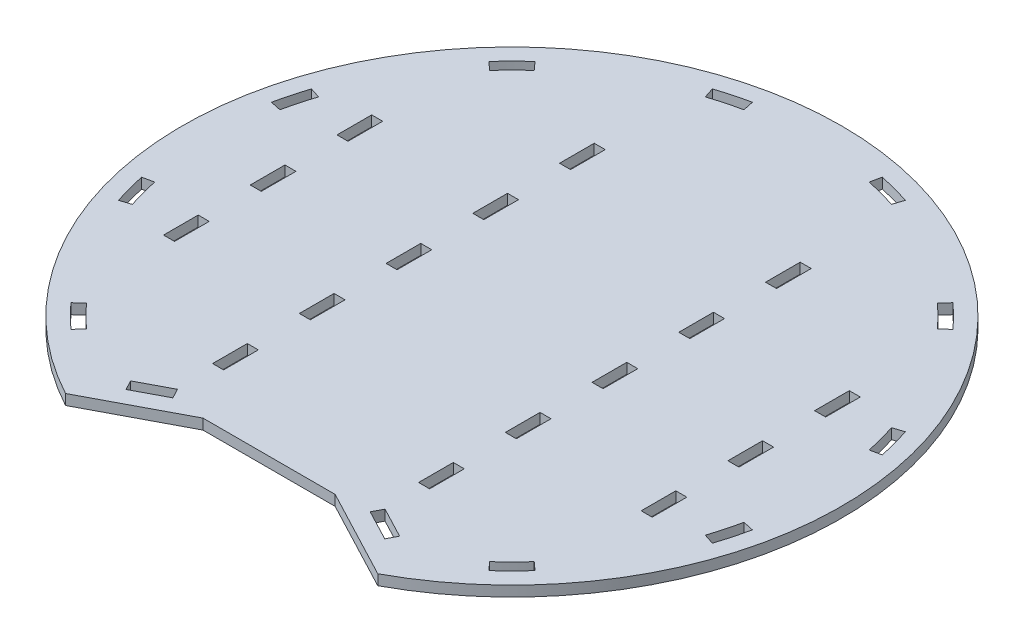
ISO-10303-21;
HEADER;
FILE_DESCRIPTION(('STEP AP214'),'2;1');
FILE_NAME('part.step','',(''),(''),'','','');
FILE_SCHEMA(('AUTOMOTIVE_DESIGN { 1 0 10303 214 1 1 1 1 }'));
ENDSEC;
DATA;
#1=APPLICATION_CONTEXT('core data for automotive mechanical design processes');
#2=APPLICATION_PROTOCOL_DEFINITION('international standard','automotive_design',2000,#1);
#3=PRODUCT_CONTEXT('',#1,'mechanical');
#4=PRODUCT('Part','Part','',(#3));
#5=PRODUCT_RELATED_PRODUCT_CATEGORY('part','',(#4));
#6=PRODUCT_DEFINITION_FORMATION('','',#4);
#7=PRODUCT_DEFINITION_CONTEXT('part definition',#1,'design');
#8=PRODUCT_DEFINITION('design','',#6,#7);
#9=PRODUCT_DEFINITION_SHAPE('','',#8);
#10=(LENGTH_UNIT() NAMED_UNIT(*) SI_UNIT(.MILLI.,.METRE.));
#11=(NAMED_UNIT(*) PLANE_ANGLE_UNIT() SI_UNIT($,.RADIAN.));
#12=(NAMED_UNIT(*) SI_UNIT($,.STERADIAN.) SOLID_ANGLE_UNIT());
#13=UNCERTAINTY_MEASURE_WITH_UNIT(LENGTH_MEASURE(1.E-05),#10,'distance_accuracy_value','');
#14=(GEOMETRIC_REPRESENTATION_CONTEXT(3) GLOBAL_UNCERTAINTY_ASSIGNED_CONTEXT((#13)) GLOBAL_UNIT_ASSIGNED_CONTEXT((#10,
#11,#12)) REPRESENTATION_CONTEXT('',''));
#15=CARTESIAN_POINT('',(0.,0.,0.));
#16=DIRECTION('',(0.,0.,1.));
#17=DIRECTION('',(1.,0.,0.));
#18=AXIS2_PLACEMENT_3D('',#15,#16,#17);
#19=CARTESIAN_POINT('',(0.,6.,0.));
#20=DIRECTION('',(-0.669130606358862,0.,-0.743144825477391));
#21=DIRECTION('',(-0.743144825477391,0.,0.669130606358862));
#22=AXIS2_PLACEMENT_3D('',#19,#20,#21);
#23=PLANE('',#22);
#24=DIRECTION('',(0.743144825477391,0.,-0.669130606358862));
#25=VECTOR('',#24,1.);
#26=CARTESIAN_POINT('',(0.,0.,0.));
#27=LINE('',#26,#25);
#28=CARTESIAN_POINT('',(129.047098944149,0.,-116.194529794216));
#29=VERTEX_POINT('',#28);
#30=CARTESIAN_POINT('',(133.766068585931,0.,-120.443509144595));
#31=VERTEX_POINT('',#30);
#32=EDGE_CURVE('E1117',#29,#31,#27,.T.);
#33=ORIENTED_EDGE('',*,*,#32,.F.);
#34=DIRECTION('',(0.,-1.,0.));
#35=VECTOR('',#34,1.);
#36=CARTESIAN_POINT('',(129.047098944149,6.,-116.194529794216));
#37=LINE('',#36,#35);
#38=CARTESIAN_POINT('',(129.047098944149,6.,-116.194529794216));
#39=VERTEX_POINT('',#38);
#40=EDGE_CURVE('E11',#39,#29,#37,.T.);
#41=ORIENTED_EDGE('',*,*,#40,.F.);
#42=DIRECTION('',(0.743144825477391,0.,-0.669130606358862));
#43=VECTOR('',#42,1.);
#44=CARTESIAN_POINT('',(0.,6.,0.));
#45=LINE('',#44,#43);
#46=CARTESIAN_POINT('',(133.766068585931,6.,-120.443509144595));
#47=VERTEX_POINT('',#46);
#48=EDGE_CURVE('E767',#39,#47,#45,.T.);
#49=ORIENTED_EDGE('',*,*,#48,.T.);
#50=DIRECTION('',(0.,-1.,0.));
#51=VECTOR('',#50,1.);
#52=CARTESIAN_POINT('',(133.766068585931,6.,-120.443509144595));
#53=LINE('',#52,#51);
#54=EDGE_CURVE('E59',#47,#31,#53,.T.);
#55=ORIENTED_EDGE('',*,*,#54,.T.);
#56=EDGE_LOOP('',(#33,#41,#49,#55));
#57=FACE_BOUND('',#56,.T.);
#58=ADVANCED_FACE('F40',(#57),#23,.T.);
#59=CARTESIAN_POINT('',(0.,6.,0.));
#60=DIRECTION('',(0.,-1.,0.));
#61=DIRECTION('',(0.,0.,-1.));
#62=AXIS2_PLACEMENT_3D('',#59,#60,#61);
#63=CYLINDRICAL_SURFACE('',#62,173.65);
#64=CARTESIAN_POINT('',(0.,0.,0.));
#65=DIRECTION('',(0.,1.,0.));
#66=DIRECTION('',(0.,0.,1.));
#67=AXIS2_PLACEMENT_3D('',#64,#65,#66);
#68=CIRCLE('',#67,173.65);
#69=CARTESIAN_POINT('',(116.194529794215,0.,-129.04709894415));
#70=VERTEX_POINT('',#69);
#71=EDGE_CURVE('E773',#29,#70,#68,.T.);
#72=ORIENTED_EDGE('',*,*,#71,.T.);
#73=DIRECTION('',(0.,-1.,0.));
#74=VECTOR('',#73,1.);
#75=CARTESIAN_POINT('',(116.194529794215,6.,-129.04709894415));
#76=LINE('',#75,#74);
#77=CARTESIAN_POINT('',(116.194529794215,6.,-129.04709894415));
#78=VERTEX_POINT('',#77);
#79=EDGE_CURVE('E50',#78,#70,#76,.T.);
#80=ORIENTED_EDGE('',*,*,#79,.F.);
#81=CARTESIAN_POINT('',(0.,6.,0.));
#82=DIRECTION('',(0.,1.,0.));
#83=DIRECTION('',(0.,0.,1.));
#84=AXIS2_PLACEMENT_3D('',#81,#82,#83);
#85=CIRCLE('',#84,173.65);
#86=EDGE_CURVE('E761',#39,#78,#85,.T.);
#87=ORIENTED_EDGE('',*,*,#86,.F.);
#88=ORIENTED_EDGE('',*,*,#40,.T.);
#89=EDGE_LOOP('',(#72,#80,#87,#88));
#90=FACE_BOUND('',#89,.T.);
#91=ADVANCED_FACE('F771',(#90),#63,.T.);
#92=CARTESIAN_POINT('',(-9.28188557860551E-13,6.,-8.35744731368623E-13));
#93=DIRECTION('',(0.743144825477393,0.,0.66913060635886));
#94=DIRECTION('',(0.66913060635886,0.,-0.743144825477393));
#95=AXIS2_PLACEMENT_3D('',#92,#93,#94);
#96=PLANE('',#95);
#97=DIRECTION('',(-0.66913060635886,0.,0.743144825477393));
#98=VECTOR('',#97,1.);
#99=CARTESIAN_POINT('',(-9.28188557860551E-13,0.,-8.35744731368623E-13));
#100=LINE('',#99,#98);
#101=CARTESIAN_POINT('',(120.443509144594,0.,-133.766068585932));
#102=VERTEX_POINT('',#101);
#103=EDGE_CURVE('E1120',#102,#70,#100,.T.);
#104=ORIENTED_EDGE('',*,*,#103,.F.);
#105=DIRECTION('',(0.,-1.,0.));
#106=VECTOR('',#105,1.);
#107=CARTESIAN_POINT('',(120.443509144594,6.,-133.766068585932));
#108=LINE('',#107,#106);
#109=CARTESIAN_POINT('',(120.443509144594,6.,-133.766068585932));
#110=VERTEX_POINT('',#109);
#111=EDGE_CURVE('E408',#110,#102,#108,.T.);
#112=ORIENTED_EDGE('',*,*,#111,.F.);
#113=DIRECTION('',(-0.66913060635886,0.,0.743144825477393));
#114=VECTOR('',#113,1.);
#115=CARTESIAN_POINT('',(-9.28188557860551E-13,6.,-8.35744731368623E-13));
#116=LINE('',#115,#114);
#117=EDGE_CURVE('E766',#110,#78,#116,.T.);
#118=ORIENTED_EDGE('',*,*,#117,.T.);
#119=ORIENTED_EDGE('',*,*,#79,.T.);
#120=EDGE_LOOP('',(#104,#112,#118,#119));
#121=FACE_BOUND('',#120,.T.);
#122=ADVANCED_FACE('F777',(#121),#96,.T.);
#123=CARTESIAN_POINT('',(0.,6.,2.17192397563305E-13));
#124=DIRECTION('',(-0.207911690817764,0.,-0.978147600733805));
#125=DIRECTION('',(-0.978147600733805,0.,0.207911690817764));
#126=AXIS2_PLACEMENT_3D('',#123,#124,#125);
#127=PLANE('',#126);
#128=DIRECTION('',(0.978147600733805,0.,-0.207911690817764));
#129=VECTOR('',#128,1.);
#130=CARTESIAN_POINT('',(0.,0.,2.17192397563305E-13));
#131=LINE('',#130,#129);
#132=CARTESIAN_POINT('',(169.855330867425,0.,-36.1038651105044));
#133=VERTEX_POINT('',#132);
#134=CARTESIAN_POINT('',(176.066568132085,0.,-37.4241043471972));
#135=VERTEX_POINT('',#134);
#136=EDGE_CURVE('E1105',#133,#135,#131,.T.);
#137=ORIENTED_EDGE('',*,*,#136,.F.);
#138=DIRECTION('',(0.,-1.,0.));
#139=VECTOR('',#138,1.);
#140=CARTESIAN_POINT('',(169.855330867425,6.,-36.1038651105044));
#141=LINE('',#140,#139);
#142=CARTESIAN_POINT('',(169.855330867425,6.,-36.1038651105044));
#143=VERTEX_POINT('',#142);
#144=EDGE_CURVE('E1127',#143,#133,#141,.T.);
#145=ORIENTED_EDGE('',*,*,#144,.F.);
#146=DIRECTION('',(0.978147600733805,0.,-0.207911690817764));
#147=VECTOR('',#146,1.);
#148=CARTESIAN_POINT('',(0.,6.,2.17192397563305E-13));
#149=LINE('',#148,#147);
#150=CARTESIAN_POINT('',(176.066568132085,6.,-37.4241043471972));
#151=VERTEX_POINT('',#150);
#152=EDGE_CURVE('E1690',#143,#151,#149,.T.);
#153=ORIENTED_EDGE('',*,*,#152,.T.);
#154=DIRECTION('',(0.,-1.,0.));
#155=VECTOR('',#154,1.);
#156=CARTESIAN_POINT('',(176.066568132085,6.,-37.4241043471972));
#157=LINE('',#156,#155);
#158=EDGE_CURVE('E1129',#151,#135,#157,.T.);
#159=ORIENTED_EDGE('',*,*,#158,.T.);
#160=EDGE_LOOP('',(#137,#145,#153,#159));
#161=FACE_BOUND('',#160,.T.);
#162=ADVANCED_FACE('F1732',(#161),#127,.T.);
#163=CARTESIAN_POINT('',(0.,6.,0.));
#164=DIRECTION('',(0.,-1.,0.));
#165=DIRECTION('',(0.,0.,-1.));
#166=AXIS2_PLACEMENT_3D('',#163,#164,#165);
#167=CYLINDRICAL_SURFACE('',#166,173.65);
#168=CARTESIAN_POINT('',(0.,0.,0.));
#169=DIRECTION('',(0.,1.,0.));
#170=DIRECTION('',(0.,0.,1.));
#171=AXIS2_PLACEMENT_3D('',#168,#169,#170);
#172=CIRCLE('',#171,173.65);
#173=CARTESIAN_POINT('',(165.150964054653,0.,-53.6608010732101));
#174=VERTEX_POINT('',#173);
#175=EDGE_CURVE('E1108',#133,#174,#172,.T.);
#176=ORIENTED_EDGE('',*,*,#175,.T.);
#177=DIRECTION('',(0.,-1.,0.));
#178=VECTOR('',#177,1.);
#179=CARTESIAN_POINT('',(165.150964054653,6.,-53.6608010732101));
#180=LINE('',#179,#178);
#181=CARTESIAN_POINT('',(165.150964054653,6.,-53.6608010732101));
#182=VERTEX_POINT('',#181);
#183=EDGE_CURVE('E1134',#182,#174,#180,.T.);
#184=ORIENTED_EDGE('',*,*,#183,.F.);
#185=CARTESIAN_POINT('',(0.,6.,0.));
#186=DIRECTION('',(0.,1.,0.));
#187=DIRECTION('',(0.,0.,1.));
#188=AXIS2_PLACEMENT_3D('',#185,#186,#187);
#189=CIRCLE('',#188,173.65);
#190=EDGE_CURVE('E1693',#143,#182,#189,.T.);
#191=ORIENTED_EDGE('',*,*,#190,.F.);
#192=ORIENTED_EDGE('',*,*,#144,.T.);
#193=EDGE_LOOP('',(#176,#184,#191,#192));
#194=FACE_BOUND('',#193,.T.);
#195=ADVANCED_FACE('F1728',(#194),#167,.T.);
#196=CARTESIAN_POINT('',(2.74891072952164E-12,6.,8.46027729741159E-12));
#197=DIRECTION('',(0.309016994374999,0.,0.951056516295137));
#198=DIRECTION('',(0.951056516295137,0.,-0.309016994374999));
#199=AXIS2_PLACEMENT_3D('',#196,#197,#198);
#200=PLANE('',#199);
#201=DIRECTION('',(-0.951056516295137,0.,0.309016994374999));
#202=VECTOR('',#201,1.);
#203=CARTESIAN_POINT('',(2.74891072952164E-12,0.,8.46027729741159E-12));
#204=LINE('',#203,#202);
#205=CARTESIAN_POINT('',(171.190172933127,0.,-55.6230589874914));
#206=VERTEX_POINT('',#205);
#207=EDGE_CURVE('E1111',#206,#174,#204,.T.);
#208=ORIENTED_EDGE('',*,*,#207,.F.);
#209=DIRECTION('',(0.,-1.,0.));
#210=VECTOR('',#209,1.);
#211=CARTESIAN_POINT('',(171.190172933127,6.,-55.6230589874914));
#212=LINE('',#211,#210);
#213=CARTESIAN_POINT('',(171.190172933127,6.,-55.6230589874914));
#214=VERTEX_POINT('',#213);
#215=EDGE_CURVE('E1131',#214,#206,#212,.T.);
#216=ORIENTED_EDGE('',*,*,#215,.F.);
#217=DIRECTION('',(-0.951056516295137,0.,0.309016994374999));
#218=VECTOR('',#217,1.);
#219=CARTESIAN_POINT('',(2.74891072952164E-12,6.,8.46027729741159E-12));
#220=LINE('',#219,#218);
#221=EDGE_CURVE('E1695',#214,#182,#220,.T.);
#222=ORIENTED_EDGE('',*,*,#221,.T.);
#223=ORIENTED_EDGE('',*,*,#183,.T.);
#224=EDGE_LOOP('',(#208,#216,#222,#223));
#225=FACE_BOUND('',#224,.T.);
#226=ADVANCED_FACE('F1724',(#225),#200,.T.);
#227=CARTESIAN_POINT('',(-3.50649010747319E-13,6.,3.15725787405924E-13));
#228=DIRECTION('',(0.743144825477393,0.,-0.66913060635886));
#229=DIRECTION('',(-0.66913060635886,0.,-0.743144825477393));
#230=AXIS2_PLACEMENT_3D('',#227,#228,#229);
#231=PLANE('',#230);
#232=DIRECTION('',(0.66913060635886,0.,0.743144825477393));
#233=VECTOR('',#232,1.);
#234=CARTESIAN_POINT('',(-3.50649010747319E-13,0.,3.15725787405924E-13));
#235=LINE('',#234,#233);
#236=CARTESIAN_POINT('',(116.194529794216,0.,129.04709894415));
#237=VERTEX_POINT('',#236);
#238=CARTESIAN_POINT('',(120.443509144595,0.,133.766068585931));
#239=VERTEX_POINT('',#238);
#240=EDGE_CURVE('E1093',#237,#239,#235,.T.);
#241=ORIENTED_EDGE('',*,*,#240,.F.);
#242=DIRECTION('',(0.,-1.,0.));
#243=VECTOR('',#242,1.);
#244=CARTESIAN_POINT('',(116.194529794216,6.,129.04709894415));
#245=LINE('',#244,#243);
#246=CARTESIAN_POINT('',(116.194529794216,6.,129.04709894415));
#247=VERTEX_POINT('',#246);
#248=EDGE_CURVE('E1132',#247,#237,#245,.T.);
#249=ORIENTED_EDGE('',*,*,#248,.F.);
#250=DIRECTION('',(0.66913060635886,0.,0.743144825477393));
#251=VECTOR('',#250,1.);
#252=CARTESIAN_POINT('',(-3.50649010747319E-13,6.,3.15725787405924E-13));
#253=LINE('',#252,#251);
#254=CARTESIAN_POINT('',(120.443509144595,6.,133.766068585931));
#255=VERTEX_POINT('',#254);
#256=EDGE_CURVE('E1679',#247,#255,#253,.T.);
#257=ORIENTED_EDGE('',*,*,#256,.T.);
#258=DIRECTION('',(0.,-1.,0.));
#259=VECTOR('',#258,1.);
#260=CARTESIAN_POINT('',(120.443509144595,6.,133.766068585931));
#261=LINE('',#260,#259);
#262=EDGE_CURVE('E1137',#255,#239,#261,.T.);
#263=ORIENTED_EDGE('',*,*,#262,.T.);
#264=EDGE_LOOP('',(#241,#249,#257,#263));
#265=FACE_BOUND('',#264,.T.);
#266=ADVANCED_FACE('F1727',(#265),#231,.T.);
#267=CARTESIAN_POINT('',(0.,6.,0.));
#268=DIRECTION('',(0.,-1.,0.));
#269=DIRECTION('',(0.,0.,-1.));
#270=AXIS2_PLACEMENT_3D('',#267,#268,#269);
#271=CYLINDRICAL_SURFACE('',#270,173.65);
#272=CARTESIAN_POINT('',(0.,0.,0.));
#273=DIRECTION('',(0.,1.,0.));
#274=DIRECTION('',(0.,0.,1.));
#275=AXIS2_PLACEMENT_3D('',#272,#273,#274);
#276=CIRCLE('',#275,173.65);
#277=CARTESIAN_POINT('',(129.047098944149,0.,116.194529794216));
#278=VERTEX_POINT('',#277);
#279=EDGE_CURVE('E1096',#237,#278,#276,.T.);
#280=ORIENTED_EDGE('',*,*,#279,.T.);
#281=DIRECTION('',(0.,-1.,0.));
#282=VECTOR('',#281,1.);
#283=CARTESIAN_POINT('',(129.047098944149,6.,116.194529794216));
#284=LINE('',#283,#282);
#285=CARTESIAN_POINT('',(129.047098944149,6.,116.194529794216));
#286=VERTEX_POINT('',#285);
#287=EDGE_CURVE('E1142',#286,#278,#284,.T.);
#288=ORIENTED_EDGE('',*,*,#287,.F.);
#289=CARTESIAN_POINT('',(0.,6.,0.));
#290=DIRECTION('',(0.,1.,0.));
#291=DIRECTION('',(0.,0.,1.));
#292=AXIS2_PLACEMENT_3D('',#289,#290,#291);
#293=CIRCLE('',#292,173.65);
#294=EDGE_CURVE('E1682',#247,#286,#293,.T.);
#295=ORIENTED_EDGE('',*,*,#294,.F.);
#296=ORIENTED_EDGE('',*,*,#248,.T.);
#297=EDGE_LOOP('',(#280,#288,#295,#296));
#298=FACE_BOUND('',#297,.T.);
#299=ADVANCED_FACE('F1745',(#298),#271,.T.);
#300=CARTESIAN_POINT('',(-5.55305943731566E-12,6.,6.16729730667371E-12));
#301=DIRECTION('',(-0.669130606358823,0.,0.743144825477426));
#302=DIRECTION('',(0.743144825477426,0.,0.669130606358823));
#303=AXIS2_PLACEMENT_3D('',#300,#301,#302);
#304=PLANE('',#303);
#305=DIRECTION('',(-0.743144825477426,0.,-0.669130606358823));
#306=VECTOR('',#305,1.);
#307=CARTESIAN_POINT('',(-5.55305943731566E-12,0.,6.16729730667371E-12));
#308=LINE('',#307,#306);
#309=CARTESIAN_POINT('',(133.766068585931,0.,120.443509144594));
#310=VERTEX_POINT('',#309);
#311=EDGE_CURVE('E1099',#310,#278,#308,.T.);
#312=ORIENTED_EDGE('',*,*,#311,.F.);
#313=DIRECTION('',(0.,-1.,0.));
#314=VECTOR('',#313,1.);
#315=CARTESIAN_POINT('',(133.766068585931,6.,120.443509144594));
#316=LINE('',#315,#314);
#317=CARTESIAN_POINT('',(133.766068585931,6.,120.443509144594));
#318=VERTEX_POINT('',#317);
#319=EDGE_CURVE('E1139',#318,#310,#316,.T.);
#320=ORIENTED_EDGE('',*,*,#319,.F.);
#321=DIRECTION('',(-0.743144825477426,0.,-0.669130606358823));
#322=VECTOR('',#321,1.);
#323=CARTESIAN_POINT('',(-5.55305943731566E-12,6.,6.16729730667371E-12));
#324=LINE('',#323,#322);
#325=EDGE_CURVE('E1684',#318,#286,#324,.T.);
#326=ORIENTED_EDGE('',*,*,#325,.T.);
#327=ORIENTED_EDGE('',*,*,#287,.T.);
#328=EDGE_LOOP('',(#312,#320,#326,#327));
#329=FACE_BOUND('',#328,.T.);
#330=ADVANCED_FACE('F1741',(#329),#304,.T.);
#331=CARTESIAN_POINT('',(62.5533280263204,6.,0.));
#332=DIRECTION('',(-1.,0.,0.));
#333=DIRECTION('',(0.,0.,1.));
#334=AXIS2_PLACEMENT_3D('',#331,#332,#333);
#335=PLANE('',#334);
#336=DIRECTION('',(0.,0.,-1.));
#337=VECTOR('',#336,1.);
#338=CARTESIAN_POINT('',(62.5533280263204,0.,0.));
#339=LINE('',#338,#337);
#340=CARTESIAN_POINT('',(62.5533280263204,0.,-40.));
#341=VERTEX_POINT('',#340);
#342=CARTESIAN_POINT('',(62.5533280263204,0.,-60.));
#343=VERTEX_POINT('',#342);
#344=EDGE_CURVE('E1081',#341,#343,#339,.T.);
#345=ORIENTED_EDGE('',*,*,#344,.F.);
#346=DIRECTION('',(0.,-1.,0.));
#347=VECTOR('',#346,1.);
#348=CARTESIAN_POINT('',(62.5533280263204,6.,-40.));
#349=LINE('',#348,#347);
#350=CARTESIAN_POINT('',(62.5533280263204,6.,-40.));
#351=VERTEX_POINT('',#350);
#352=EDGE_CURVE('E1140',#351,#341,#349,.T.);
#353=ORIENTED_EDGE('',*,*,#352,.F.);
#354=DIRECTION('',(0.,0.,-1.));
#355=VECTOR('',#354,1.);
#356=CARTESIAN_POINT('',(62.5533280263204,6.,0.));
#357=LINE('',#356,#355);
#358=CARTESIAN_POINT('',(62.5533280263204,6.,-60.));
#359=VERTEX_POINT('',#358);
#360=EDGE_CURVE('E1668',#351,#359,#357,.T.);
#361=ORIENTED_EDGE('',*,*,#360,.T.);
#362=DIRECTION('',(0.,-1.,0.));
#363=VECTOR('',#362,1.);
#364=CARTESIAN_POINT('',(62.5533280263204,6.,-60.));
#365=LINE('',#364,#363);
#366=EDGE_CURVE('E1145',#359,#343,#365,.T.);
#367=ORIENTED_EDGE('',*,*,#366,.T.);
#368=EDGE_LOOP('',(#345,#353,#361,#367));
#369=FACE_BOUND('',#368,.T.);
#370=ADVANCED_FACE('F1744',(#369),#335,.T.);
#371=CARTESIAN_POINT('',(0.,6.,-40.));
#372=DIRECTION('',(0.,0.,1.));
#373=DIRECTION('',(1.,0.,0.));
#374=AXIS2_PLACEMENT_3D('',#371,#372,#373);
#375=PLANE('',#374);
#376=DIRECTION('',(-1.,0.,0.));
#377=VECTOR('',#376,1.);
#378=CARTESIAN_POINT('',(0.,0.,-40.));
#379=LINE('',#378,#377);
#380=CARTESIAN_POINT('',(56.2033280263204,0.,-40.));
#381=VERTEX_POINT('',#380);
#382=EDGE_CURVE('E1084',#341,#381,#379,.T.);
#383=ORIENTED_EDGE('',*,*,#382,.T.);
#384=DIRECTION('',(0.,-1.,0.));
#385=VECTOR('',#384,1.);
#386=CARTESIAN_POINT('',(56.2033280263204,6.,-40.));
#387=LINE('',#386,#385);
#388=CARTESIAN_POINT('',(56.2033280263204,6.,-40.));
#389=VERTEX_POINT('',#388);
#390=EDGE_CURVE('E1150',#389,#381,#387,.T.);
#391=ORIENTED_EDGE('',*,*,#390,.F.);
#392=DIRECTION('',(-1.,0.,0.));
#393=VECTOR('',#392,1.);
#394=CARTESIAN_POINT('',(0.,6.,-40.));
#395=LINE('',#394,#393);
#396=EDGE_CURVE('E1671',#351,#389,#395,.T.);
#397=ORIENTED_EDGE('',*,*,#396,.F.);
#398=ORIENTED_EDGE('',*,*,#352,.T.);
#399=EDGE_LOOP('',(#383,#391,#397,#398));
#400=FACE_BOUND('',#399,.T.);
#401=ADVANCED_FACE('F1761',(#400),#375,.F.);
#402=CARTESIAN_POINT('',(56.2033280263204,6.,0.));
#403=DIRECTION('',(-1.,0.,0.));
#404=DIRECTION('',(0.,0.,1.));
#405=AXIS2_PLACEMENT_3D('',#402,#403,#404);
#406=PLANE('',#405);
#407=DIRECTION('',(0.,0.,-1.));
#408=VECTOR('',#407,1.);
#409=CARTESIAN_POINT('',(56.2033280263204,0.,0.));
#410=LINE('',#409,#408);
#411=CARTESIAN_POINT('',(56.2033280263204,0.,-60.));
#412=VERTEX_POINT('',#411);
#413=EDGE_CURVE('E1087',#381,#412,#410,.T.);
#414=ORIENTED_EDGE('',*,*,#413,.T.);
#415=DIRECTION('',(0.,-1.,0.));
#416=VECTOR('',#415,1.);
#417=CARTESIAN_POINT('',(56.2033280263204,6.,-60.));
#418=LINE('',#417,#416);
#419=CARTESIAN_POINT('',(56.2033280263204,6.,-60.));
#420=VERTEX_POINT('',#419);
#421=EDGE_CURVE('E1147',#420,#412,#418,.T.);
#422=ORIENTED_EDGE('',*,*,#421,.F.);
#423=DIRECTION('',(0.,0.,-1.));
#424=VECTOR('',#423,1.);
#425=CARTESIAN_POINT('',(56.2033280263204,6.,0.));
#426=LINE('',#425,#424);
#427=EDGE_CURVE('E1674',#389,#420,#426,.T.);
#428=ORIENTED_EDGE('',*,*,#427,.F.);
#429=ORIENTED_EDGE('',*,*,#390,.T.);
#430=EDGE_LOOP('',(#414,#422,#428,#429));
#431=FACE_BOUND('',#430,.T.);
#432=ADVANCED_FACE('F1757',(#431),#406,.F.);
#433=CARTESIAN_POINT('',(56.2033280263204,6.,0.));
#434=DIRECTION('',(1.,0.,0.));
#435=DIRECTION('',(0.,0.,-1.));
#436=AXIS2_PLACEMENT_3D('',#433,#434,#435);
#437=PLANE('',#436);
#438=DIRECTION('',(0.,0.,1.));
#439=VECTOR('',#438,1.);
#440=CARTESIAN_POINT('',(56.2033280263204,0.,0.));
#441=LINE('',#440,#439);
#442=CARTESIAN_POINT('',(56.2033280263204,0.,-10.));
#443=VERTEX_POINT('',#442);
#444=CARTESIAN_POINT('',(56.2033280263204,0.,10.));
#445=VERTEX_POINT('',#444);
#446=EDGE_CURVE('E1069',#443,#445,#441,.T.);
#447=ORIENTED_EDGE('',*,*,#446,.F.);
#448=DIRECTION('',(0.,-1.,0.));
#449=VECTOR('',#448,1.);
#450=CARTESIAN_POINT('',(56.2033280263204,6.,-10.));
#451=LINE('',#450,#449);
#452=CARTESIAN_POINT('',(56.2033280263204,6.,-10.));
#453=VERTEX_POINT('',#452);
#454=EDGE_CURVE('E1148',#453,#443,#451,.T.);
#455=ORIENTED_EDGE('',*,*,#454,.F.);
#456=DIRECTION('',(0.,0.,1.));
#457=VECTOR('',#456,1.);
#458=CARTESIAN_POINT('',(56.2033280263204,6.,0.));
#459=LINE('',#458,#457);
#460=CARTESIAN_POINT('',(56.2033280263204,6.,10.));
#461=VERTEX_POINT('',#460);
#462=EDGE_CURVE('E1657',#453,#461,#459,.T.);
#463=ORIENTED_EDGE('',*,*,#462,.T.);
#464=DIRECTION('',(0.,-1.,0.));
#465=VECTOR('',#464,1.);
#466=CARTESIAN_POINT('',(56.2033280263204,6.,10.));
#467=LINE('',#466,#465);
#468=EDGE_CURVE('E1154',#461,#445,#467,.T.);
#469=ORIENTED_EDGE('',*,*,#468,.T.);
#470=EDGE_LOOP('',(#447,#455,#463,#469));
#471=FACE_BOUND('',#470,.T.);
#472=ADVANCED_FACE('F1760',(#471),#437,.T.);
#473=CARTESIAN_POINT('',(0.,6.,-9.99999999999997));
#474=DIRECTION('',(0.,0.,-1.));
#475=DIRECTION('',(-1.,0.,0.));
#476=AXIS2_PLACEMENT_3D('',#473,#474,#475);
#477=PLANE('',#476);
#478=DIRECTION('',(1.,0.,0.));
#479=VECTOR('',#478,1.);
#480=CARTESIAN_POINT('',(0.,0.,-9.99999999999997));
#481=LINE('',#480,#479);
#482=CARTESIAN_POINT('',(62.5533280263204,0.,-10.));
#483=VERTEX_POINT('',#482);
#484=EDGE_CURVE('E1072',#443,#483,#481,.T.);
#485=ORIENTED_EDGE('',*,*,#484,.T.);
#486=DIRECTION('',(0.,-1.,0.));
#487=VECTOR('',#486,1.);
#488=CARTESIAN_POINT('',(62.5533280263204,6.,-10.));
#489=LINE('',#488,#487);
#490=CARTESIAN_POINT('',(62.5533280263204,6.,-10.));
#491=VERTEX_POINT('',#490);
#492=EDGE_CURVE('E1159',#491,#483,#489,.T.);
#493=ORIENTED_EDGE('',*,*,#492,.F.);
#494=DIRECTION('',(1.,0.,0.));
#495=VECTOR('',#494,1.);
#496=CARTESIAN_POINT('',(0.,6.,-9.99999999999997));
#497=LINE('',#496,#495);
#498=EDGE_CURVE('E1660',#453,#491,#497,.T.);
#499=ORIENTED_EDGE('',*,*,#498,.F.);
#500=ORIENTED_EDGE('',*,*,#454,.T.);
#501=EDGE_LOOP('',(#485,#493,#499,#500));
#502=FACE_BOUND('',#501,.T.);
#503=ADVANCED_FACE('F1777',(#502),#477,.F.);
#504=CARTESIAN_POINT('',(62.5533280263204,6.,0.));
#505=DIRECTION('',(1.,0.,0.));
#506=DIRECTION('',(0.,0.,-1.));
#507=AXIS2_PLACEMENT_3D('',#504,#505,#506);
#508=PLANE('',#507);
#509=DIRECTION('',(0.,0.,1.));
#510=VECTOR('',#509,1.);
#511=CARTESIAN_POINT('',(62.5533280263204,0.,0.));
#512=LINE('',#511,#510);
#513=CARTESIAN_POINT('',(62.5533280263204,0.,9.99999999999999));
#514=VERTEX_POINT('',#513);
#515=EDGE_CURVE('E1075',#483,#514,#512,.T.);
#516=ORIENTED_EDGE('',*,*,#515,.T.);
#517=DIRECTION('',(0.,-1.,0.));
#518=VECTOR('',#517,1.);
#519=CARTESIAN_POINT('',(62.5533280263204,6.,9.99999999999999));
#520=LINE('',#519,#518);
#521=CARTESIAN_POINT('',(62.5533280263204,6.,9.99999999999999));
#522=VERTEX_POINT('',#521);
#523=EDGE_CURVE('E1156',#522,#514,#520,.T.);
#524=ORIENTED_EDGE('',*,*,#523,.F.);
#525=DIRECTION('',(0.,0.,1.));
#526=VECTOR('',#525,1.);
#527=CARTESIAN_POINT('',(62.5533280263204,6.,0.));
#528=LINE('',#527,#526);
#529=EDGE_CURVE('E1663',#491,#522,#528,.T.);
#530=ORIENTED_EDGE('',*,*,#529,.F.);
#531=ORIENTED_EDGE('',*,*,#492,.T.);
#532=EDGE_LOOP('',(#516,#524,#530,#531));
#533=FACE_BOUND('',#532,.T.);
#534=ADVANCED_FACE('F1773',(#533),#508,.F.);
#535=CARTESIAN_POINT('',(62.5533280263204,6.,0.));
#536=DIRECTION('',(-1.,0.,0.));
#537=DIRECTION('',(0.,0.,1.));
#538=AXIS2_PLACEMENT_3D('',#535,#536,#537);
#539=PLANE('',#538);
#540=DIRECTION('',(0.,0.,-1.));
#541=VECTOR('',#540,1.);
#542=CARTESIAN_POINT('',(62.5533280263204,0.,0.));
#543=LINE('',#542,#541);
#544=CARTESIAN_POINT('',(62.5533280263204,0.,-90.));
#545=VERTEX_POINT('',#544);
#546=CARTESIAN_POINT('',(62.5533280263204,0.,-110.));
#547=VERTEX_POINT('',#546);
#548=EDGE_CURVE('E1057',#545,#547,#543,.T.);
#549=ORIENTED_EDGE('',*,*,#548,.F.);
#550=DIRECTION('',(0.,-1.,0.));
#551=VECTOR('',#550,1.);
#552=CARTESIAN_POINT('',(62.5533280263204,6.,-90.));
#553=LINE('',#552,#551);
#554=CARTESIAN_POINT('',(62.5533280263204,6.,-90.));
#555=VERTEX_POINT('',#554);
#556=EDGE_CURVE('E1157',#555,#545,#553,.T.);
#557=ORIENTED_EDGE('',*,*,#556,.F.);
#558=DIRECTION('',(0.,0.,-1.));
#559=VECTOR('',#558,1.);
#560=CARTESIAN_POINT('',(62.5533280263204,6.,0.));
#561=LINE('',#560,#559);
#562=CARTESIAN_POINT('',(62.5533280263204,6.,-110.));
#563=VERTEX_POINT('',#562);
#564=EDGE_CURVE('E1646',#555,#563,#561,.T.);
#565=ORIENTED_EDGE('',*,*,#564,.T.);
#566=DIRECTION('',(0.,-1.,0.));
#567=VECTOR('',#566,1.);
#568=CARTESIAN_POINT('',(62.5533280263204,6.,-110.));
#569=LINE('',#568,#567);
#570=EDGE_CURVE('E1163',#563,#547,#569,.T.);
#571=ORIENTED_EDGE('',*,*,#570,.T.);
#572=EDGE_LOOP('',(#549,#557,#565,#571));
#573=FACE_BOUND('',#572,.T.);
#574=ADVANCED_FACE('F1776',(#573),#539,.T.);
#575=CARTESIAN_POINT('',(0.,6.,-90.));
#576=DIRECTION('',(0.,0.,1.));
#577=DIRECTION('',(1.,0.,0.));
#578=AXIS2_PLACEMENT_3D('',#575,#576,#577);
#579=PLANE('',#578);
#580=DIRECTION('',(-1.,0.,0.));
#581=VECTOR('',#580,1.);
#582=CARTESIAN_POINT('',(0.,0.,-90.));
#583=LINE('',#582,#581);
#584=CARTESIAN_POINT('',(56.2033280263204,0.,-90.));
#585=VERTEX_POINT('',#584);
#586=EDGE_CURVE('E1060',#545,#585,#583,.T.);
#587=ORIENTED_EDGE('',*,*,#586,.T.);
#588=DIRECTION('',(0.,-1.,0.));
#589=VECTOR('',#588,1.);
#590=CARTESIAN_POINT('',(56.2033280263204,6.,-90.));
#591=LINE('',#590,#589);
#592=CARTESIAN_POINT('',(56.2033280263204,6.,-90.));
#593=VERTEX_POINT('',#592);
#594=EDGE_CURVE('E1168',#593,#585,#591,.T.);
#595=ORIENTED_EDGE('',*,*,#594,.F.);
#596=DIRECTION('',(-1.,0.,0.));
#597=VECTOR('',#596,1.);
#598=CARTESIAN_POINT('',(0.,6.,-90.));
#599=LINE('',#598,#597);
#600=EDGE_CURVE('E1649',#555,#593,#599,.T.);
#601=ORIENTED_EDGE('',*,*,#600,.F.);
#602=ORIENTED_EDGE('',*,*,#556,.T.);
#603=EDGE_LOOP('',(#587,#595,#601,#602));
#604=FACE_BOUND('',#603,.T.);
#605=ADVANCED_FACE('F1793',(#604),#579,.F.);
#606=CARTESIAN_POINT('',(56.2033280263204,6.,0.));
#607=DIRECTION('',(-1.,0.,0.));
#608=DIRECTION('',(0.,0.,1.));
#609=AXIS2_PLACEMENT_3D('',#606,#607,#608);
#610=PLANE('',#609);
#611=DIRECTION('',(0.,0.,-1.));
#612=VECTOR('',#611,1.);
#613=CARTESIAN_POINT('',(56.2033280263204,0.,0.));
#614=LINE('',#613,#612);
#615=CARTESIAN_POINT('',(56.2033280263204,0.,-110.));
#616=VERTEX_POINT('',#615);
#617=EDGE_CURVE('E1063',#585,#616,#614,.T.);
#618=ORIENTED_EDGE('',*,*,#617,.T.);
#619=DIRECTION('',(0.,-1.,0.));
#620=VECTOR('',#619,1.);
#621=CARTESIAN_POINT('',(56.2033280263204,6.,-110.));
#622=LINE('',#621,#620);
#623=CARTESIAN_POINT('',(56.2033280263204,6.,-110.));
#624=VERTEX_POINT('',#623);
#625=EDGE_CURVE('E1165',#624,#616,#622,.T.);
#626=ORIENTED_EDGE('',*,*,#625,.F.);
#627=DIRECTION('',(0.,0.,-1.));
#628=VECTOR('',#627,1.);
#629=CARTESIAN_POINT('',(56.2033280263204,6.,0.));
#630=LINE('',#629,#628);
#631=EDGE_CURVE('E1652',#593,#624,#630,.T.);
#632=ORIENTED_EDGE('',*,*,#631,.F.);
#633=ORIENTED_EDGE('',*,*,#594,.T.);
#634=EDGE_LOOP('',(#618,#626,#632,#633));
#635=FACE_BOUND('',#634,.T.);
#636=ADVANCED_FACE('F1789',(#635),#610,.F.);
#637=CARTESIAN_POINT('',(0.,6.,90.));
#638=DIRECTION('',(0.,0.,1.));
#639=DIRECTION('',(1.,0.,0.));
#640=AXIS2_PLACEMENT_3D('',#637,#638,#639);
#641=PLANE('',#640);
#642=DIRECTION('',(-1.,0.,0.));
#643=VECTOR('',#642,1.);
#644=CARTESIAN_POINT('',(0.,0.,90.));
#645=LINE('',#644,#643);
#646=CARTESIAN_POINT('',(62.5533280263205,0.,90.));
#647=VERTEX_POINT('',#646);
#648=CARTESIAN_POINT('',(56.2033280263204,0.,90.));
#649=VERTEX_POINT('',#648);
#650=EDGE_CURVE('E1045',#647,#649,#645,.T.);
#651=ORIENTED_EDGE('',*,*,#650,.F.);
#652=DIRECTION('',(0.,-1.,0.));
#653=VECTOR('',#652,1.);
#654=CARTESIAN_POINT('',(62.5533280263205,6.,90.));
#655=LINE('',#654,#653);
#656=CARTESIAN_POINT('',(62.5533280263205,6.,90.));
#657=VERTEX_POINT('',#656);
#658=EDGE_CURVE('E1166',#657,#647,#655,.T.);
#659=ORIENTED_EDGE('',*,*,#658,.F.);
#660=DIRECTION('',(-1.,0.,0.));
#661=VECTOR('',#660,1.);
#662=CARTESIAN_POINT('',(0.,6.,90.));
#663=LINE('',#662,#661);
#664=CARTESIAN_POINT('',(56.2033280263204,6.,90.));
#665=VERTEX_POINT('',#664);
#666=EDGE_CURVE('E1635',#657,#665,#663,.T.);
#667=ORIENTED_EDGE('',*,*,#666,.T.);
#668=DIRECTION('',(0.,-1.,0.));
#669=VECTOR('',#668,1.);
#670=CARTESIAN_POINT('',(56.2033280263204,6.,90.));
#671=LINE('',#670,#669);
#672=EDGE_CURVE('E1172',#665,#649,#671,.T.);
#673=ORIENTED_EDGE('',*,*,#672,.T.);
#674=EDGE_LOOP('',(#651,#659,#667,#673));
#675=FACE_BOUND('',#674,.T.);
#676=ADVANCED_FACE('F1792',(#675),#641,.T.);
#677=CARTESIAN_POINT('',(62.5533280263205,6.,0.));
#678=DIRECTION('',(1.,0.,0.));
#679=DIRECTION('',(0.,0.,-1.));
#680=AXIS2_PLACEMENT_3D('',#677,#678,#679);
#681=PLANE('',#680);
#682=DIRECTION('',(0.,0.,1.));
#683=VECTOR('',#682,1.);
#684=CARTESIAN_POINT('',(62.5533280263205,0.,0.));
#685=LINE('',#684,#683);
#686=CARTESIAN_POINT('',(62.5533280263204,0.,110.));
#687=VERTEX_POINT('',#686);
#688=EDGE_CURVE('E1048',#647,#687,#685,.T.);
#689=ORIENTED_EDGE('',*,*,#688,.T.);
#690=DIRECTION('',(0.,-1.,0.));
#691=VECTOR('',#690,1.);
#692=CARTESIAN_POINT('',(62.5533280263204,6.,110.));
#693=LINE('',#692,#691);
#694=CARTESIAN_POINT('',(62.5533280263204,6.,110.));
#695=VERTEX_POINT('',#694);
#696=EDGE_CURVE('E1177',#695,#687,#693,.T.);
#697=ORIENTED_EDGE('',*,*,#696,.F.);
#698=DIRECTION('',(0.,0.,1.));
#699=VECTOR('',#698,1.);
#700=CARTESIAN_POINT('',(62.5533280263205,6.,0.));
#701=LINE('',#700,#699);
#702=EDGE_CURVE('E1638',#657,#695,#701,.T.);
#703=ORIENTED_EDGE('',*,*,#702,.F.);
#704=ORIENTED_EDGE('',*,*,#658,.T.);
#705=EDGE_LOOP('',(#689,#697,#703,#704));
#706=FACE_BOUND('',#705,.T.);
#707=ADVANCED_FACE('F1809',(#706),#681,.F.);
#708=CARTESIAN_POINT('',(0.,6.,110.));
#709=DIRECTION('',(0.,0.,1.));
#710=DIRECTION('',(1.,0.,0.));
#711=AXIS2_PLACEMENT_3D('',#708,#709,#710);
#712=PLANE('',#711);
#713=DIRECTION('',(-1.,0.,0.));
#714=VECTOR('',#713,1.);
#715=CARTESIAN_POINT('',(0.,0.,110.));
#716=LINE('',#715,#714);
#717=CARTESIAN_POINT('',(56.2033280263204,0.,110.));
#718=VERTEX_POINT('',#717);
#719=EDGE_CURVE('E1051',#687,#718,#716,.T.);
#720=ORIENTED_EDGE('',*,*,#719,.T.);
#721=DIRECTION('',(0.,-1.,0.));
#722=VECTOR('',#721,1.);
#723=CARTESIAN_POINT('',(56.2033280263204,6.,110.));
#724=LINE('',#723,#722);
#725=CARTESIAN_POINT('',(56.2033280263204,6.,110.));
#726=VERTEX_POINT('',#725);
#727=EDGE_CURVE('E1174',#726,#718,#724,.T.);
#728=ORIENTED_EDGE('',*,*,#727,.F.);
#729=DIRECTION('',(-1.,0.,0.));
#730=VECTOR('',#729,1.);
#731=CARTESIAN_POINT('',(0.,6.,110.));
#732=LINE('',#731,#730);
#733=EDGE_CURVE('E1641',#695,#726,#732,.T.);
#734=ORIENTED_EDGE('',*,*,#733,.F.);
#735=ORIENTED_EDGE('',*,*,#696,.T.);
#736=EDGE_LOOP('',(#720,#728,#734,#735));
#737=FACE_BOUND('',#736,.T.);
#738=ADVANCED_FACE('F1805',(#737),#712,.F.);
#739=CARTESIAN_POINT('',(0.,6.,90.));
#740=DIRECTION('',(0.,0.,-1.));
#741=DIRECTION('',(-1.,0.,0.));
#742=AXIS2_PLACEMENT_3D('',#739,#740,#741);
#743=PLANE('',#742);
#744=DIRECTION('',(1.,0.,0.));
#745=VECTOR('',#744,1.);
#746=CARTESIAN_POINT('',(0.,0.,90.));
#747=LINE('',#746,#745);
#748=CARTESIAN_POINT('',(-62.5533280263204,0.,90.));
#749=VERTEX_POINT('',#748);
#750=CARTESIAN_POINT('',(-56.2033280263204,0.,90.));
#751=VERTEX_POINT('',#750);
#752=EDGE_CURVE('E1033',#749,#751,#747,.T.);
#753=ORIENTED_EDGE('',*,*,#752,.T.);
#754=DIRECTION('',(0.,-1.,0.));
#755=VECTOR('',#754,1.);
#756=CARTESIAN_POINT('',(-56.2033280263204,6.,90.));
#757=LINE('',#756,#755);
#758=CARTESIAN_POINT('',(-56.2033280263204,6.,90.));
#759=VERTEX_POINT('',#758);
#760=EDGE_CURVE('E1175',#759,#751,#757,.T.);
#761=ORIENTED_EDGE('',*,*,#760,.F.);
#762=DIRECTION('',(1.,0.,0.));
#763=VECTOR('',#762,1.);
#764=CARTESIAN_POINT('',(0.,6.,90.));
#765=LINE('',#764,#763);
#766=CARTESIAN_POINT('',(-62.5533280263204,6.,90.));
#767=VERTEX_POINT('',#766);
#768=EDGE_CURVE('E1624',#767,#759,#765,.T.);
#769=ORIENTED_EDGE('',*,*,#768,.F.);
#770=DIRECTION('',(0.,-1.,0.));
#771=VECTOR('',#770,1.);
#772=CARTESIAN_POINT('',(-62.5533280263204,6.,90.));
#773=LINE('',#772,#771);
#774=EDGE_CURVE('E1181',#767,#749,#773,.T.);
#775=ORIENTED_EDGE('',*,*,#774,.T.);
#776=EDGE_LOOP('',(#753,#761,#769,#775));
#777=FACE_BOUND('',#776,.T.);
#778=ADVANCED_FACE('F1808',(#777),#743,.F.);
#779=CARTESIAN_POINT('',(-56.2033280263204,6.,0.));
#780=DIRECTION('',(1.,0.,0.));
#781=DIRECTION('',(0.,0.,-1.));
#782=AXIS2_PLACEMENT_3D('',#779,#780,#781);
#783=PLANE('',#782);
#784=DIRECTION('',(0.,0.,1.));
#785=VECTOR('',#784,1.);
#786=CARTESIAN_POINT('',(-56.2033280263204,0.,0.));
#787=LINE('',#786,#785);
#788=CARTESIAN_POINT('',(-56.2033280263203,0.,110.));
#789=VERTEX_POINT('',#788);
#790=EDGE_CURVE('E1036',#751,#789,#787,.T.);
#791=ORIENTED_EDGE('',*,*,#790,.T.);
#792=DIRECTION('',(0.,-1.,0.));
#793=VECTOR('',#792,1.);
#794=CARTESIAN_POINT('',(-56.2033280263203,6.,110.));
#795=LINE('',#794,#793);
#796=CARTESIAN_POINT('',(-56.2033280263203,6.,110.));
#797=VERTEX_POINT('',#796);
#798=EDGE_CURVE('E1186',#797,#789,#795,.T.);
#799=ORIENTED_EDGE('',*,*,#798,.F.);
#800=DIRECTION('',(0.,0.,1.));
#801=VECTOR('',#800,1.);
#802=CARTESIAN_POINT('',(-56.2033280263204,6.,0.));
#803=LINE('',#802,#801);
#804=EDGE_CURVE('E1627',#759,#797,#803,.T.);
#805=ORIENTED_EDGE('',*,*,#804,.F.);
#806=ORIENTED_EDGE('',*,*,#760,.T.);
#807=EDGE_LOOP('',(#791,#799,#805,#806));
#808=FACE_BOUND('',#807,.T.);
#809=ADVANCED_FACE('F1825',(#808),#783,.F.);
#810=CARTESIAN_POINT('',(0.,6.,110.));
#811=DIRECTION('',(0.,0.,-1.));
#812=DIRECTION('',(-1.,0.,0.));
#813=AXIS2_PLACEMENT_3D('',#810,#811,#812);
#814=PLANE('',#813);
#815=DIRECTION('',(1.,0.,0.));
#816=VECTOR('',#815,1.);
#817=CARTESIAN_POINT('',(0.,0.,110.));
#818=LINE('',#817,#816);
#819=CARTESIAN_POINT('',(-62.5533280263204,0.,110.));
#820=VERTEX_POINT('',#819);
#821=EDGE_CURVE('E1039',#820,#789,#818,.T.);
#822=ORIENTED_EDGE('',*,*,#821,.F.);
#823=DIRECTION('',(0.,-1.,0.));
#824=VECTOR('',#823,1.);
#825=CARTESIAN_POINT('',(-62.5533280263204,6.,110.));
#826=LINE('',#825,#824);
#827=CARTESIAN_POINT('',(-62.5533280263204,6.,110.));
#828=VERTEX_POINT('',#827);
#829=EDGE_CURVE('E1183',#828,#820,#826,.T.);
#830=ORIENTED_EDGE('',*,*,#829,.F.);
#831=DIRECTION('',(1.,0.,0.));
#832=VECTOR('',#831,1.);
#833=CARTESIAN_POINT('',(0.,6.,110.));
#834=LINE('',#833,#832);
#835=EDGE_CURVE('E1629',#828,#797,#834,.T.);
#836=ORIENTED_EDGE('',*,*,#835,.T.);
#837=ORIENTED_EDGE('',*,*,#798,.T.);
#838=EDGE_LOOP('',(#822,#830,#836,#837));
#839=FACE_BOUND('',#838,.T.);
#840=ADVANCED_FACE('F1821',(#839),#814,.T.);
#841=CARTESIAN_POINT('',(0.,6.,40.));
#842=DIRECTION('',(0.,0.,-1.));
#843=DIRECTION('',(-1.,0.,0.));
#844=AXIS2_PLACEMENT_3D('',#841,#842,#843);
#845=PLANE('',#844);
#846=DIRECTION('',(1.,0.,0.));
#847=VECTOR('',#846,1.);
#848=CARTESIAN_POINT('',(0.,0.,40.));
#849=LINE('',#848,#847);
#850=CARTESIAN_POINT('',(-62.5533280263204,0.,40.));
#851=VERTEX_POINT('',#850);
#852=CARTESIAN_POINT('',(-56.2033280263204,0.,40.));
#853=VERTEX_POINT('',#852);
#854=EDGE_CURVE('E1021',#851,#853,#849,.T.);
#855=ORIENTED_EDGE('',*,*,#854,.T.);
#856=DIRECTION('',(0.,-1.,0.));
#857=VECTOR('',#856,1.);
#858=CARTESIAN_POINT('',(-56.2033280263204,6.,40.));
#859=LINE('',#858,#857);
#860=CARTESIAN_POINT('',(-56.2033280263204,6.,40.));
#861=VERTEX_POINT('',#860);
#862=EDGE_CURVE('E1184',#861,#853,#859,.T.);
#863=ORIENTED_EDGE('',*,*,#862,.F.);
#864=DIRECTION('',(1.,0.,0.));
#865=VECTOR('',#864,1.);
#866=CARTESIAN_POINT('',(0.,6.,40.));
#867=LINE('',#866,#865);
#868=CARTESIAN_POINT('',(-62.5533280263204,6.,40.));
#869=VERTEX_POINT('',#868);
#870=EDGE_CURVE('E1613',#869,#861,#867,.T.);
#871=ORIENTED_EDGE('',*,*,#870,.F.);
#872=DIRECTION('',(0.,-1.,0.));
#873=VECTOR('',#872,1.);
#874=CARTESIAN_POINT('',(-62.5533280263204,6.,40.));
#875=LINE('',#874,#873);
#876=EDGE_CURVE('E1190',#869,#851,#875,.T.);
#877=ORIENTED_EDGE('',*,*,#876,.T.);
#878=EDGE_LOOP('',(#855,#863,#871,#877));
#879=FACE_BOUND('',#878,.T.);
#880=ADVANCED_FACE('F1824',(#879),#845,.F.);
#881=CARTESIAN_POINT('',(-56.2033280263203,6.,0.));
#882=DIRECTION('',(1.,0.,0.));
#883=DIRECTION('',(0.,0.,-1.));
#884=AXIS2_PLACEMENT_3D('',#881,#882,#883);
#885=PLANE('',#884);
#886=DIRECTION('',(0.,0.,1.));
#887=VECTOR('',#886,1.);
#888=CARTESIAN_POINT('',(-56.2033280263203,0.,0.));
#889=LINE('',#888,#887);
#890=CARTESIAN_POINT('',(-56.2033280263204,0.,60.));
#891=VERTEX_POINT('',#890);
#892=EDGE_CURVE('E1024',#853,#891,#889,.T.);
#893=ORIENTED_EDGE('',*,*,#892,.T.);
#894=DIRECTION('',(0.,-1.,0.));
#895=VECTOR('',#894,1.);
#896=CARTESIAN_POINT('',(-56.2033280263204,6.,60.));
#897=LINE('',#896,#895);
#898=CARTESIAN_POINT('',(-56.2033280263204,6.,60.));
#899=VERTEX_POINT('',#898);
#900=EDGE_CURVE('E1195',#899,#891,#897,.T.);
#901=ORIENTED_EDGE('',*,*,#900,.F.);
#902=DIRECTION('',(0.,0.,1.));
#903=VECTOR('',#902,1.);
#904=CARTESIAN_POINT('',(-56.2033280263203,6.,0.));
#905=LINE('',#904,#903);
#906=EDGE_CURVE('E1616',#861,#899,#905,.T.);
#907=ORIENTED_EDGE('',*,*,#906,.F.);
#908=ORIENTED_EDGE('',*,*,#862,.T.);
#909=EDGE_LOOP('',(#893,#901,#907,#908));
#910=FACE_BOUND('',#909,.T.);
#911=ADVANCED_FACE('F1841',(#910),#885,.F.);
#912=CARTESIAN_POINT('',(0.,6.,60.));
#913=DIRECTION('',(0.,0.,-1.));
#914=DIRECTION('',(-1.,0.,0.));
#915=AXIS2_PLACEMENT_3D('',#912,#913,#914);
#916=PLANE('',#915);
#917=DIRECTION('',(1.,0.,0.));
#918=VECTOR('',#917,1.);
#919=CARTESIAN_POINT('',(0.,0.,60.));
#920=LINE('',#919,#918);
#921=CARTESIAN_POINT('',(-62.5533280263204,0.,60.));
#922=VERTEX_POINT('',#921);
#923=EDGE_CURVE('E1027',#922,#891,#920,.T.);
#924=ORIENTED_EDGE('',*,*,#923,.F.);
#925=DIRECTION('',(0.,-1.,0.));
#926=VECTOR('',#925,1.);
#927=CARTESIAN_POINT('',(-62.5533280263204,6.,60.));
#928=LINE('',#927,#926);
#929=CARTESIAN_POINT('',(-62.5533280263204,6.,60.));
#930=VERTEX_POINT('',#929);
#931=EDGE_CURVE('E1192',#930,#922,#928,.T.);
#932=ORIENTED_EDGE('',*,*,#931,.F.);
#933=DIRECTION('',(1.,0.,0.));
#934=VECTOR('',#933,1.);
#935=CARTESIAN_POINT('',(0.,6.,60.));
#936=LINE('',#935,#934);
#937=EDGE_CURVE('E1618',#930,#899,#936,.T.);
#938=ORIENTED_EDGE('',*,*,#937,.T.);
#939=ORIENTED_EDGE('',*,*,#900,.T.);
#940=EDGE_LOOP('',(#924,#932,#938,#939));
#941=FACE_BOUND('',#940,.T.);
#942=ADVANCED_FACE('F1837',(#941),#916,.T.);
#943=CARTESIAN_POINT('',(101.667360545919,6.,53.5409024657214));
#944=DIRECTION('',(-0.884804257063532,0.,-0.465962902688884));
#945=DIRECTION('',(-0.465962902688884,0.,0.884804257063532));
#946=AXIS2_PLACEMENT_3D('',#943,#944,#945);
#947=PLANE('',#946);
#948=DIRECTION('',(0.465962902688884,0.,-0.884804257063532));
#949=VECTOR('',#948,1.);
#950=CARTESIAN_POINT('',(101.667360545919,0.,53.5409024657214));
#951=LINE('',#950,#949);
#952=CARTESIAN_POINT('',(56.8792815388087,0.,138.587765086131));
#953=VERTEX_POINT('',#952);
#954=CARTESIAN_POINT('',(59.8381459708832,0.,132.969258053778));
#955=VERTEX_POINT('',#954);
#956=EDGE_CURVE('E1012',#953,#955,#951,.T.);
#957=ORIENTED_EDGE('',*,*,#956,.T.);
#958=DIRECTION('',(0.,-1.,0.));
#959=VECTOR('',#958,1.);
#960=CARTESIAN_POINT('',(59.8381459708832,6.,132.969258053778));
#961=LINE('',#960,#959);
#962=CARTESIAN_POINT('',(59.8381459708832,6.,132.969258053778));
#963=VERTEX_POINT('',#962);
#964=EDGE_CURVE('E1193',#963,#955,#961,.T.);
#965=ORIENTED_EDGE('',*,*,#964,.F.);
#966=DIRECTION('',(0.465962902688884,0.,-0.884804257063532));
#967=VECTOR('',#966,1.);
#968=CARTESIAN_POINT('',(101.667360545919,6.,53.5409024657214));
#969=LINE('',#968,#967);
#970=CARTESIAN_POINT('',(56.8792815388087,6.,138.587765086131));
#971=VERTEX_POINT('',#970);
#972=EDGE_CURVE('E1604',#971,#963,#969,.T.);
#973=ORIENTED_EDGE('',*,*,#972,.F.);
#974=DIRECTION('',(0.,-1.,0.));
#975=VECTOR('',#974,1.);
#976=CARTESIAN_POINT('',(56.8792815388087,6.,138.587765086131));
#977=LINE('',#976,#975);
#978=EDGE_CURVE('E1199',#971,#953,#977,.T.);
#979=ORIENTED_EDGE('',*,*,#978,.T.);
#980=EDGE_LOOP('',(#957,#965,#973,#979));
#981=FACE_BOUND('',#980,.T.);
#982=ADVANCED_FACE('F1840',(#981),#947,.F.);
#983=CARTESIAN_POINT('',(-41.8292145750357,6.,79.4283555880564));
#984=DIRECTION('',(0.465962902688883,0.,-0.884804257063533));
#985=DIRECTION('',(-0.884804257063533,0.,-0.465962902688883));
#986=AXIS2_PLACEMENT_3D('',#983,#984,#985);
#987=PLANE('',#986);
#988=DIRECTION('',(0.884804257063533,0.,0.465962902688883));
#989=VECTOR('',#988,1.);
#990=CARTESIAN_POINT('',(-41.8292145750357,0.,79.4283555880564));
#991=LINE('',#990,#989);
#992=CARTESIAN_POINT('',(77.5342311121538,0.,142.288516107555));
#993=VERTEX_POINT('',#992);
#994=EDGE_CURVE('E1015',#955,#993,#991,.T.);
#995=ORIENTED_EDGE('',*,*,#994,.T.);
#996=DIRECTION('',(0.,-1.,0.));
#997=VECTOR('',#996,1.);
#998=CARTESIAN_POINT('',(77.5342311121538,6.,142.288516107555));
#999=LINE('',#998,#997);
#1000=CARTESIAN_POINT('',(77.5342311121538,6.,142.288516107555));
#1001=VERTEX_POINT('',#1000);
#1002=EDGE_CURVE('E1206',#1001,#993,#999,.T.);
#1003=ORIENTED_EDGE('',*,*,#1002,.F.);
#1004=DIRECTION('',(0.884804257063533,0.,0.465962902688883));
#1005=VECTOR('',#1004,1.);
#1006=CARTESIAN_POINT('',(-41.8292145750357,6.,79.4283555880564));
#1007=LINE('',#1006,#1005);
#1008=EDGE_CURVE('E1607',#963,#1001,#1007,.T.);
#1009=ORIENTED_EDGE('',*,*,#1008,.F.);
#1010=ORIENTED_EDGE('',*,*,#964,.T.);
#1011=EDGE_LOOP('',(#995,#1003,#1009,#1010));
#1012=FACE_BOUND('',#1011,.T.);
#1013=ADVANCED_FACE('F1857',(#1012),#987,.F.);
#1014=CARTESIAN_POINT('',(119.36344568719,6.,62.8601605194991));
#1015=DIRECTION('',(0.884804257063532,0.,0.465962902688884));
#1016=DIRECTION('',(0.465962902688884,0.,-0.884804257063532));
#1017=AXIS2_PLACEMENT_3D('',#1014,#1015,#1016);
#1018=PLANE('',#1017);
#1019=DIRECTION('',(-0.465962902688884,0.,0.884804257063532));
#1020=VECTOR('',#1019,1.);
#1021=CARTESIAN_POINT('',(119.36344568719,0.,62.8601605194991));
#1022=LINE('',#1021,#1020);
#1023=CARTESIAN_POINT('',(74.5753666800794,0.,147.907023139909));
#1024=VERTEX_POINT('',#1023);
#1025=EDGE_CURVE('E1017',#993,#1024,#1022,.T.);
#1026=ORIENTED_EDGE('',*,*,#1025,.T.);
#1027=DIRECTION('',(0.,-1.,0.));
#1028=VECTOR('',#1027,1.);
#1029=CARTESIAN_POINT('',(74.5753666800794,6.,147.907023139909));
#1030=LINE('',#1029,#1028);
#1031=CARTESIAN_POINT('',(74.5753666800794,6.,147.907023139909));
#1032=VERTEX_POINT('',#1031);
#1033=EDGE_CURVE('E1202',#1032,#1024,#1030,.T.);
#1034=ORIENTED_EDGE('',*,*,#1033,.F.);
#1035=DIRECTION('',(-0.465962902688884,0.,0.884804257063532));
#1036=VECTOR('',#1035,1.);
#1037=CARTESIAN_POINT('',(119.36344568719,6.,62.8601605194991));
#1038=LINE('',#1037,#1036);
#1039=EDGE_CURVE('E1609',#1001,#1032,#1038,.T.);
#1040=ORIENTED_EDGE('',*,*,#1039,.F.);
#1041=ORIENTED_EDGE('',*,*,#1002,.T.);
#1042=EDGE_LOOP('',(#1026,#1034,#1040,#1041));
#1043=FACE_BOUND('',#1042,.T.);
#1044=ADVANCED_FACE('F1853',(#1043),#1018,.F.);
#1045=CARTESIAN_POINT('',(134.5,6.,0.));
#1046=DIRECTION('',(1.,0.,0.));
#1047=DIRECTION('',(0.,0.,-1.));
#1048=AXIS2_PLACEMENT_3D('',#1045,#1046,#1047);
#1049=PLANE('',#1048);
#1050=DIRECTION('',(0.,0.,1.));
#1051=VECTOR('',#1050,1.);
#1052=CARTESIAN_POINT('',(134.5,0.,0.));
#1053=LINE('',#1052,#1051);
#1054=CARTESIAN_POINT('',(134.5,0.,-10.));
#1055=VERTEX_POINT('',#1054);
#1056=CARTESIAN_POINT('',(134.5,0.,10.));
#1057=VERTEX_POINT('',#1056);
#1058=EDGE_CURVE('E1000',#1055,#1057,#1053,.T.);
#1059=ORIENTED_EDGE('',*,*,#1058,.F.);
#1060=DIRECTION('',(0.,-1.,0.));
#1061=VECTOR('',#1060,1.);
#1062=CARTESIAN_POINT('',(134.5,6.,-10.));
#1063=LINE('',#1062,#1061);
#1064=CARTESIAN_POINT('',(134.5,6.,-10.));
#1065=VERTEX_POINT('',#1064);
#1066=EDGE_CURVE('E1203',#1065,#1055,#1063,.T.);
#1067=ORIENTED_EDGE('',*,*,#1066,.F.);
#1068=DIRECTION('',(0.,0.,1.));
#1069=VECTOR('',#1068,1.);
#1070=CARTESIAN_POINT('',(134.5,6.,0.));
#1071=LINE('',#1070,#1069);
#1072=CARTESIAN_POINT('',(134.5,6.,10.));
#1073=VERTEX_POINT('',#1072);
#1074=EDGE_CURVE('E1593',#1065,#1073,#1071,.T.);
#1075=ORIENTED_EDGE('',*,*,#1074,.T.);
#1076=DIRECTION('',(0.,-1.,0.));
#1077=VECTOR('',#1076,1.);
#1078=CARTESIAN_POINT('',(134.5,6.,10.));
#1079=LINE('',#1078,#1077);
#1080=EDGE_CURVE('E1211',#1073,#1057,#1079,.T.);
#1081=ORIENTED_EDGE('',*,*,#1080,.T.);
#1082=EDGE_LOOP('',(#1059,#1067,#1075,#1081));
#1083=FACE_BOUND('',#1082,.T.);
#1084=ADVANCED_FACE('F1856',(#1083),#1049,.T.);
#1085=CARTESIAN_POINT('',(0.,6.,-9.99999999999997));
#1086=DIRECTION('',(0.,0.,-1.));
#1087=DIRECTION('',(-1.,0.,0.));
#1088=AXIS2_PLACEMENT_3D('',#1085,#1086,#1087);
#1089=PLANE('',#1088);
#1090=DIRECTION('',(1.,0.,0.));
#1091=VECTOR('',#1090,1.);
#1092=CARTESIAN_POINT('',(0.,0.,-9.99999999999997));
#1093=LINE('',#1092,#1091);
#1094=CARTESIAN_POINT('',(140.85,0.,-10.));
#1095=VERTEX_POINT('',#1094);
#1096=EDGE_CURVE('E1003',#1055,#1095,#1093,.T.);
#1097=ORIENTED_EDGE('',*,*,#1096,.T.);
#1098=DIRECTION('',(0.,-1.,0.));
#1099=VECTOR('',#1098,1.);
#1100=CARTESIAN_POINT('',(140.85,6.,-10.));
#1101=LINE('',#1100,#1099);
#1102=CARTESIAN_POINT('',(140.85,6.,-10.));
#1103=VERTEX_POINT('',#1102);
#1104=EDGE_CURVE('E1216',#1103,#1095,#1101,.T.);
#1105=ORIENTED_EDGE('',*,*,#1104,.F.);
#1106=DIRECTION('',(1.,0.,0.));
#1107=VECTOR('',#1106,1.);
#1108=CARTESIAN_POINT('',(0.,6.,-9.99999999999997));
#1109=LINE('',#1108,#1107);
#1110=EDGE_CURVE('E1596',#1065,#1103,#1109,.T.);
#1111=ORIENTED_EDGE('',*,*,#1110,.F.);
#1112=ORIENTED_EDGE('',*,*,#1066,.T.);
#1113=EDGE_LOOP('',(#1097,#1105,#1111,#1112));
#1114=FACE_BOUND('',#1113,.T.);
#1115=ADVANCED_FACE('F1873',(#1114),#1089,.F.);
#1116=CARTESIAN_POINT('',(140.85,6.,0.));
#1117=DIRECTION('',(1.,0.,0.));
#1118=DIRECTION('',(0.,0.,-1.));
#1119=AXIS2_PLACEMENT_3D('',#1116,#1117,#1118);
#1120=PLANE('',#1119);
#1121=DIRECTION('',(0.,0.,1.));
#1122=VECTOR('',#1121,1.);
#1123=CARTESIAN_POINT('',(140.85,0.,0.));
#1124=LINE('',#1123,#1122);
#1125=CARTESIAN_POINT('',(140.85,0.,10.));
#1126=VERTEX_POINT('',#1125);
#1127=EDGE_CURVE('E1006',#1095,#1126,#1124,.T.);
#1128=ORIENTED_EDGE('',*,*,#1127,.T.);
#1129=DIRECTION('',(0.,-1.,0.));
#1130=VECTOR('',#1129,1.);
#1131=CARTESIAN_POINT('',(140.85,6.,10.));
#1132=LINE('',#1131,#1130);
#1133=CARTESIAN_POINT('',(140.85,6.,10.));
#1134=VERTEX_POINT('',#1133);
#1135=EDGE_CURVE('E1213',#1134,#1126,#1132,.T.);
#1136=ORIENTED_EDGE('',*,*,#1135,.F.);
#1137=DIRECTION('',(0.,0.,1.));
#1138=VECTOR('',#1137,1.);
#1139=CARTESIAN_POINT('',(140.85,6.,0.));
#1140=LINE('',#1139,#1138);
#1141=EDGE_CURVE('E1599',#1103,#1134,#1140,.T.);
#1142=ORIENTED_EDGE('',*,*,#1141,.F.);
#1143=ORIENTED_EDGE('',*,*,#1104,.T.);
#1144=EDGE_LOOP('',(#1128,#1136,#1142,#1143));
#1145=FACE_BOUND('',#1144,.T.);
#1146=ADVANCED_FACE('F1869',(#1145),#1120,.F.);
#1147=CARTESIAN_POINT('',(134.5,6.,0.));
#1148=DIRECTION('',(1.,0.,0.));
#1149=DIRECTION('',(0.,0.,-1.));
#1150=AXIS2_PLACEMENT_3D('',#1147,#1148,#1149);
#1151=PLANE('',#1150);
#1152=DIRECTION('',(0.,0.,1.));
#1153=VECTOR('',#1152,1.);
#1154=CARTESIAN_POINT('',(134.5,0.,0.));
#1155=LINE('',#1154,#1153);
#1156=CARTESIAN_POINT('',(134.5,0.,40.));
#1157=VERTEX_POINT('',#1156);
#1158=CARTESIAN_POINT('',(134.5,0.,60.));
#1159=VERTEX_POINT('',#1158);
#1160=EDGE_CURVE('E988',#1157,#1159,#1155,.T.);
#1161=ORIENTED_EDGE('',*,*,#1160,.F.);
#1162=DIRECTION('',(0.,-1.,0.));
#1163=VECTOR('',#1162,1.);
#1164=CARTESIAN_POINT('',(134.5,6.,40.));
#1165=LINE('',#1164,#1163);
#1166=CARTESIAN_POINT('',(134.5,6.,40.));
#1167=VERTEX_POINT('',#1166);
#1168=EDGE_CURVE('E1214',#1167,#1157,#1165,.T.);
#1169=ORIENTED_EDGE('',*,*,#1168,.F.);
#1170=DIRECTION('',(0.,0.,1.));
#1171=VECTOR('',#1170,1.);
#1172=CARTESIAN_POINT('',(134.5,6.,0.));
#1173=LINE('',#1172,#1171);
#1174=CARTESIAN_POINT('',(134.5,6.,60.));
#1175=VERTEX_POINT('',#1174);
#1176=EDGE_CURVE('E1582',#1167,#1175,#1173,.T.);
#1177=ORIENTED_EDGE('',*,*,#1176,.T.);
#1178=DIRECTION('',(0.,-1.,0.));
#1179=VECTOR('',#1178,1.);
#1180=CARTESIAN_POINT('',(134.5,6.,60.));
#1181=LINE('',#1180,#1179);
#1182=EDGE_CURVE('E1220',#1175,#1159,#1181,.T.);
#1183=ORIENTED_EDGE('',*,*,#1182,.T.);
#1184=EDGE_LOOP('',(#1161,#1169,#1177,#1183));
#1185=FACE_BOUND('',#1184,.T.);
#1186=ADVANCED_FACE('F1872',(#1185),#1151,.T.);
#1187=CARTESIAN_POINT('',(0.,6.,40.));
#1188=DIRECTION('',(0.,0.,-1.));
#1189=DIRECTION('',(-1.,0.,0.));
#1190=AXIS2_PLACEMENT_3D('',#1187,#1188,#1189);
#1191=PLANE('',#1190);
#1192=DIRECTION('',(1.,0.,0.));
#1193=VECTOR('',#1192,1.);
#1194=CARTESIAN_POINT('',(0.,0.,40.));
#1195=LINE('',#1194,#1193);
#1196=CARTESIAN_POINT('',(140.85,0.,40.));
#1197=VERTEX_POINT('',#1196);
#1198=EDGE_CURVE('E991',#1157,#1197,#1195,.T.);
#1199=ORIENTED_EDGE('',*,*,#1198,.T.);
#1200=DIRECTION('',(0.,-1.,0.));
#1201=VECTOR('',#1200,1.);
#1202=CARTESIAN_POINT('',(140.85,6.,40.));
#1203=LINE('',#1202,#1201);
#1204=CARTESIAN_POINT('',(140.85,6.,40.));
#1205=VERTEX_POINT('',#1204);
#1206=EDGE_CURVE('E1225',#1205,#1197,#1203,.T.);
#1207=ORIENTED_EDGE('',*,*,#1206,.F.);
#1208=DIRECTION('',(1.,0.,0.));
#1209=VECTOR('',#1208,1.);
#1210=CARTESIAN_POINT('',(0.,6.,40.));
#1211=LINE('',#1210,#1209);
#1212=EDGE_CURVE('E1585',#1167,#1205,#1211,.T.);
#1213=ORIENTED_EDGE('',*,*,#1212,.F.);
#1214=ORIENTED_EDGE('',*,*,#1168,.T.);
#1215=EDGE_LOOP('',(#1199,#1207,#1213,#1214));
#1216=FACE_BOUND('',#1215,.T.);
#1217=ADVANCED_FACE('F1889',(#1216),#1191,.F.);
#1218=CARTESIAN_POINT('',(140.85,6.,0.));
#1219=DIRECTION('',(1.,0.,0.));
#1220=DIRECTION('',(0.,0.,-1.));
#1221=AXIS2_PLACEMENT_3D('',#1218,#1219,#1220);
#1222=PLANE('',#1221);
#1223=DIRECTION('',(0.,0.,1.));
#1224=VECTOR('',#1223,1.);
#1225=CARTESIAN_POINT('',(140.85,0.,0.));
#1226=LINE('',#1225,#1224);
#1227=CARTESIAN_POINT('',(140.85,0.,60.));
#1228=VERTEX_POINT('',#1227);
#1229=EDGE_CURVE('E994',#1197,#1228,#1226,.T.);
#1230=ORIENTED_EDGE('',*,*,#1229,.T.);
#1231=DIRECTION('',(0.,-1.,0.));
#1232=VECTOR('',#1231,1.);
#1233=CARTESIAN_POINT('',(140.85,6.,60.));
#1234=LINE('',#1233,#1232);
#1235=CARTESIAN_POINT('',(140.85,6.,60.));
#1236=VERTEX_POINT('',#1235);
#1237=EDGE_CURVE('E1222',#1236,#1228,#1234,.T.);
#1238=ORIENTED_EDGE('',*,*,#1237,.F.);
#1239=DIRECTION('',(0.,0.,1.));
#1240=VECTOR('',#1239,1.);
#1241=CARTESIAN_POINT('',(140.85,6.,0.));
#1242=LINE('',#1241,#1240);
#1243=EDGE_CURVE('E1588',#1205,#1236,#1242,.T.);
#1244=ORIENTED_EDGE('',*,*,#1243,.F.);
#1245=ORIENTED_EDGE('',*,*,#1206,.T.);
#1246=EDGE_LOOP('',(#1230,#1238,#1244,#1245));
#1247=FACE_BOUND('',#1246,.T.);
#1248=ADVANCED_FACE('F1885',(#1247),#1222,.F.);
#1249=CARTESIAN_POINT('',(0.,6.,-40.));
#1250=DIRECTION('',(0.,0.,1.));
#1251=DIRECTION('',(1.,0.,0.));
#1252=AXIS2_PLACEMENT_3D('',#1249,#1250,#1251);
#1253=PLANE('',#1252);
#1254=DIRECTION('',(-1.,0.,0.));
#1255=VECTOR('',#1254,1.);
#1256=CARTESIAN_POINT('',(0.,0.,-40.));
#1257=LINE('',#1256,#1255);
#1258=CARTESIAN_POINT('',(-134.5,0.,-40.));
#1259=VERTEX_POINT('',#1258);
#1260=CARTESIAN_POINT('',(-140.85,0.,-40.));
#1261=VERTEX_POINT('',#1260);
#1262=EDGE_CURVE('E976',#1259,#1261,#1257,.T.);
#1263=ORIENTED_EDGE('',*,*,#1262,.T.);
#1264=DIRECTION('',(0.,-1.,0.));
#1265=VECTOR('',#1264,1.);
#1266=CARTESIAN_POINT('',(-140.85,6.,-40.));
#1267=LINE('',#1266,#1265);
#1268=CARTESIAN_POINT('',(-140.85,6.,-40.));
#1269=VERTEX_POINT('',#1268);
#1270=EDGE_CURVE('E1223',#1269,#1261,#1267,.T.);
#1271=ORIENTED_EDGE('',*,*,#1270,.F.);
#1272=DIRECTION('',(-1.,0.,0.));
#1273=VECTOR('',#1272,1.);
#1274=CARTESIAN_POINT('',(0.,6.,-40.));
#1275=LINE('',#1274,#1273);
#1276=CARTESIAN_POINT('',(-134.5,6.,-40.));
#1277=VERTEX_POINT('',#1276);
#1278=EDGE_CURVE('E1571',#1277,#1269,#1275,.T.);
#1279=ORIENTED_EDGE('',*,*,#1278,.F.);
#1280=DIRECTION('',(0.,-1.,0.));
#1281=VECTOR('',#1280,1.);
#1282=CARTESIAN_POINT('',(-134.5,6.,-40.));
#1283=LINE('',#1282,#1281);
#1284=EDGE_CURVE('E1229',#1277,#1259,#1283,.T.);
#1285=ORIENTED_EDGE('',*,*,#1284,.T.);
#1286=EDGE_LOOP('',(#1263,#1271,#1279,#1285));
#1287=FACE_BOUND('',#1286,.T.);
#1288=ADVANCED_FACE('F1888',(#1287),#1253,.F.);
#1289=CARTESIAN_POINT('',(-140.85,6.,-1.95468641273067E-13));
#1290=DIRECTION('',(-1.,0.,0.));
#1291=DIRECTION('',(0.,0.,1.));
#1292=AXIS2_PLACEMENT_3D('',#1289,#1290,#1291);
#1293=PLANE('',#1292);
#1294=DIRECTION('',(0.,0.,-1.));
#1295=VECTOR('',#1294,1.);
#1296=CARTESIAN_POINT('',(-140.85,0.,-1.95468641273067E-13));
#1297=LINE('',#1296,#1295);
#1298=CARTESIAN_POINT('',(-140.85,0.,-60.));
#1299=VERTEX_POINT('',#1298);
#1300=EDGE_CURVE('E979',#1261,#1299,#1297,.T.);
#1301=ORIENTED_EDGE('',*,*,#1300,.T.);
#1302=DIRECTION('',(0.,-1.,0.));
#1303=VECTOR('',#1302,1.);
#1304=CARTESIAN_POINT('',(-140.85,6.,-60.));
#1305=LINE('',#1304,#1303);
#1306=CARTESIAN_POINT('',(-140.85,6.,-60.));
#1307=VERTEX_POINT('',#1306);
#1308=EDGE_CURVE('E1234',#1307,#1299,#1305,.T.);
#1309=ORIENTED_EDGE('',*,*,#1308,.F.);
#1310=DIRECTION('',(0.,0.,-1.));
#1311=VECTOR('',#1310,1.);
#1312=CARTESIAN_POINT('',(-140.85,6.,-1.95468641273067E-13));
#1313=LINE('',#1312,#1311);
#1314=EDGE_CURVE('E1574',#1269,#1307,#1313,.T.);
#1315=ORIENTED_EDGE('',*,*,#1314,.F.);
#1316=ORIENTED_EDGE('',*,*,#1270,.T.);
#1317=EDGE_LOOP('',(#1301,#1309,#1315,#1316));
#1318=FACE_BOUND('',#1317,.T.);
#1319=ADVANCED_FACE('F1905',(#1318),#1293,.F.);
#1320=CARTESIAN_POINT('',(0.,6.,-60.));
#1321=DIRECTION('',(0.,0.,1.));
#1322=DIRECTION('',(1.,0.,0.));
#1323=AXIS2_PLACEMENT_3D('',#1320,#1321,#1322);
#1324=PLANE('',#1323);
#1325=DIRECTION('',(-1.,0.,0.));
#1326=VECTOR('',#1325,1.);
#1327=CARTESIAN_POINT('',(0.,0.,-60.));
#1328=LINE('',#1327,#1326);
#1329=CARTESIAN_POINT('',(-134.5,0.,-60.));
#1330=VERTEX_POINT('',#1329);
#1331=EDGE_CURVE('E982',#1330,#1299,#1328,.T.);
#1332=ORIENTED_EDGE('',*,*,#1331,.F.);
#1333=DIRECTION('',(0.,-1.,0.));
#1334=VECTOR('',#1333,1.);
#1335=CARTESIAN_POINT('',(-134.5,6.,-60.));
#1336=LINE('',#1335,#1334);
#1337=CARTESIAN_POINT('',(-134.5,6.,-60.));
#1338=VERTEX_POINT('',#1337);
#1339=EDGE_CURVE('E1231',#1338,#1330,#1336,.T.);
#1340=ORIENTED_EDGE('',*,*,#1339,.F.);
#1341=DIRECTION('',(-1.,0.,0.));
#1342=VECTOR('',#1341,1.);
#1343=CARTESIAN_POINT('',(0.,6.,-60.));
#1344=LINE('',#1343,#1342);
#1345=EDGE_CURVE('E1576',#1338,#1307,#1344,.T.);
#1346=ORIENTED_EDGE('',*,*,#1345,.T.);
#1347=ORIENTED_EDGE('',*,*,#1308,.T.);
#1348=EDGE_LOOP('',(#1332,#1340,#1346,#1347));
#1349=FACE_BOUND('',#1348,.T.);
#1350=ADVANCED_FACE('F1901',(#1349),#1324,.T.);
#1351=CARTESIAN_POINT('',(-140.85,6.,0.));
#1352=DIRECTION('',(1.,0.,0.));
#1353=DIRECTION('',(0.,0.,-1.));
#1354=AXIS2_PLACEMENT_3D('',#1351,#1352,#1353);
#1355=PLANE('',#1354);
#1356=DIRECTION('',(0.,0.,1.));
#1357=VECTOR('',#1356,1.);
#1358=CARTESIAN_POINT('',(-140.85,0.,0.));
#1359=LINE('',#1358,#1357);
#1360=CARTESIAN_POINT('',(-140.85,0.,-10.));
#1361=VERTEX_POINT('',#1360);
#1362=CARTESIAN_POINT('',(-140.85,0.,10.));
#1363=VERTEX_POINT('',#1362);
#1364=EDGE_CURVE('E964',#1361,#1363,#1359,.T.);
#1365=ORIENTED_EDGE('',*,*,#1364,.F.);
#1366=DIRECTION('',(0.,-1.,0.));
#1367=VECTOR('',#1366,1.);
#1368=CARTESIAN_POINT('',(-140.85,6.,-10.));
#1369=LINE('',#1368,#1367);
#1370=CARTESIAN_POINT('',(-140.85,6.,-10.));
#1371=VERTEX_POINT('',#1370);
#1372=EDGE_CURVE('E1232',#1371,#1361,#1369,.T.);
#1373=ORIENTED_EDGE('',*,*,#1372,.F.);
#1374=DIRECTION('',(0.,0.,1.));
#1375=VECTOR('',#1374,1.);
#1376=CARTESIAN_POINT('',(-140.85,6.,0.));
#1377=LINE('',#1376,#1375);
#1378=CARTESIAN_POINT('',(-140.85,6.,10.));
#1379=VERTEX_POINT('',#1378);
#1380=EDGE_CURVE('E1560',#1371,#1379,#1377,.T.);
#1381=ORIENTED_EDGE('',*,*,#1380,.T.);
#1382=DIRECTION('',(0.,-1.,0.));
#1383=VECTOR('',#1382,1.);
#1384=CARTESIAN_POINT('',(-140.85,6.,10.));
#1385=LINE('',#1384,#1383);
#1386=EDGE_CURVE('E1238',#1379,#1363,#1385,.T.);
#1387=ORIENTED_EDGE('',*,*,#1386,.T.);
#1388=EDGE_LOOP('',(#1365,#1373,#1381,#1387));
#1389=FACE_BOUND('',#1388,.T.);
#1390=ADVANCED_FACE('F1904',(#1389),#1355,.T.);
#1391=CARTESIAN_POINT('',(0.,6.,-9.99999999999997));
#1392=DIRECTION('',(0.,0.,1.));
#1393=DIRECTION('',(1.,0.,0.));
#1394=AXIS2_PLACEMENT_3D('',#1391,#1392,#1393);
#1395=PLANE('',#1394);
#1396=DIRECTION('',(-1.,0.,0.));
#1397=VECTOR('',#1396,1.);
#1398=CARTESIAN_POINT('',(0.,0.,-9.99999999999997));
#1399=LINE('',#1398,#1397);
#1400=CARTESIAN_POINT('',(-134.5,0.,-10.));
#1401=VERTEX_POINT('',#1400);
#1402=EDGE_CURVE('E967',#1401,#1361,#1399,.T.);
#1403=ORIENTED_EDGE('',*,*,#1402,.F.);
#1404=DIRECTION('',(0.,-1.,0.));
#1405=VECTOR('',#1404,1.);
#1406=CARTESIAN_POINT('',(-134.5,6.,-10.));
#1407=LINE('',#1406,#1405);
#1408=CARTESIAN_POINT('',(-134.5,6.,-10.));
#1409=VERTEX_POINT('',#1408);
#1410=EDGE_CURVE('E1244',#1409,#1401,#1407,.T.);
#1411=ORIENTED_EDGE('',*,*,#1410,.F.);
#1412=DIRECTION('',(-1.,0.,0.));
#1413=VECTOR('',#1412,1.);
#1414=CARTESIAN_POINT('',(0.,6.,-9.99999999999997));
#1415=LINE('',#1414,#1413);
#1416=EDGE_CURVE('E1563',#1409,#1371,#1415,.T.);
#1417=ORIENTED_EDGE('',*,*,#1416,.T.);
#1418=ORIENTED_EDGE('',*,*,#1372,.T.);
#1419=EDGE_LOOP('',(#1403,#1411,#1417,#1418));
#1420=FACE_BOUND('',#1419,.T.);
#1421=ADVANCED_FACE('F1921',(#1420),#1395,.T.);
#1422=CARTESIAN_POINT('',(-134.5,6.,0.));
#1423=DIRECTION('',(1.,0.,0.));
#1424=DIRECTION('',(0.,0.,-1.));
#1425=AXIS2_PLACEMENT_3D('',#1422,#1423,#1424);
#1426=PLANE('',#1425);
#1427=DIRECTION('',(0.,0.,1.));
#1428=VECTOR('',#1427,1.);
#1429=CARTESIAN_POINT('',(-134.5,0.,0.));
#1430=LINE('',#1429,#1428);
#1431=CARTESIAN_POINT('',(-134.5,0.,10.));
#1432=VERTEX_POINT('',#1431);
#1433=EDGE_CURVE('E970',#1401,#1432,#1430,.T.);
#1434=ORIENTED_EDGE('',*,*,#1433,.T.);
#1435=DIRECTION('',(0.,-1.,0.));
#1436=VECTOR('',#1435,1.);
#1437=CARTESIAN_POINT('',(-134.5,6.,10.));
#1438=LINE('',#1437,#1436);
#1439=CARTESIAN_POINT('',(-134.5,6.,10.));
#1440=VERTEX_POINT('',#1439);
#1441=EDGE_CURVE('E1240',#1440,#1432,#1438,.T.);
#1442=ORIENTED_EDGE('',*,*,#1441,.F.);
#1443=DIRECTION('',(0.,0.,1.));
#1444=VECTOR('',#1443,1.);
#1445=CARTESIAN_POINT('',(-134.5,6.,0.));
#1446=LINE('',#1445,#1444);
#1447=EDGE_CURVE('E1566',#1409,#1440,#1446,.T.);
#1448=ORIENTED_EDGE('',*,*,#1447,.F.);
#1449=ORIENTED_EDGE('',*,*,#1410,.T.);
#1450=EDGE_LOOP('',(#1434,#1442,#1448,#1449));
#1451=FACE_BOUND('',#1450,.T.);
#1452=ADVANCED_FACE('F1917',(#1451),#1426,.F.);
#1453=CARTESIAN_POINT('',(-140.85,6.,0.));
#1454=DIRECTION('',(1.,0.,0.));
#1455=DIRECTION('',(0.,0.,-1.));
#1456=AXIS2_PLACEMENT_3D('',#1453,#1454,#1455);
#1457=PLANE('',#1456);
#1458=DIRECTION('',(0.,0.,1.));
#1459=VECTOR('',#1458,1.);
#1460=CARTESIAN_POINT('',(-140.85,0.,0.));
#1461=LINE('',#1460,#1459);
#1462=CARTESIAN_POINT('',(-140.85,0.,40.));
#1463=VERTEX_POINT('',#1462);
#1464=CARTESIAN_POINT('',(-140.85,0.,60.));
#1465=VERTEX_POINT('',#1464);
#1466=EDGE_CURVE('E952',#1463,#1465,#1461,.T.);
#1467=ORIENTED_EDGE('',*,*,#1466,.F.);
#1468=DIRECTION('',(0.,-1.,0.));
#1469=VECTOR('',#1468,1.);
#1470=CARTESIAN_POINT('',(-140.85,6.,40.));
#1471=LINE('',#1470,#1469);
#1472=CARTESIAN_POINT('',(-140.85,6.,40.));
#1473=VERTEX_POINT('',#1472);
#1474=EDGE_CURVE('E1241',#1473,#1463,#1471,.T.);
#1475=ORIENTED_EDGE('',*,*,#1474,.F.);
#1476=DIRECTION('',(0.,0.,1.));
#1477=VECTOR('',#1476,1.);
#1478=CARTESIAN_POINT('',(-140.85,6.,0.));
#1479=LINE('',#1478,#1477);
#1480=CARTESIAN_POINT('',(-140.85,6.,60.));
#1481=VERTEX_POINT('',#1480);
#1482=EDGE_CURVE('E1549',#1473,#1481,#1479,.T.);
#1483=ORIENTED_EDGE('',*,*,#1482,.T.);
#1484=DIRECTION('',(0.,-1.,0.));
#1485=VECTOR('',#1484,1.);
#1486=CARTESIAN_POINT('',(-140.85,6.,60.));
#1487=LINE('',#1486,#1485);
#1488=EDGE_CURVE('E1247',#1481,#1465,#1487,.T.);
#1489=ORIENTED_EDGE('',*,*,#1488,.T.);
#1490=EDGE_LOOP('',(#1467,#1475,#1483,#1489));
#1491=FACE_BOUND('',#1490,.T.);
#1492=ADVANCED_FACE('F1920',(#1491),#1457,.T.);
#1493=CARTESIAN_POINT('',(0.,6.,40.));
#1494=DIRECTION('',(0.,0.,1.));
#1495=DIRECTION('',(1.,0.,0.));
#1496=AXIS2_PLACEMENT_3D('',#1493,#1494,#1495);
#1497=PLANE('',#1496);
#1498=DIRECTION('',(-1.,0.,0.));
#1499=VECTOR('',#1498,1.);
#1500=CARTESIAN_POINT('',(0.,0.,40.));
#1501=LINE('',#1500,#1499);
#1502=CARTESIAN_POINT('',(-134.5,0.,40.));
#1503=VERTEX_POINT('',#1502);
#1504=EDGE_CURVE('E955',#1503,#1463,#1501,.T.);
#1505=ORIENTED_EDGE('',*,*,#1504,.F.);
#1506=DIRECTION('',(0.,-1.,0.));
#1507=VECTOR('',#1506,1.);
#1508=CARTESIAN_POINT('',(-134.5,6.,40.));
#1509=LINE('',#1508,#1507);
#1510=CARTESIAN_POINT('',(-134.5,6.,40.));
#1511=VERTEX_POINT('',#1510);
#1512=EDGE_CURVE('E1253',#1511,#1503,#1509,.T.);
#1513=ORIENTED_EDGE('',*,*,#1512,.F.);
#1514=DIRECTION('',(-1.,0.,0.));
#1515=VECTOR('',#1514,1.);
#1516=CARTESIAN_POINT('',(0.,6.,40.));
#1517=LINE('',#1516,#1515);
#1518=EDGE_CURVE('E1552',#1511,#1473,#1517,.T.);
#1519=ORIENTED_EDGE('',*,*,#1518,.T.);
#1520=ORIENTED_EDGE('',*,*,#1474,.T.);
#1521=EDGE_LOOP('',(#1505,#1513,#1519,#1520));
#1522=FACE_BOUND('',#1521,.T.);
#1523=ADVANCED_FACE('F1937',(#1522),#1497,.T.);
#1524=CARTESIAN_POINT('',(-134.5,6.,0.));
#1525=DIRECTION('',(1.,0.,0.));
#1526=DIRECTION('',(0.,0.,-1.));
#1527=AXIS2_PLACEMENT_3D('',#1524,#1525,#1526);
#1528=PLANE('',#1527);
#1529=DIRECTION('',(0.,0.,1.));
#1530=VECTOR('',#1529,1.);
#1531=CARTESIAN_POINT('',(-134.5,0.,0.));
#1532=LINE('',#1531,#1530);
#1533=CARTESIAN_POINT('',(-134.5,0.,60.));
#1534=VERTEX_POINT('',#1533);
#1535=EDGE_CURVE('E958',#1503,#1534,#1532,.T.);
#1536=ORIENTED_EDGE('',*,*,#1535,.T.);
#1537=DIRECTION('',(0.,-1.,0.));
#1538=VECTOR('',#1537,1.);
#1539=CARTESIAN_POINT('',(-134.5,6.,60.));
#1540=LINE('',#1539,#1538);
#1541=CARTESIAN_POINT('',(-134.5,6.,60.));
#1542=VERTEX_POINT('',#1541);
#1543=EDGE_CURVE('E1249',#1542,#1534,#1540,.T.);
#1544=ORIENTED_EDGE('',*,*,#1543,.F.);
#1545=DIRECTION('',(0.,0.,1.));
#1546=VECTOR('',#1545,1.);
#1547=CARTESIAN_POINT('',(-134.5,6.,0.));
#1548=LINE('',#1547,#1546);
#1549=EDGE_CURVE('E1555',#1511,#1542,#1548,.T.);
#1550=ORIENTED_EDGE('',*,*,#1549,.F.);
#1551=ORIENTED_EDGE('',*,*,#1512,.T.);
#1552=EDGE_LOOP('',(#1536,#1544,#1550,#1551));
#1553=FACE_BOUND('',#1552,.T.);
#1554=ADVANCED_FACE('F1933',(#1553),#1528,.F.);
#1555=CARTESIAN_POINT('',(0.,6.,-40.));
#1556=DIRECTION('',(0.,0.,-1.));
#1557=DIRECTION('',(-1.,0.,0.));
#1558=AXIS2_PLACEMENT_3D('',#1555,#1556,#1557);
#1559=PLANE('',#1558);
#1560=DIRECTION('',(1.,0.,0.));
#1561=VECTOR('',#1560,1.);
#1562=CARTESIAN_POINT('',(0.,0.,-40.));
#1563=LINE('',#1562,#1561);
#1564=CARTESIAN_POINT('',(134.5,0.,-40.));
#1565=VERTEX_POINT('',#1564);
#1566=CARTESIAN_POINT('',(140.85,0.,-40.));
#1567=VERTEX_POINT('',#1566);
#1568=EDGE_CURVE('E940',#1565,#1567,#1563,.T.);
#1569=ORIENTED_EDGE('',*,*,#1568,.F.);
#1570=DIRECTION('',(0.,-1.,0.));
#1571=VECTOR('',#1570,1.);
#1572=CARTESIAN_POINT('',(134.5,6.,-40.));
#1573=LINE('',#1572,#1571);
#1574=CARTESIAN_POINT('',(134.5,6.,-40.));
#1575=VERTEX_POINT('',#1574);
#1576=EDGE_CURVE('E1250',#1575,#1565,#1573,.T.);
#1577=ORIENTED_EDGE('',*,*,#1576,.F.);
#1578=DIRECTION('',(1.,0.,0.));
#1579=VECTOR('',#1578,1.);
#1580=CARTESIAN_POINT('',(0.,6.,-40.));
#1581=LINE('',#1580,#1579);
#1582=CARTESIAN_POINT('',(140.85,6.,-40.));
#1583=VERTEX_POINT('',#1582);
#1584=EDGE_CURVE('E1538',#1575,#1583,#1581,.T.);
#1585=ORIENTED_EDGE('',*,*,#1584,.T.);
#1586=DIRECTION('',(0.,-1.,0.));
#1587=VECTOR('',#1586,1.);
#1588=CARTESIAN_POINT('',(140.85,6.,-40.));
#1589=LINE('',#1588,#1587);
#1590=EDGE_CURVE('E1256',#1583,#1567,#1589,.T.);
#1591=ORIENTED_EDGE('',*,*,#1590,.T.);
#1592=EDGE_LOOP('',(#1569,#1577,#1585,#1591));
#1593=FACE_BOUND('',#1592,.T.);
#1594=ADVANCED_FACE('F1936',(#1593),#1559,.T.);
#1595=CARTESIAN_POINT('',(134.5,6.,0.));
#1596=DIRECTION('',(-1.,0.,0.));
#1597=DIRECTION('',(0.,0.,1.));
#1598=AXIS2_PLACEMENT_3D('',#1595,#1596,#1597);
#1599=PLANE('',#1598);
#1600=DIRECTION('',(0.,0.,-1.));
#1601=VECTOR('',#1600,1.);
#1602=CARTESIAN_POINT('',(134.5,0.,0.));
#1603=LINE('',#1602,#1601);
#1604=CARTESIAN_POINT('',(134.5,0.,-60.));
#1605=VERTEX_POINT('',#1604);
#1606=EDGE_CURVE('E943',#1565,#1605,#1603,.T.);
#1607=ORIENTED_EDGE('',*,*,#1606,.T.);
#1608=DIRECTION('',(0.,-1.,0.));
#1609=VECTOR('',#1608,1.);
#1610=CARTESIAN_POINT('',(134.5,6.,-60.));
#1611=LINE('',#1610,#1609);
#1612=CARTESIAN_POINT('',(134.5,6.,-60.));
#1613=VERTEX_POINT('',#1612);
#1614=EDGE_CURVE('E1261',#1613,#1605,#1611,.T.);
#1615=ORIENTED_EDGE('',*,*,#1614,.F.);
#1616=DIRECTION('',(0.,0.,-1.));
#1617=VECTOR('',#1616,1.);
#1618=CARTESIAN_POINT('',(134.5,6.,0.));
#1619=LINE('',#1618,#1617);
#1620=EDGE_CURVE('E1541',#1575,#1613,#1619,.T.);
#1621=ORIENTED_EDGE('',*,*,#1620,.F.);
#1622=ORIENTED_EDGE('',*,*,#1576,.T.);
#1623=EDGE_LOOP('',(#1607,#1615,#1621,#1622));
#1624=FACE_BOUND('',#1623,.T.);
#1625=ADVANCED_FACE('F1953',(#1624),#1599,.F.);
#1626=CARTESIAN_POINT('',(0.,6.,-60.));
#1627=DIRECTION('',(0.,0.,-1.));
#1628=DIRECTION('',(-1.,0.,0.));
#1629=AXIS2_PLACEMENT_3D('',#1626,#1627,#1628);
#1630=PLANE('',#1629);
#1631=DIRECTION('',(1.,0.,0.));
#1632=VECTOR('',#1631,1.);
#1633=CARTESIAN_POINT('',(0.,0.,-60.));
#1634=LINE('',#1633,#1632);
#1635=CARTESIAN_POINT('',(140.85,0.,-60.));
#1636=VERTEX_POINT('',#1635);
#1637=EDGE_CURVE('E946',#1605,#1636,#1634,.T.);
#1638=ORIENTED_EDGE('',*,*,#1637,.T.);
#1639=DIRECTION('',(0.,-1.,0.));
#1640=VECTOR('',#1639,1.);
#1641=CARTESIAN_POINT('',(140.85,6.,-60.));
#1642=LINE('',#1641,#1640);
#1643=CARTESIAN_POINT('',(140.85,6.,-60.));
#1644=VERTEX_POINT('',#1643);
#1645=EDGE_CURVE('E1258',#1644,#1636,#1642,.T.);
#1646=ORIENTED_EDGE('',*,*,#1645,.F.);
#1647=DIRECTION('',(1.,0.,0.));
#1648=VECTOR('',#1647,1.);
#1649=CARTESIAN_POINT('',(0.,6.,-60.));
#1650=LINE('',#1649,#1648);
#1651=EDGE_CURVE('E1544',#1613,#1644,#1650,.T.);
#1652=ORIENTED_EDGE('',*,*,#1651,.F.);
#1653=ORIENTED_EDGE('',*,*,#1614,.T.);
#1654=EDGE_LOOP('',(#1638,#1646,#1652,#1653));
#1655=FACE_BOUND('',#1654,.T.);
#1656=ADVANCED_FACE('F1949',(#1655),#1630,.F.);
#1657=CARTESIAN_POINT('',(44.7880790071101,6.,85.0468626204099));
#1658=DIRECTION('',(-0.465962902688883,0.,-0.884804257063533));
#1659=DIRECTION('',(-0.884804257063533,0.,0.465962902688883));
#1660=AXIS2_PLACEMENT_3D('',#1657,#1658,#1659);
#1661=PLANE('',#1660);
#1662=DIRECTION('',(0.884804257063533,0.,-0.465962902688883));
#1663=VECTOR('',#1662,1.);
#1664=CARTESIAN_POINT('',(44.7880790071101,0.,85.0468626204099));
#1665=LINE('',#1664,#1663);
#1666=CARTESIAN_POINT('',(-74.5753666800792,0.,147.907023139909));
#1667=VERTEX_POINT('',#1666);
#1668=CARTESIAN_POINT('',(-56.8792815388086,0.,138.587765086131));
#1669=VERTEX_POINT('',#1668);
#1670=EDGE_CURVE('E928',#1667,#1669,#1665,.T.);
#1671=ORIENTED_EDGE('',*,*,#1670,.F.);
#1672=DIRECTION('',(0.,-1.,0.));
#1673=VECTOR('',#1672,1.);
#1674=CARTESIAN_POINT('',(-74.5753666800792,6.,147.907023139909));
#1675=LINE('',#1674,#1673);
#1676=CARTESIAN_POINT('',(-74.5753666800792,6.,147.907023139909));
#1677=VERTEX_POINT('',#1676);
#1678=EDGE_CURVE('E1259',#1677,#1667,#1675,.T.);
#1679=ORIENTED_EDGE('',*,*,#1678,.F.);
#1680=DIRECTION('',(0.884804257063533,0.,-0.465962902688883));
#1681=VECTOR('',#1680,1.);
#1682=CARTESIAN_POINT('',(44.7880790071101,6.,85.0468626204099));
#1683=LINE('',#1682,#1681);
#1684=CARTESIAN_POINT('',(-56.8792815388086,6.,138.587765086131));
#1685=VERTEX_POINT('',#1684);
#1686=EDGE_CURVE('E1526',#1677,#1685,#1683,.T.);
#1687=ORIENTED_EDGE('',*,*,#1686,.T.);
#1688=DIRECTION('',(0.,-1.,0.));
#1689=VECTOR('',#1688,1.);
#1690=CARTESIAN_POINT('',(-56.8792815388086,6.,138.587765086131));
#1691=LINE('',#1690,#1689);
#1692=EDGE_CURVE('E1265',#1685,#1669,#1691,.T.);
#1693=ORIENTED_EDGE('',*,*,#1692,.T.);
#1694=EDGE_LOOP('',(#1671,#1679,#1687,#1693));
#1695=FACE_BOUND('',#1694,.T.);
#1696=ADVANCED_FACE('F1952',(#1695),#1661,.T.);
#1697=CARTESIAN_POINT('',(-119.363445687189,6.,62.8601605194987));
#1698=DIRECTION('',(0.884804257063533,0.,-0.465962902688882));
#1699=DIRECTION('',(-0.465962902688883,0.,-0.884804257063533));
#1700=AXIS2_PLACEMENT_3D('',#1697,#1698,#1699);
#1701=PLANE('',#1700);
#1702=DIRECTION('',(0.465962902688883,0.,0.884804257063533));
#1703=VECTOR('',#1702,1.);
#1704=CARTESIAN_POINT('',(-119.363445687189,0.,62.8601605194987));
#1705=LINE('',#1704,#1703);
#1706=CARTESIAN_POINT('',(-77.5342311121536,0.,142.288516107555));
#1707=VERTEX_POINT('',#1706);
#1708=EDGE_CURVE('E931',#1707,#1667,#1705,.T.);
#1709=ORIENTED_EDGE('',*,*,#1708,.F.);
#1710=DIRECTION('',(0.,-1.,0.));
#1711=VECTOR('',#1710,1.);
#1712=CARTESIAN_POINT('',(-77.5342311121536,6.,142.288516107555));
#1713=LINE('',#1712,#1711);
#1714=CARTESIAN_POINT('',(-77.5342311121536,6.,142.288516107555));
#1715=VERTEX_POINT('',#1714);
#1716=EDGE_CURVE('E1270',#1715,#1707,#1713,.T.);
#1717=ORIENTED_EDGE('',*,*,#1716,.F.);
#1718=DIRECTION('',(0.465962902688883,0.,0.884804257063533));
#1719=VECTOR('',#1718,1.);
#1720=CARTESIAN_POINT('',(-119.363445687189,6.,62.8601605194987));
#1721=LINE('',#1720,#1719);
#1722=EDGE_CURVE('E1529',#1715,#1677,#1721,.T.);
#1723=ORIENTED_EDGE('',*,*,#1722,.T.);
#1724=ORIENTED_EDGE('',*,*,#1678,.T.);
#1725=EDGE_LOOP('',(#1709,#1717,#1723,#1724));
#1726=FACE_BOUND('',#1725,.T.);
#1727=ADVANCED_FACE('F1969',(#1726),#1701,.T.);
#1728=CARTESIAN_POINT('',(41.8292145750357,6.,79.4283555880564));
#1729=DIRECTION('',(0.465962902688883,0.,0.884804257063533));
#1730=DIRECTION('',(0.884804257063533,0.,-0.465962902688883));
#1731=AXIS2_PLACEMENT_3D('',#1728,#1729,#1730);
#1732=PLANE('',#1731);
#1733=DIRECTION('',(-0.884804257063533,0.,0.465962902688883));
#1734=VECTOR('',#1733,1.);
#1735=CARTESIAN_POINT('',(41.8292145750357,0.,79.4283555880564));
#1736=LINE('',#1735,#1734);
#1737=CARTESIAN_POINT('',(-59.838145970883,0.,132.969258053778));
#1738=VERTEX_POINT('',#1737);
#1739=EDGE_CURVE('E934',#1738,#1707,#1736,.T.);
#1740=ORIENTED_EDGE('',*,*,#1739,.F.);
#1741=DIRECTION('',(0.,-1.,0.));
#1742=VECTOR('',#1741,1.);
#1743=CARTESIAN_POINT('',(-59.838145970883,6.,132.969258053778));
#1744=LINE('',#1743,#1742);
#1745=CARTESIAN_POINT('',(-59.838145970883,6.,132.969258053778));
#1746=VERTEX_POINT('',#1745);
#1747=EDGE_CURVE('E1267',#1746,#1738,#1744,.T.);
#1748=ORIENTED_EDGE('',*,*,#1747,.F.);
#1749=DIRECTION('',(-0.884804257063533,0.,0.465962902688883));
#1750=VECTOR('',#1749,1.);
#1751=CARTESIAN_POINT('',(41.8292145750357,6.,79.4283555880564));
#1752=LINE('',#1751,#1750);
#1753=EDGE_CURVE('E1532',#1746,#1715,#1752,.T.);
#1754=ORIENTED_EDGE('',*,*,#1753,.T.);
#1755=ORIENTED_EDGE('',*,*,#1716,.T.);
#1756=EDGE_LOOP('',(#1740,#1748,#1754,#1755));
#1757=FACE_BOUND('',#1756,.T.);
#1758=ADVANCED_FACE('F1965',(#1757),#1732,.T.);
#1759=CARTESIAN_POINT('',(-62.5533280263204,6.,0.));
#1760=DIRECTION('',(1.,0.,0.));
#1761=DIRECTION('',(0.,0.,-1.));
#1762=AXIS2_PLACEMENT_3D('',#1759,#1760,#1761);
#1763=PLANE('',#1762);
#1764=DIRECTION('',(0.,0.,1.));
#1765=VECTOR('',#1764,1.);
#1766=CARTESIAN_POINT('',(-62.5533280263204,0.,0.));
#1767=LINE('',#1766,#1765);
#1768=CARTESIAN_POINT('',(-62.5533280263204,0.,-10.));
#1769=VERTEX_POINT('',#1768);
#1770=CARTESIAN_POINT('',(-62.5533280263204,0.,9.99999999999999));
#1771=VERTEX_POINT('',#1770);
#1772=EDGE_CURVE('E916',#1769,#1771,#1767,.T.);
#1773=ORIENTED_EDGE('',*,*,#1772,.F.);
#1774=DIRECTION('',(0.,-1.,0.));
#1775=VECTOR('',#1774,1.);
#1776=CARTESIAN_POINT('',(-62.5533280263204,6.,-10.));
#1777=LINE('',#1776,#1775);
#1778=CARTESIAN_POINT('',(-62.5533280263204,6.,-10.));
#1779=VERTEX_POINT('',#1778);
#1780=EDGE_CURVE('E1268',#1779,#1769,#1777,.T.);
#1781=ORIENTED_EDGE('',*,*,#1780,.F.);
#1782=DIRECTION('',(0.,0.,1.));
#1783=VECTOR('',#1782,1.);
#1784=CARTESIAN_POINT('',(-62.5533280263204,6.,0.));
#1785=LINE('',#1784,#1783);
#1786=CARTESIAN_POINT('',(-62.5533280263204,6.,9.99999999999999));
#1787=VERTEX_POINT('',#1786);
#1788=EDGE_CURVE('E1515',#1779,#1787,#1785,.T.);
#1789=ORIENTED_EDGE('',*,*,#1788,.T.);
#1790=DIRECTION('',(0.,-1.,0.));
#1791=VECTOR('',#1790,1.);
#1792=CARTESIAN_POINT('',(-62.5533280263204,6.,9.99999999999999));
#1793=LINE('',#1792,#1791);
#1794=EDGE_CURVE('E1273',#1787,#1771,#1793,.T.);
#1795=ORIENTED_EDGE('',*,*,#1794,.T.);
#1796=EDGE_LOOP('',(#1773,#1781,#1789,#1795));
#1797=FACE_BOUND('',#1796,.T.);
#1798=ADVANCED_FACE('F1968',(#1797),#1763,.T.);
#1799=CARTESIAN_POINT('',(0.,6.,-9.99999999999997));
#1800=DIRECTION('',(0.,0.,1.));
#1801=DIRECTION('',(1.,0.,0.));
#1802=AXIS2_PLACEMENT_3D('',#1799,#1800,#1801);
#1803=PLANE('',#1802);
#1804=DIRECTION('',(-1.,0.,0.));
#1805=VECTOR('',#1804,1.);
#1806=CARTESIAN_POINT('',(0.,0.,-9.99999999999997));
#1807=LINE('',#1806,#1805);
#1808=CARTESIAN_POINT('',(-56.2033280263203,0.,-10.));
#1809=VERTEX_POINT('',#1808);
#1810=EDGE_CURVE('E919',#1809,#1769,#1807,.T.);
#1811=ORIENTED_EDGE('',*,*,#1810,.F.);
#1812=DIRECTION('',(0.,-1.,0.));
#1813=VECTOR('',#1812,1.);
#1814=CARTESIAN_POINT('',(-56.2033280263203,6.,-10.));
#1815=LINE('',#1814,#1813);
#1816=CARTESIAN_POINT('',(-56.2033280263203,6.,-10.));
#1817=VERTEX_POINT('',#1816);
#1818=EDGE_CURVE('E1279',#1817,#1809,#1815,.T.);
#1819=ORIENTED_EDGE('',*,*,#1818,.F.);
#1820=DIRECTION('',(-1.,0.,0.));
#1821=VECTOR('',#1820,1.);
#1822=CARTESIAN_POINT('',(0.,6.,-9.99999999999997));
#1823=LINE('',#1822,#1821);
#1824=EDGE_CURVE('E1518',#1817,#1779,#1823,.T.);
#1825=ORIENTED_EDGE('',*,*,#1824,.T.);
#1826=ORIENTED_EDGE('',*,*,#1780,.T.);
#1827=EDGE_LOOP('',(#1811,#1819,#1825,#1826));
#1828=FACE_BOUND('',#1827,.T.);
#1829=ADVANCED_FACE('F1985',(#1828),#1803,.T.);
#1830=CARTESIAN_POINT('',(-56.2033280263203,6.,0.));
#1831=DIRECTION('',(1.,0.,0.));
#1832=DIRECTION('',(0.,0.,-1.));
#1833=AXIS2_PLACEMENT_3D('',#1830,#1831,#1832);
#1834=PLANE('',#1833);
#1835=DIRECTION('',(0.,0.,1.));
#1836=VECTOR('',#1835,1.);
#1837=CARTESIAN_POINT('',(-56.2033280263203,0.,0.));
#1838=LINE('',#1837,#1836);
#1839=CARTESIAN_POINT('',(-56.2033280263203,0.,10.));
#1840=VERTEX_POINT('',#1839);
#1841=EDGE_CURVE('E922',#1809,#1840,#1838,.T.);
#1842=ORIENTED_EDGE('',*,*,#1841,.T.);
#1843=DIRECTION('',(0.,-1.,0.));
#1844=VECTOR('',#1843,1.);
#1845=CARTESIAN_POINT('',(-56.2033280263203,6.,10.));
#1846=LINE('',#1845,#1844);
#1847=CARTESIAN_POINT('',(-56.2033280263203,6.,10.));
#1848=VERTEX_POINT('',#1847);
#1849=EDGE_CURVE('E1275',#1848,#1840,#1846,.T.);
#1850=ORIENTED_EDGE('',*,*,#1849,.F.);
#1851=DIRECTION('',(0.,0.,1.));
#1852=VECTOR('',#1851,1.);
#1853=CARTESIAN_POINT('',(-56.2033280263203,6.,0.));
#1854=LINE('',#1853,#1852);
#1855=EDGE_CURVE('E1521',#1817,#1848,#1854,.T.);
#1856=ORIENTED_EDGE('',*,*,#1855,.F.);
#1857=ORIENTED_EDGE('',*,*,#1818,.T.);
#1858=EDGE_LOOP('',(#1842,#1850,#1856,#1857));
#1859=FACE_BOUND('',#1858,.T.);
#1860=ADVANCED_FACE('F1981',(#1859),#1834,.F.);
#1861=CARTESIAN_POINT('',(-56.2033280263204,6.,0.));
#1862=DIRECTION('',(-1.,0.,0.));
#1863=DIRECTION('',(0.,0.,1.));
#1864=AXIS2_PLACEMENT_3D('',#1861,#1862,#1863);
#1865=PLANE('',#1864);
#1866=DIRECTION('',(0.,0.,-1.));
#1867=VECTOR('',#1866,1.);
#1868=CARTESIAN_POINT('',(-56.2033280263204,0.,0.));
#1869=LINE('',#1868,#1867);
#1870=CARTESIAN_POINT('',(-56.2033280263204,0.,-40.));
#1871=VERTEX_POINT('',#1870);
#1872=CARTESIAN_POINT('',(-56.2033280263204,0.,-60.));
#1873=VERTEX_POINT('',#1872);
#1874=EDGE_CURVE('E904',#1871,#1873,#1869,.T.);
#1875=ORIENTED_EDGE('',*,*,#1874,.F.);
#1876=DIRECTION('',(0.,-1.,0.));
#1877=VECTOR('',#1876,1.);
#1878=CARTESIAN_POINT('',(-56.2033280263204,6.,-40.));
#1879=LINE('',#1878,#1877);
#1880=CARTESIAN_POINT('',(-56.2033280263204,6.,-40.));
#1881=VERTEX_POINT('',#1880);
#1882=EDGE_CURVE('E1276',#1881,#1871,#1879,.T.);
#1883=ORIENTED_EDGE('',*,*,#1882,.F.);
#1884=DIRECTION('',(0.,0.,-1.));
#1885=VECTOR('',#1884,1.);
#1886=CARTESIAN_POINT('',(-56.2033280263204,6.,0.));
#1887=LINE('',#1886,#1885);
#1888=CARTESIAN_POINT('',(-56.2033280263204,6.,-60.));
#1889=VERTEX_POINT('',#1888);
#1890=EDGE_CURVE('E1504',#1881,#1889,#1887,.T.);
#1891=ORIENTED_EDGE('',*,*,#1890,.T.);
#1892=DIRECTION('',(0.,-1.,0.));
#1893=VECTOR('',#1892,1.);
#1894=CARTESIAN_POINT('',(-56.2033280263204,6.,-60.));
#1895=LINE('',#1894,#1893);
#1896=EDGE_CURVE('E1282',#1889,#1873,#1895,.T.);
#1897=ORIENTED_EDGE('',*,*,#1896,.T.);
#1898=EDGE_LOOP('',(#1875,#1883,#1891,#1897));
#1899=FACE_BOUND('',#1898,.T.);
#1900=ADVANCED_FACE('F1984',(#1899),#1865,.T.);
#1901=CARTESIAN_POINT('',(0.,6.,-40.));
#1902=DIRECTION('',(0.,0.,-1.));
#1903=DIRECTION('',(-1.,0.,0.));
#1904=AXIS2_PLACEMENT_3D('',#1901,#1902,#1903);
#1905=PLANE('',#1904);
#1906=DIRECTION('',(1.,0.,0.));
#1907=VECTOR('',#1906,1.);
#1908=CARTESIAN_POINT('',(0.,0.,-40.));
#1909=LINE('',#1908,#1907);
#1910=CARTESIAN_POINT('',(-62.5533280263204,0.,-40.));
#1911=VERTEX_POINT('',#1910);
#1912=EDGE_CURVE('E907',#1911,#1871,#1909,.T.);
#1913=ORIENTED_EDGE('',*,*,#1912,.F.);
#1914=DIRECTION('',(0.,-1.,0.));
#1915=VECTOR('',#1914,1.);
#1916=CARTESIAN_POINT('',(-62.5533280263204,6.,-40.));
#1917=LINE('',#1916,#1915);
#1918=CARTESIAN_POINT('',(-62.5533280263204,6.,-40.));
#1919=VERTEX_POINT('',#1918);
#1920=EDGE_CURVE('E1288',#1919,#1911,#1917,.T.);
#1921=ORIENTED_EDGE('',*,*,#1920,.F.);
#1922=DIRECTION('',(1.,0.,0.));
#1923=VECTOR('',#1922,1.);
#1924=CARTESIAN_POINT('',(0.,6.,-40.));
#1925=LINE('',#1924,#1923);
#1926=EDGE_CURVE('E1507',#1919,#1881,#1925,.T.);
#1927=ORIENTED_EDGE('',*,*,#1926,.T.);
#1928=ORIENTED_EDGE('',*,*,#1882,.T.);
#1929=EDGE_LOOP('',(#1913,#1921,#1927,#1928));
#1930=FACE_BOUND('',#1929,.T.);
#1931=ADVANCED_FACE('F2001',(#1930),#1905,.T.);
#1932=CARTESIAN_POINT('',(-62.5533280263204,6.,0.));
#1933=DIRECTION('',(-1.,0.,0.));
#1934=DIRECTION('',(0.,0.,1.));
#1935=AXIS2_PLACEMENT_3D('',#1932,#1933,#1934);
#1936=PLANE('',#1935);
#1937=DIRECTION('',(0.,0.,-1.));
#1938=VECTOR('',#1937,1.);
#1939=CARTESIAN_POINT('',(-62.5533280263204,0.,0.));
#1940=LINE('',#1939,#1938);
#1941=CARTESIAN_POINT('',(-62.5533280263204,0.,-60.));
#1942=VERTEX_POINT('',#1941);
#1943=EDGE_CURVE('E910',#1911,#1942,#1940,.T.);
#1944=ORIENTED_EDGE('',*,*,#1943,.T.);
#1945=DIRECTION('',(0.,-1.,0.));
#1946=VECTOR('',#1945,1.);
#1947=CARTESIAN_POINT('',(-62.5533280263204,6.,-60.));
#1948=LINE('',#1947,#1946);
#1949=CARTESIAN_POINT('',(-62.5533280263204,6.,-60.));
#1950=VERTEX_POINT('',#1949);
#1951=EDGE_CURVE('E1284',#1950,#1942,#1948,.T.);
#1952=ORIENTED_EDGE('',*,*,#1951,.F.);
#1953=DIRECTION('',(0.,0.,-1.));
#1954=VECTOR('',#1953,1.);
#1955=CARTESIAN_POINT('',(-62.5533280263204,6.,0.));
#1956=LINE('',#1955,#1954);
#1957=EDGE_CURVE('E1510',#1919,#1950,#1956,.T.);
#1958=ORIENTED_EDGE('',*,*,#1957,.F.);
#1959=ORIENTED_EDGE('',*,*,#1920,.T.);
#1960=EDGE_LOOP('',(#1944,#1952,#1958,#1959));
#1961=FACE_BOUND('',#1960,.T.);
#1962=ADVANCED_FACE('F1997',(#1961),#1936,.F.);
#1963=CARTESIAN_POINT('',(-56.2033280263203,6.,0.));
#1964=DIRECTION('',(-1.,0.,0.));
#1965=DIRECTION('',(0.,0.,1.));
#1966=AXIS2_PLACEMENT_3D('',#1963,#1964,#1965);
#1967=PLANE('',#1966);
#1968=DIRECTION('',(0.,0.,-1.));
#1969=VECTOR('',#1968,1.);
#1970=CARTESIAN_POINT('',(-56.2033280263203,0.,0.));
#1971=LINE('',#1970,#1969);
#1972=CARTESIAN_POINT('',(-56.2033280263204,0.,-90.));
#1973=VERTEX_POINT('',#1972);
#1974=CARTESIAN_POINT('',(-56.2033280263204,0.,-110.));
#1975=VERTEX_POINT('',#1974);
#1976=EDGE_CURVE('E892',#1973,#1975,#1971,.T.);
#1977=ORIENTED_EDGE('',*,*,#1976,.F.);
#1978=DIRECTION('',(0.,-1.,0.));
#1979=VECTOR('',#1978,1.);
#1980=CARTESIAN_POINT('',(-56.2033280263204,6.,-90.));
#1981=LINE('',#1980,#1979);
#1982=CARTESIAN_POINT('',(-56.2033280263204,6.,-90.));
#1983=VERTEX_POINT('',#1982);
#1984=EDGE_CURVE('E1285',#1983,#1973,#1981,.T.);
#1985=ORIENTED_EDGE('',*,*,#1984,.F.);
#1986=DIRECTION('',(0.,0.,-1.));
#1987=VECTOR('',#1986,1.);
#1988=CARTESIAN_POINT('',(-56.2033280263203,6.,0.));
#1989=LINE('',#1988,#1987);
#1990=CARTESIAN_POINT('',(-56.2033280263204,6.,-110.));
#1991=VERTEX_POINT('',#1990);
#1992=EDGE_CURVE('E1493',#1983,#1991,#1989,.T.);
#1993=ORIENTED_EDGE('',*,*,#1992,.T.);
#1994=DIRECTION('',(0.,-1.,0.));
#1995=VECTOR('',#1994,1.);
#1996=CARTESIAN_POINT('',(-56.2033280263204,6.,-110.));
#1997=LINE('',#1996,#1995);
#1998=EDGE_CURVE('E1291',#1991,#1975,#1997,.T.);
#1999=ORIENTED_EDGE('',*,*,#1998,.T.);
#2000=EDGE_LOOP('',(#1977,#1985,#1993,#1999));
#2001=FACE_BOUND('',#2000,.T.);
#2002=ADVANCED_FACE('F2000',(#2001),#1967,.T.);
#2003=CARTESIAN_POINT('',(0.,6.,-90.));
#2004=DIRECTION('',(0.,0.,-1.));
#2005=DIRECTION('',(-1.,0.,0.));
#2006=AXIS2_PLACEMENT_3D('',#2003,#2004,#2005);
#2007=PLANE('',#2006);
#2008=DIRECTION('',(1.,0.,0.));
#2009=VECTOR('',#2008,1.);
#2010=CARTESIAN_POINT('',(0.,0.,-90.));
#2011=LINE('',#2010,#2009);
#2012=CARTESIAN_POINT('',(-62.5533280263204,0.,-90.));
#2013=VERTEX_POINT('',#2012);
#2014=EDGE_CURVE('E895',#2013,#1973,#2011,.T.);
#2015=ORIENTED_EDGE('',*,*,#2014,.F.);
#2016=DIRECTION('',(0.,-1.,0.));
#2017=VECTOR('',#2016,1.);
#2018=CARTESIAN_POINT('',(-62.5533280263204,6.,-90.));
#2019=LINE('',#2018,#2017);
#2020=CARTESIAN_POINT('',(-62.5533280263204,6.,-90.));
#2021=VERTEX_POINT('',#2020);
#2022=EDGE_CURVE('E1297',#2021,#2013,#2019,.T.);
#2023=ORIENTED_EDGE('',*,*,#2022,.F.);
#2024=DIRECTION('',(1.,0.,0.));
#2025=VECTOR('',#2024,1.);
#2026=CARTESIAN_POINT('',(0.,6.,-90.));
#2027=LINE('',#2026,#2025);
#2028=EDGE_CURVE('E1496',#2021,#1983,#2027,.T.);
#2029=ORIENTED_EDGE('',*,*,#2028,.T.);
#2030=ORIENTED_EDGE('',*,*,#1984,.T.);
#2031=EDGE_LOOP('',(#2015,#2023,#2029,#2030));
#2032=FACE_BOUND('',#2031,.T.);
#2033=ADVANCED_FACE('F2017',(#2032),#2007,.T.);
#2034=CARTESIAN_POINT('',(-62.5533280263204,6.,0.));
#2035=DIRECTION('',(-1.,0.,0.));
#2036=DIRECTION('',(0.,0.,1.));
#2037=AXIS2_PLACEMENT_3D('',#2034,#2035,#2036);
#2038=PLANE('',#2037);
#2039=DIRECTION('',(0.,0.,-1.));
#2040=VECTOR('',#2039,1.);
#2041=CARTESIAN_POINT('',(-62.5533280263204,0.,0.));
#2042=LINE('',#2041,#2040);
#2043=CARTESIAN_POINT('',(-62.5533280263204,0.,-110.));
#2044=VERTEX_POINT('',#2043);
#2045=EDGE_CURVE('E898',#2013,#2044,#2042,.T.);
#2046=ORIENTED_EDGE('',*,*,#2045,.T.);
#2047=DIRECTION('',(0.,-1.,0.));
#2048=VECTOR('',#2047,1.);
#2049=CARTESIAN_POINT('',(-62.5533280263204,6.,-110.));
#2050=LINE('',#2049,#2048);
#2051=CARTESIAN_POINT('',(-62.5533280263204,6.,-110.));
#2052=VERTEX_POINT('',#2051);
#2053=EDGE_CURVE('E1293',#2052,#2044,#2050,.T.);
#2054=ORIENTED_EDGE('',*,*,#2053,.F.);
#2055=DIRECTION('',(0.,0.,-1.));
#2056=VECTOR('',#2055,1.);
#2057=CARTESIAN_POINT('',(-62.5533280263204,6.,0.));
#2058=LINE('',#2057,#2056);
#2059=EDGE_CURVE('E1499',#2021,#2052,#2058,.T.);
#2060=ORIENTED_EDGE('',*,*,#2059,.F.);
#2061=ORIENTED_EDGE('',*,*,#2022,.T.);
#2062=EDGE_LOOP('',(#2046,#2054,#2060,#2061));
#2063=FACE_BOUND('',#2062,.T.);
#2064=ADVANCED_FACE('F2013',(#2063),#2038,.F.);
#2065=CARTESIAN_POINT('',(0.,6.,40.));
#2066=DIRECTION('',(0.,0.,1.));
#2067=DIRECTION('',(1.,0.,0.));
#2068=AXIS2_PLACEMENT_3D('',#2065,#2066,#2067);
#2069=PLANE('',#2068);
#2070=DIRECTION('',(-1.,0.,0.));
#2071=VECTOR('',#2070,1.);
#2072=CARTESIAN_POINT('',(0.,0.,40.));
#2073=LINE('',#2072,#2071);
#2074=CARTESIAN_POINT('',(62.5533280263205,0.,40.));
#2075=VERTEX_POINT('',#2074);
#2076=CARTESIAN_POINT('',(56.2033280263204,0.,40.));
#2077=VERTEX_POINT('',#2076);
#2078=EDGE_CURVE('E880',#2075,#2077,#2073,.T.);
#2079=ORIENTED_EDGE('',*,*,#2078,.F.);
#2080=DIRECTION('',(0.,-1.,0.));
#2081=VECTOR('',#2080,1.);
#2082=CARTESIAN_POINT('',(62.5533280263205,6.,40.));
#2083=LINE('',#2082,#2081);
#2084=CARTESIAN_POINT('',(62.5533280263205,6.,40.));
#2085=VERTEX_POINT('',#2084);
#2086=EDGE_CURVE('E1294',#2085,#2075,#2083,.T.);
#2087=ORIENTED_EDGE('',*,*,#2086,.F.);
#2088=DIRECTION('',(-1.,0.,0.));
#2089=VECTOR('',#2088,1.);
#2090=CARTESIAN_POINT('',(0.,6.,40.));
#2091=LINE('',#2090,#2089);
#2092=CARTESIAN_POINT('',(56.2033280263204,6.,40.));
#2093=VERTEX_POINT('',#2092);
#2094=EDGE_CURVE('E1482',#2085,#2093,#2091,.T.);
#2095=ORIENTED_EDGE('',*,*,#2094,.T.);
#2096=DIRECTION('',(0.,-1.,0.));
#2097=VECTOR('',#2096,1.);
#2098=CARTESIAN_POINT('',(56.2033280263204,6.,40.));
#2099=LINE('',#2098,#2097);
#2100=EDGE_CURVE('E1300',#2093,#2077,#2099,.T.);
#2101=ORIENTED_EDGE('',*,*,#2100,.T.);
#2102=EDGE_LOOP('',(#2079,#2087,#2095,#2101));
#2103=FACE_BOUND('',#2102,.T.);
#2104=ADVANCED_FACE('F2016',(#2103),#2069,.T.);
#2105=CARTESIAN_POINT('',(62.5533280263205,6.,0.));
#2106=DIRECTION('',(1.,0.,0.));
#2107=DIRECTION('',(0.,0.,-1.));
#2108=AXIS2_PLACEMENT_3D('',#2105,#2106,#2107);
#2109=PLANE('',#2108);
#2110=DIRECTION('',(0.,0.,1.));
#2111=VECTOR('',#2110,1.);
#2112=CARTESIAN_POINT('',(62.5533280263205,0.,0.));
#2113=LINE('',#2112,#2111);
#2114=CARTESIAN_POINT('',(62.5533280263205,0.,60.));
#2115=VERTEX_POINT('',#2114);
#2116=EDGE_CURVE('E883',#2075,#2115,#2113,.T.);
#2117=ORIENTED_EDGE('',*,*,#2116,.T.);
#2118=DIRECTION('',(0.,-1.,0.));
#2119=VECTOR('',#2118,1.);
#2120=CARTESIAN_POINT('',(62.5533280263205,6.,60.));
#2121=LINE('',#2120,#2119);
#2122=CARTESIAN_POINT('',(62.5533280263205,6.,60.));
#2123=VERTEX_POINT('',#2122);
#2124=EDGE_CURVE('E1305',#2123,#2115,#2121,.T.);
#2125=ORIENTED_EDGE('',*,*,#2124,.F.);
#2126=DIRECTION('',(0.,0.,1.));
#2127=VECTOR('',#2126,1.);
#2128=CARTESIAN_POINT('',(62.5533280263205,6.,0.));
#2129=LINE('',#2128,#2127);
#2130=EDGE_CURVE('E1485',#2085,#2123,#2129,.T.);
#2131=ORIENTED_EDGE('',*,*,#2130,.F.);
#2132=ORIENTED_EDGE('',*,*,#2086,.T.);
#2133=EDGE_LOOP('',(#2117,#2125,#2131,#2132));
#2134=FACE_BOUND('',#2133,.T.);
#2135=ADVANCED_FACE('F2033',(#2134),#2109,.F.);
#2136=CARTESIAN_POINT('',(0.,6.,60.));
#2137=DIRECTION('',(0.,0.,1.));
#2138=DIRECTION('',(1.,0.,0.));
#2139=AXIS2_PLACEMENT_3D('',#2136,#2137,#2138);
#2140=PLANE('',#2139);
#2141=DIRECTION('',(-1.,0.,0.));
#2142=VECTOR('',#2141,1.);
#2143=CARTESIAN_POINT('',(0.,0.,60.));
#2144=LINE('',#2143,#2142);
#2145=CARTESIAN_POINT('',(56.2033280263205,0.,60.));
#2146=VERTEX_POINT('',#2145);
#2147=EDGE_CURVE('E886',#2115,#2146,#2144,.T.);
#2148=ORIENTED_EDGE('',*,*,#2147,.T.);
#2149=DIRECTION('',(0.,-1.,0.));
#2150=VECTOR('',#2149,1.);
#2151=CARTESIAN_POINT('',(56.2033280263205,6.,60.));
#2152=LINE('',#2151,#2150);
#2153=CARTESIAN_POINT('',(56.2033280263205,6.,60.));
#2154=VERTEX_POINT('',#2153);
#2155=EDGE_CURVE('E1302',#2154,#2146,#2152,.T.);
#2156=ORIENTED_EDGE('',*,*,#2155,.F.);
#2157=DIRECTION('',(-1.,0.,0.));
#2158=VECTOR('',#2157,1.);
#2159=CARTESIAN_POINT('',(0.,6.,60.));
#2160=LINE('',#2159,#2158);
#2161=EDGE_CURVE('E1488',#2123,#2154,#2160,.T.);
#2162=ORIENTED_EDGE('',*,*,#2161,.F.);
#2163=ORIENTED_EDGE('',*,*,#2124,.T.);
#2164=EDGE_LOOP('',(#2148,#2156,#2162,#2163));
#2165=FACE_BOUND('',#2164,.T.);
#2166=ADVANCED_FACE('F2029',(#2165),#2140,.F.);
#2167=CARTESIAN_POINT('',(0.,6.,0.));
#2168=DIRECTION('',(0.,-1.,0.));
#2169=DIRECTION('',(0.,0.,-1.));
#2170=AXIS2_PLACEMENT_3D('',#2167,#2168,#2169);
#2171=CYLINDRICAL_SURFACE('',#2170,190.);
#2172=CARTESIAN_POINT('',(0.,0.,0.));
#2173=DIRECTION('',(0.,1.,0.));
#2174=DIRECTION('',(0.,0.,1.));
#2175=AXIS2_PLACEMENT_3D('',#2172,#2173,#2174);
#2176=CIRCLE('',#2175,190.);
#2177=CARTESIAN_POINT('',(-90.,0.,167.332005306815));
#2178=VERTEX_POINT('',#2177);
#2179=CARTESIAN_POINT('',(90.,0.,167.332005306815));
#2180=VERTEX_POINT('',#2179);
#2181=EDGE_CURVE('E868',#2178,#2180,#2176,.F.);
#2182=ORIENTED_EDGE('',*,*,#2181,.F.);
#2183=DIRECTION('',(0.,-1.,0.));
#2184=VECTOR('',#2183,1.);
#2185=CARTESIAN_POINT('',(-90.,6.,167.332005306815));
#2186=LINE('',#2185,#2184);
#2187=CARTESIAN_POINT('',(-90.,6.,167.332005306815));
#2188=VERTEX_POINT('',#2187);
#2189=EDGE_CURVE('E1303',#2188,#2178,#2186,.T.);
#2190=ORIENTED_EDGE('',*,*,#2189,.F.);
#2191=CARTESIAN_POINT('',(0.,6.,0.));
#2192=DIRECTION('',(0.,1.,0.));
#2193=DIRECTION('',(0.,0.,1.));
#2194=AXIS2_PLACEMENT_3D('',#2191,#2192,#2193);
#2195=CIRCLE('',#2194,190.);
#2196=CARTESIAN_POINT('',(90.,6.,167.332005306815));
#2197=VERTEX_POINT('',#2196);
#2198=EDGE_CURVE('E1471',#2188,#2197,#2195,.F.);
#2199=ORIENTED_EDGE('',*,*,#2198,.T.);
#2200=DIRECTION('',(0.,-1.,0.));
#2201=VECTOR('',#2200,1.);
#2202=CARTESIAN_POINT('',(90.,6.,167.332005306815));
#2203=LINE('',#2202,#2201);
#2204=EDGE_CURVE('E1309',#2197,#2180,#2203,.T.);
#2205=ORIENTED_EDGE('',*,*,#2204,.T.);
#2206=EDGE_LOOP('',(#2182,#2190,#2199,#2205));
#2207=FACE_BOUND('',#2206,.T.);
#2208=ADVANCED_FACE('F2032',(#2207),#2171,.T.);
#2209=CARTESIAN_POINT('',(49.4477080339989,6.,93.8949051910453));
#2210=DIRECTION('',(-0.465962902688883,0.,-0.884804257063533));
#2211=DIRECTION('',(-0.884804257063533,0.,0.465962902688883));
#2212=AXIS2_PLACEMENT_3D('',#2209,#2210,#2211);
#2213=PLANE('',#2212);
#2214=DIRECTION('',(0.884804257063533,0.,-0.465962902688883));
#2215=VECTOR('',#2214,1.);
#2216=CARTESIAN_POINT('',(49.4477080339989,0.,93.8949051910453));
#2217=LINE('',#2216,#2215);
#2218=CARTESIAN_POINT('',(-38.1,0.,140.));
#2219=VERTEX_POINT('',#2218);
#2220=EDGE_CURVE('E871',#2178,#2219,#2217,.T.);
#2221=ORIENTED_EDGE('',*,*,#2220,.T.);
#2222=DIRECTION('',(0.,-1.,0.));
#2223=VECTOR('',#2222,1.);
#2224=CARTESIAN_POINT('',(-38.1,6.,140.));
#2225=LINE('',#2224,#2223);
#2226=CARTESIAN_POINT('',(-38.1,6.,140.));
#2227=VERTEX_POINT('',#2226);
#2228=EDGE_CURVE('E1315',#2227,#2219,#2225,.T.);
#2229=ORIENTED_EDGE('',*,*,#2228,.F.);
#2230=DIRECTION('',(0.884804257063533,0.,-0.465962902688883));
#2231=VECTOR('',#2230,1.);
#2232=CARTESIAN_POINT('',(49.4477080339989,6.,93.8949051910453));
#2233=LINE('',#2232,#2231);
#2234=EDGE_CURVE('E1474',#2188,#2227,#2233,.T.);
#2235=ORIENTED_EDGE('',*,*,#2234,.F.);
#2236=ORIENTED_EDGE('',*,*,#2189,.T.);
#2237=EDGE_LOOP('',(#2221,#2229,#2235,#2236));
#2238=FACE_BOUND('',#2237,.T.);
#2239=ADVANCED_FACE('F2049',(#2238),#2213,.F.);
#2240=CARTESIAN_POINT('',(0.,6.,140.));
#2241=DIRECTION('',(0.,0.,-1.));
#2242=DIRECTION('',(-1.,0.,0.));
#2243=AXIS2_PLACEMENT_3D('',#2240,#2241,#2242);
#2244=PLANE('',#2243);
#2245=DIRECTION('',(1.,0.,0.));
#2246=VECTOR('',#2245,1.);
#2247=CARTESIAN_POINT('',(0.,0.,140.));
#2248=LINE('',#2247,#2246);
#2249=CARTESIAN_POINT('',(38.1,0.,140.));
#2250=VERTEX_POINT('',#2249);
#2251=EDGE_CURVE('E874',#2219,#2250,#2248,.T.);
#2252=ORIENTED_EDGE('',*,*,#2251,.T.);
#2253=DIRECTION('',(0.,-1.,0.));
#2254=VECTOR('',#2253,1.);
#2255=CARTESIAN_POINT('',(38.1,6.,140.));
#2256=LINE('',#2255,#2254);
#2257=CARTESIAN_POINT('',(38.1,6.,140.));
#2258=VERTEX_POINT('',#2257);
#2259=EDGE_CURVE('E1311',#2258,#2250,#2256,.T.);
#2260=ORIENTED_EDGE('',*,*,#2259,.F.);
#2261=DIRECTION('',(1.,0.,0.));
#2262=VECTOR('',#2261,1.);
#2263=CARTESIAN_POINT('',(0.,6.,140.));
#2264=LINE('',#2263,#2262);
#2265=EDGE_CURVE('E1477',#2227,#2258,#2264,.T.);
#2266=ORIENTED_EDGE('',*,*,#2265,.F.);
#2267=ORIENTED_EDGE('',*,*,#2228,.T.);
#2268=EDGE_LOOP('',(#2252,#2260,#2266,#2267));
#2269=FACE_BOUND('',#2268,.T.);
#2270=ADVANCED_FACE('F2045',(#2269),#2244,.F.);
#2271=CARTESIAN_POINT('',(0.,6.,0.));
#2272=DIRECTION('',(0.,-1.,0.));
#2273=DIRECTION('',(0.,0.,-1.));
#2274=AXIS2_PLACEMENT_3D('',#2271,#2272,#2273);
#2275=CYLINDRICAL_SURFACE('',#2274,173.65);
#2276=CARTESIAN_POINT('',(0.,0.,0.));
#2277=DIRECTION('',(0.,1.,0.));
#2278=DIRECTION('',(0.,0.,1.));
#2279=AXIS2_PLACEMENT_3D('',#2276,#2277,#2278);
#2280=CIRCLE('',#2279,173.65);
#2281=CARTESIAN_POINT('',(-53.6608010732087,0.,-165.150964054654));
#2282=VERTEX_POINT('',#2281);
#2283=CARTESIAN_POINT('',(-36.1038651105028,0.,-169.855330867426));
#2284=VERTEX_POINT('',#2283);
#2285=EDGE_CURVE('E856',#2282,#2284,#2280,.F.);
#2286=ORIENTED_EDGE('',*,*,#2285,.F.);
#2287=DIRECTION('',(0.,-1.,0.));
#2288=VECTOR('',#2287,1.);
#2289=CARTESIAN_POINT('',(-53.6608010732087,6.,-165.150964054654));
#2290=LINE('',#2289,#2288);
#2291=CARTESIAN_POINT('',(-53.6608010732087,6.,-165.150964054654));
#2292=VERTEX_POINT('',#2291);
#2293=EDGE_CURVE('E1312',#2292,#2282,#2290,.T.);
#2294=ORIENTED_EDGE('',*,*,#2293,.F.);
#2295=CARTESIAN_POINT('',(0.,6.,0.));
#2296=DIRECTION('',(0.,1.,0.));
#2297=DIRECTION('',(0.,0.,1.));
#2298=AXIS2_PLACEMENT_3D('',#2295,#2296,#2297);
#2299=CIRCLE('',#2298,173.65);
#2300=CARTESIAN_POINT('',(-36.1038651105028,6.,-169.855330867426));
#2301=VERTEX_POINT('',#2300);
#2302=EDGE_CURVE('E1460',#2292,#2301,#2299,.F.);
#2303=ORIENTED_EDGE('',*,*,#2302,.T.);
#2304=DIRECTION('',(0.,-1.,0.));
#2305=VECTOR('',#2304,1.);
#2306=CARTESIAN_POINT('',(-36.1038651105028,6.,-169.855330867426));
#2307=LINE('',#2306,#2305);
#2308=EDGE_CURVE('E1319',#2301,#2284,#2307,.T.);
#2309=ORIENTED_EDGE('',*,*,#2308,.T.);
#2310=EDGE_LOOP('',(#2286,#2294,#2303,#2309));
#2311=FACE_BOUND('',#2310,.T.);
#2312=ADVANCED_FACE('F2048',(#2311),#2275,.T.);
#2313=CARTESIAN_POINT('',(0.,6.,0.));
#2314=DIRECTION('',(-0.951056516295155,0.,0.309016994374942));
#2315=DIRECTION('',(0.309016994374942,0.,0.951056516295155));
#2316=AXIS2_PLACEMENT_3D('',#2313,#2314,#2315);
#2317=PLANE('',#2316);
#2318=DIRECTION('',(-0.309016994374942,0.,-0.951056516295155));
#2319=VECTOR('',#2318,1.);
#2320=CARTESIAN_POINT('',(0.,0.,0.));
#2321=LINE('',#2320,#2319);
#2322=CARTESIAN_POINT('',(-55.6230589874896,0.,-171.190172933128));
#2323=VERTEX_POINT('',#2322);
#2324=EDGE_CURVE('E859',#2282,#2323,#2321,.T.);
#2325=ORIENTED_EDGE('',*,*,#2324,.T.);
#2326=DIRECTION('',(0.,-1.,0.));
#2327=VECTOR('',#2326,1.);
#2328=CARTESIAN_POINT('',(-55.6230589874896,6.,-171.190172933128));
#2329=LINE('',#2328,#2327);
#2330=CARTESIAN_POINT('',(-55.6230589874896,6.,-171.190172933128));
#2331=VERTEX_POINT('',#2330);
#2332=EDGE_CURVE('E1325',#2331,#2323,#2329,.T.);
#2333=ORIENTED_EDGE('',*,*,#2332,.F.);
#2334=DIRECTION('',(-0.309016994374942,0.,-0.951056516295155));
#2335=VECTOR('',#2334,1.);
#2336=CARTESIAN_POINT('',(0.,6.,0.));
#2337=LINE('',#2336,#2335);
#2338=EDGE_CURVE('E1463',#2292,#2331,#2337,.T.);
#2339=ORIENTED_EDGE('',*,*,#2338,.F.);
#2340=ORIENTED_EDGE('',*,*,#2293,.T.);
#2341=EDGE_LOOP('',(#2325,#2333,#2339,#2340));
#2342=FACE_BOUND('',#2341,.T.);
#2343=ADVANCED_FACE('F2065',(#2342),#2317,.F.);
#2344=CARTESIAN_POINT('',(0.,6.,0.));
#2345=DIRECTION('',(0.,-1.,0.));
#2346=DIRECTION('',(0.,0.,-1.));
#2347=AXIS2_PLACEMENT_3D('',#2344,#2345,#2346);
#2348=CYLINDRICAL_SURFACE('',#2347,180.);
#2349=CARTESIAN_POINT('',(0.,0.,0.));
#2350=DIRECTION('',(0.,1.,0.));
#2351=DIRECTION('',(0.,0.,1.));
#2352=AXIS2_PLACEMENT_3D('',#2349,#2350,#2351);
#2353=CIRCLE('',#2352,180.);
#2354=CARTESIAN_POINT('',(-37.4241043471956,0.,-176.066568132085));
#2355=VERTEX_POINT('',#2354);
#2356=EDGE_CURVE('E862',#2323,#2355,#2353,.F.);
#2357=ORIENTED_EDGE('',*,*,#2356,.T.);
#2358=DIRECTION('',(0.,-1.,0.));
#2359=VECTOR('',#2358,1.);
#2360=CARTESIAN_POINT('',(-37.4241043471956,6.,-176.066568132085));
#2361=LINE('',#2360,#2359);
#2362=CARTESIAN_POINT('',(-37.4241043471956,6.,-176.066568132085));
#2363=VERTEX_POINT('',#2362);
#2364=EDGE_CURVE('E1321',#2363,#2355,#2361,.T.);
#2365=ORIENTED_EDGE('',*,*,#2364,.F.);
#2366=CARTESIAN_POINT('',(0.,6.,0.));
#2367=DIRECTION('',(0.,1.,0.));
#2368=DIRECTION('',(0.,0.,1.));
#2369=AXIS2_PLACEMENT_3D('',#2366,#2367,#2368);
#2370=CIRCLE('',#2369,180.);
#2371=EDGE_CURVE('E1466',#2331,#2363,#2370,.F.);
#2372=ORIENTED_EDGE('',*,*,#2371,.F.);
#2373=ORIENTED_EDGE('',*,*,#2332,.T.);
#2374=EDGE_LOOP('',(#2357,#2365,#2372,#2373));
#2375=FACE_BOUND('',#2374,.T.);
#2376=ADVANCED_FACE('F2061',(#2375),#2348,.F.);
#2377=CARTESIAN_POINT('',(0.,6.,0.));
#2378=DIRECTION('',(0.,-1.,0.));
#2379=DIRECTION('',(0.,0.,-1.));
#2380=AXIS2_PLACEMENT_3D('',#2377,#2378,#2379);
#2381=CYLINDRICAL_SURFACE('',#2380,173.65);
#2382=CARTESIAN_POINT('',(0.,0.,0.));
#2383=DIRECTION('',(0.,1.,0.));
#2384=DIRECTION('',(0.,0.,1.));
#2385=AXIS2_PLACEMENT_3D('',#2382,#2383,#2384);
#2386=CIRCLE('',#2385,173.65);
#2387=CARTESIAN_POINT('',(-129.047098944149,0.,-116.194529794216));
#2388=VERTEX_POINT('',#2387);
#2389=CARTESIAN_POINT('',(-116.194529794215,0.,-129.04709894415));
#2390=VERTEX_POINT('',#2389);
#2391=EDGE_CURVE('E844',#2388,#2390,#2386,.F.);
#2392=ORIENTED_EDGE('',*,*,#2391,.F.);
#2393=DIRECTION('',(0.,-1.,0.));
#2394=VECTOR('',#2393,1.);
#2395=CARTESIAN_POINT('',(-129.047098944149,6.,-116.194529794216));
#2396=LINE('',#2395,#2394);
#2397=CARTESIAN_POINT('',(-129.047098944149,6.,-116.194529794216));
#2398=VERTEX_POINT('',#2397);
#2399=EDGE_CURVE('E1322',#2398,#2388,#2396,.T.);
#2400=ORIENTED_EDGE('',*,*,#2399,.F.);
#2401=CARTESIAN_POINT('',(0.,6.,0.));
#2402=DIRECTION('',(0.,1.,0.));
#2403=DIRECTION('',(0.,0.,1.));
#2404=AXIS2_PLACEMENT_3D('',#2401,#2402,#2403);
#2405=CIRCLE('',#2404,173.65);
#2406=CARTESIAN_POINT('',(-116.194529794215,6.,-129.04709894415));
#2407=VERTEX_POINT('',#2406);
#2408=EDGE_CURVE('E1449',#2398,#2407,#2405,.F.);
#2409=ORIENTED_EDGE('',*,*,#2408,.T.);
#2410=DIRECTION('',(0.,-1.,0.));
#2411=VECTOR('',#2410,1.);
#2412=CARTESIAN_POINT('',(-116.194529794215,6.,-129.04709894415));
#2413=LINE('',#2412,#2411);
#2414=EDGE_CURVE('E1329',#2407,#2390,#2413,.T.);
#2415=ORIENTED_EDGE('',*,*,#2414,.T.);
#2416=EDGE_LOOP('',(#2392,#2400,#2409,#2415));
#2417=FACE_BOUND('',#2416,.T.);
#2418=ADVANCED_FACE('F2064',(#2417),#2381,.T.);
#2419=CARTESIAN_POINT('',(0.,6.,0.));
#2420=DIRECTION('',(-0.669130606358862,0.,0.743144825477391));
#2421=DIRECTION('',(0.743144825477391,0.,0.669130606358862));
#2422=AXIS2_PLACEMENT_3D('',#2419,#2420,#2421);
#2423=PLANE('',#2422);
#2424=DIRECTION('',(-0.743144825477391,0.,-0.669130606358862));
#2425=VECTOR('',#2424,1.);
#2426=CARTESIAN_POINT('',(0.,0.,0.));
#2427=LINE('',#2426,#2425);
#2428=CARTESIAN_POINT('',(-133.76606858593,0.,-120.443509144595));
#2429=VERTEX_POINT('',#2428);
#2430=EDGE_CURVE('E847',#2388,#2429,#2427,.T.);
#2431=ORIENTED_EDGE('',*,*,#2430,.T.);
#2432=DIRECTION('',(0.,-1.,0.));
#2433=VECTOR('',#2432,1.);
#2434=CARTESIAN_POINT('',(-133.76606858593,6.,-120.443509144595));
#2435=LINE('',#2434,#2433);
#2436=CARTESIAN_POINT('',(-133.76606858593,6.,-120.443509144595));
#2437=VERTEX_POINT('',#2436);
#2438=EDGE_CURVE('E1335',#2437,#2429,#2435,.T.);
#2439=ORIENTED_EDGE('',*,*,#2438,.F.);
#2440=DIRECTION('',(-0.743144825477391,0.,-0.669130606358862));
#2441=VECTOR('',#2440,1.);
#2442=CARTESIAN_POINT('',(0.,6.,0.));
#2443=LINE('',#2442,#2441);
#2444=EDGE_CURVE('E1452',#2398,#2437,#2443,.T.);
#2445=ORIENTED_EDGE('',*,*,#2444,.F.);
#2446=ORIENTED_EDGE('',*,*,#2399,.T.);
#2447=EDGE_LOOP('',(#2431,#2439,#2445,#2446));
#2448=FACE_BOUND('',#2447,.T.);
#2449=ADVANCED_FACE('F2081',(#2448),#2423,.F.);
#2450=CARTESIAN_POINT('',(0.,6.,0.));
#2451=DIRECTION('',(0.,-1.,0.));
#2452=DIRECTION('',(0.,0.,-1.));
#2453=AXIS2_PLACEMENT_3D('',#2450,#2451,#2452);
#2454=CYLINDRICAL_SURFACE('',#2453,180.);
#2455=CARTESIAN_POINT('',(0.,0.,0.));
#2456=DIRECTION('',(0.,1.,0.));
#2457=DIRECTION('',(0.,0.,1.));
#2458=AXIS2_PLACEMENT_3D('',#2455,#2456,#2457);
#2459=CIRCLE('',#2458,180.);
#2460=CARTESIAN_POINT('',(-120.443509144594,0.,-133.766068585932));
#2461=VERTEX_POINT('',#2460);
#2462=EDGE_CURVE('E850',#2429,#2461,#2459,.F.);
#2463=ORIENTED_EDGE('',*,*,#2462,.T.);
#2464=DIRECTION('',(0.,-1.,0.));
#2465=VECTOR('',#2464,1.);
#2466=CARTESIAN_POINT('',(-120.443509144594,6.,-133.766068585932));
#2467=LINE('',#2466,#2465);
#2468=CARTESIAN_POINT('',(-120.443509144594,6.,-133.766068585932));
#2469=VERTEX_POINT('',#2468);
#2470=EDGE_CURVE('E1331',#2469,#2461,#2467,.T.);
#2471=ORIENTED_EDGE('',*,*,#2470,.F.);
#2472=CARTESIAN_POINT('',(0.,6.,0.));
#2473=DIRECTION('',(0.,1.,0.));
#2474=DIRECTION('',(0.,0.,1.));
#2475=AXIS2_PLACEMENT_3D('',#2472,#2473,#2474);
#2476=CIRCLE('',#2475,180.);
#2477=EDGE_CURVE('E1455',#2437,#2469,#2476,.F.);
#2478=ORIENTED_EDGE('',*,*,#2477,.F.);
#2479=ORIENTED_EDGE('',*,*,#2438,.T.);
#2480=EDGE_LOOP('',(#2463,#2471,#2478,#2479));
#2481=FACE_BOUND('',#2480,.T.);
#2482=ADVANCED_FACE('F2077',(#2481),#2454,.F.);
#2483=CARTESIAN_POINT('',(0.,6.,0.));
#2484=DIRECTION('',(0.,-1.,0.));
#2485=DIRECTION('',(0.,0.,-1.));
#2486=AXIS2_PLACEMENT_3D('',#2483,#2484,#2485);
#2487=CYLINDRICAL_SURFACE('',#2486,173.65);
#2488=CARTESIAN_POINT('',(0.,0.,0.));
#2489=DIRECTION('',(0.,1.,0.));
#2490=DIRECTION('',(0.,0.,1.));
#2491=AXIS2_PLACEMENT_3D('',#2488,#2489,#2490);
#2492=CIRCLE('',#2491,173.65);
#2493=CARTESIAN_POINT('',(-169.855330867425,0.,-36.1038651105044));
#2494=VERTEX_POINT('',#2493);
#2495=CARTESIAN_POINT('',(-165.150964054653,0.,-53.6608010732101));
#2496=VERTEX_POINT('',#2495);
#2497=EDGE_CURVE('E832',#2494,#2496,#2492,.F.);
#2498=ORIENTED_EDGE('',*,*,#2497,.F.);
#2499=DIRECTION('',(0.,-1.,0.));
#2500=VECTOR('',#2499,1.);
#2501=CARTESIAN_POINT('',(-169.855330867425,6.,-36.1038651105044));
#2502=LINE('',#2501,#2500);
#2503=CARTESIAN_POINT('',(-169.855330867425,6.,-36.1038651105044));
#2504=VERTEX_POINT('',#2503);
#2505=EDGE_CURVE('E1332',#2504,#2494,#2502,.T.);
#2506=ORIENTED_EDGE('',*,*,#2505,.F.);
#2507=CARTESIAN_POINT('',(0.,6.,0.));
#2508=DIRECTION('',(0.,1.,0.));
#2509=DIRECTION('',(0.,0.,1.));
#2510=AXIS2_PLACEMENT_3D('',#2507,#2508,#2509);
#2511=CIRCLE('',#2510,173.65);
#2512=CARTESIAN_POINT('',(-165.150964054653,6.,-53.6608010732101));
#2513=VERTEX_POINT('',#2512);
#2514=EDGE_CURVE('E1438',#2504,#2513,#2511,.F.);
#2515=ORIENTED_EDGE('',*,*,#2514,.T.);
#2516=DIRECTION('',(0.,-1.,0.));
#2517=VECTOR('',#2516,1.);
#2518=CARTESIAN_POINT('',(-165.150964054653,6.,-53.6608010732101));
#2519=LINE('',#2518,#2517);
#2520=EDGE_CURVE('E1339',#2513,#2496,#2519,.T.);
#2521=ORIENTED_EDGE('',*,*,#2520,.T.);
#2522=EDGE_LOOP('',(#2498,#2506,#2515,#2521));
#2523=FACE_BOUND('',#2522,.T.);
#2524=ADVANCED_FACE('F2080',(#2523),#2487,.T.);
#2525=CARTESIAN_POINT('',(0.,6.,2.44341447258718E-13));
#2526=DIRECTION('',(-0.207911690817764,0.,0.978147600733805));
#2527=DIRECTION('',(0.978147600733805,0.,0.207911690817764));
#2528=AXIS2_PLACEMENT_3D('',#2525,#2526,#2527);
#2529=PLANE('',#2528);
#2530=DIRECTION('',(-0.978147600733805,0.,-0.207911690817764));
#2531=VECTOR('',#2530,1.);
#2532=CARTESIAN_POINT('',(0.,0.,2.44341447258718E-13));
#2533=LINE('',#2532,#2531);
#2534=CARTESIAN_POINT('',(-176.066568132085,0.,-37.4241043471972));
#2535=VERTEX_POINT('',#2534);
#2536=EDGE_CURVE('E835',#2494,#2535,#2533,.T.);
#2537=ORIENTED_EDGE('',*,*,#2536,.T.);
#2538=DIRECTION('',(0.,-1.,0.));
#2539=VECTOR('',#2538,1.);
#2540=CARTESIAN_POINT('',(-176.066568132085,6.,-37.4241043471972));
#2541=LINE('',#2540,#2539);
#2542=CARTESIAN_POINT('',(-176.066568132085,6.,-37.4241043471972));
#2543=VERTEX_POINT('',#2542);
#2544=EDGE_CURVE('E1345',#2543,#2535,#2541,.T.);
#2545=ORIENTED_EDGE('',*,*,#2544,.F.);
#2546=DIRECTION('',(-0.978147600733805,0.,-0.207911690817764));
#2547=VECTOR('',#2546,1.);
#2548=CARTESIAN_POINT('',(0.,6.,2.44341447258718E-13));
#2549=LINE('',#2548,#2547);
#2550=EDGE_CURVE('E1441',#2504,#2543,#2549,.T.);
#2551=ORIENTED_EDGE('',*,*,#2550,.F.);
#2552=ORIENTED_EDGE('',*,*,#2505,.T.);
#2553=EDGE_LOOP('',(#2537,#2545,#2551,#2552));
#2554=FACE_BOUND('',#2553,.T.);
#2555=ADVANCED_FACE('F2097',(#2554),#2529,.F.);
#2556=CARTESIAN_POINT('',(0.,6.,0.));
#2557=DIRECTION('',(0.,-1.,0.));
#2558=DIRECTION('',(0.,0.,-1.));
#2559=AXIS2_PLACEMENT_3D('',#2556,#2557,#2558);
#2560=CYLINDRICAL_SURFACE('',#2559,180.);
#2561=CARTESIAN_POINT('',(0.,0.,0.));
#2562=DIRECTION('',(0.,1.,0.));
#2563=DIRECTION('',(0.,0.,1.));
#2564=AXIS2_PLACEMENT_3D('',#2561,#2562,#2563);
#2565=CIRCLE('',#2564,180.);
#2566=CARTESIAN_POINT('',(-171.190172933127,0.,-55.6230589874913));
#2567=VERTEX_POINT('',#2566);
#2568=EDGE_CURVE('E838',#2535,#2567,#2565,.F.);
#2569=ORIENTED_EDGE('',*,*,#2568,.T.);
#2570=DIRECTION('',(0.,-1.,0.));
#2571=VECTOR('',#2570,1.);
#2572=CARTESIAN_POINT('',(-171.190172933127,6.,-55.6230589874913));
#2573=LINE('',#2572,#2571);
#2574=CARTESIAN_POINT('',(-171.190172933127,6.,-55.6230589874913));
#2575=VERTEX_POINT('',#2574);
#2576=EDGE_CURVE('E1341',#2575,#2567,#2573,.T.);
#2577=ORIENTED_EDGE('',*,*,#2576,.F.);
#2578=CARTESIAN_POINT('',(0.,6.,0.));
#2579=DIRECTION('',(0.,1.,0.));
#2580=DIRECTION('',(0.,0.,1.));
#2581=AXIS2_PLACEMENT_3D('',#2578,#2579,#2580);
#2582=CIRCLE('',#2581,180.);
#2583=EDGE_CURVE('E1444',#2543,#2575,#2582,.F.);
#2584=ORIENTED_EDGE('',*,*,#2583,.F.);
#2585=ORIENTED_EDGE('',*,*,#2544,.T.);
#2586=EDGE_LOOP('',(#2569,#2577,#2584,#2585));
#2587=FACE_BOUND('',#2586,.T.);
#2588=ADVANCED_FACE('F2093',(#2587),#2560,.F.);
#2589=CARTESIAN_POINT('',(0.,6.,0.));
#2590=DIRECTION('',(0.,-1.,0.));
#2591=DIRECTION('',(0.,0.,-1.));
#2592=AXIS2_PLACEMENT_3D('',#2589,#2590,#2591);
#2593=CYLINDRICAL_SURFACE('',#2592,173.65);
#2594=CARTESIAN_POINT('',(0.,0.,0.));
#2595=DIRECTION('',(0.,1.,0.));
#2596=DIRECTION('',(0.,0.,1.));
#2597=AXIS2_PLACEMENT_3D('',#2594,#2595,#2596);
#2598=CIRCLE('',#2597,173.65);
#2599=CARTESIAN_POINT('',(-165.150964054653,0.,53.6608010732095));
#2600=VERTEX_POINT('',#2599);
#2601=CARTESIAN_POINT('',(-169.855330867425,0.,36.1038651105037));
#2602=VERTEX_POINT('',#2601);
#2603=EDGE_CURVE('E820',#2600,#2602,#2598,.F.);
#2604=ORIENTED_EDGE('',*,*,#2603,.F.);
#2605=DIRECTION('',(0.,-1.,0.));
#2606=VECTOR('',#2605,1.);
#2607=CARTESIAN_POINT('',(-165.150964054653,6.,53.6608010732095));
#2608=LINE('',#2607,#2606);
#2609=CARTESIAN_POINT('',(-165.150964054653,6.,53.6608010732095));
#2610=VERTEX_POINT('',#2609);
#2611=EDGE_CURVE('E1342',#2610,#2600,#2608,.T.);
#2612=ORIENTED_EDGE('',*,*,#2611,.F.);
#2613=CARTESIAN_POINT('',(0.,6.,0.));
#2614=DIRECTION('',(0.,1.,0.));
#2615=DIRECTION('',(0.,0.,1.));
#2616=AXIS2_PLACEMENT_3D('',#2613,#2614,#2615);
#2617=CIRCLE('',#2616,173.65);
#2618=CARTESIAN_POINT('',(-169.855330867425,6.,36.1038651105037));
#2619=VERTEX_POINT('',#2618);
#2620=EDGE_CURVE('E1427',#2610,#2619,#2617,.F.);
#2621=ORIENTED_EDGE('',*,*,#2620,.T.);
#2622=DIRECTION('',(0.,-1.,0.));
#2623=VECTOR('',#2622,1.);
#2624=CARTESIAN_POINT('',(-169.855330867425,6.,36.1038651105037));
#2625=LINE('',#2624,#2623);
#2626=EDGE_CURVE('E1349',#2619,#2602,#2625,.T.);
#2627=ORIENTED_EDGE('',*,*,#2626,.T.);
#2628=EDGE_LOOP('',(#2604,#2612,#2621,#2627));
#2629=FACE_BOUND('',#2628,.T.);
#2630=ADVANCED_FACE('F2096',(#2629),#2593,.T.);
#2631=CARTESIAN_POINT('',(1.32942640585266E-13,6.,4.09155376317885E-13));
#2632=DIRECTION('',(0.309016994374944,0.,0.951056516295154));
#2633=DIRECTION('',(0.951056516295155,0.,-0.309016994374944));
#2634=AXIS2_PLACEMENT_3D('',#2631,#2632,#2633);
#2635=PLANE('',#2634);
#2636=DIRECTION('',(-0.951056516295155,0.,0.309016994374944));
#2637=VECTOR('',#2636,1.);
#2638=CARTESIAN_POINT('',(1.32942640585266E-13,0.,4.09155376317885E-13));
#2639=LINE('',#2638,#2637);
#2640=CARTESIAN_POINT('',(-171.190172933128,0.,55.6230589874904));
#2641=VERTEX_POINT('',#2640);
#2642=EDGE_CURVE('E823',#2600,#2641,#2639,.T.);
#2643=ORIENTED_EDGE('',*,*,#2642,.T.);
#2644=DIRECTION('',(0.,-1.,0.));
#2645=VECTOR('',#2644,1.);
#2646=CARTESIAN_POINT('',(-171.190172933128,6.,55.6230589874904));
#2647=LINE('',#2646,#2645);
#2648=CARTESIAN_POINT('',(-171.190172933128,6.,55.6230589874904));
#2649=VERTEX_POINT('',#2648);
#2650=EDGE_CURVE('E1355',#2649,#2641,#2647,.T.);
#2651=ORIENTED_EDGE('',*,*,#2650,.F.);
#2652=DIRECTION('',(-0.951056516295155,0.,0.309016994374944));
#2653=VECTOR('',#2652,1.);
#2654=CARTESIAN_POINT('',(1.32942640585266E-13,6.,4.09155376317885E-13));
#2655=LINE('',#2654,#2653);
#2656=EDGE_CURVE('E1430',#2610,#2649,#2655,.T.);
#2657=ORIENTED_EDGE('',*,*,#2656,.F.);
#2658=ORIENTED_EDGE('',*,*,#2611,.T.);
#2659=EDGE_LOOP('',(#2643,#2651,#2657,#2658));
#2660=FACE_BOUND('',#2659,.T.);
#2661=ADVANCED_FACE('F2113',(#2660),#2635,.F.);
#2662=CARTESIAN_POINT('',(0.,6.,0.));
#2663=DIRECTION('',(0.,-1.,0.));
#2664=DIRECTION('',(0.,0.,-1.));
#2665=AXIS2_PLACEMENT_3D('',#2662,#2663,#2664);
#2666=CYLINDRICAL_SURFACE('',#2665,180.);
#2667=CARTESIAN_POINT('',(0.,0.,0.));
#2668=DIRECTION('',(0.,1.,0.));
#2669=DIRECTION('',(0.,0.,1.));
#2670=AXIS2_PLACEMENT_3D('',#2667,#2668,#2669);
#2671=CIRCLE('',#2670,180.);
#2672=CARTESIAN_POINT('',(-176.066568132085,0.,37.4241043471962));
#2673=VERTEX_POINT('',#2672);
#2674=EDGE_CURVE('E826',#2641,#2673,#2671,.F.);
#2675=ORIENTED_EDGE('',*,*,#2674,.T.);
#2676=DIRECTION('',(0.,-1.,0.));
#2677=VECTOR('',#2676,1.);
#2678=CARTESIAN_POINT('',(-176.066568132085,6.,37.4241043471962));
#2679=LINE('',#2678,#2677);
#2680=CARTESIAN_POINT('',(-176.066568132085,6.,37.4241043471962));
#2681=VERTEX_POINT('',#2680);
#2682=EDGE_CURVE('E1351',#2681,#2673,#2679,.T.);
#2683=ORIENTED_EDGE('',*,*,#2682,.F.);
#2684=CARTESIAN_POINT('',(0.,6.,0.));
#2685=DIRECTION('',(0.,1.,0.));
#2686=DIRECTION('',(0.,0.,1.));
#2687=AXIS2_PLACEMENT_3D('',#2684,#2685,#2686);
#2688=CIRCLE('',#2687,180.);
#2689=EDGE_CURVE('E1433',#2649,#2681,#2688,.F.);
#2690=ORIENTED_EDGE('',*,*,#2689,.F.);
#2691=ORIENTED_EDGE('',*,*,#2650,.T.);
#2692=EDGE_LOOP('',(#2675,#2683,#2690,#2691));
#2693=FACE_BOUND('',#2692,.T.);
#2694=ADVANCED_FACE('F2109',(#2693),#2666,.F.);
#2695=CARTESIAN_POINT('',(0.,6.,0.));
#2696=DIRECTION('',(0.,-1.,0.));
#2697=DIRECTION('',(0.,0.,-1.));
#2698=AXIS2_PLACEMENT_3D('',#2695,#2696,#2697);
#2699=CYLINDRICAL_SURFACE('',#2698,173.65);
#2700=CARTESIAN_POINT('',(0.,0.,0.));
#2701=DIRECTION('',(0.,1.,0.));
#2702=DIRECTION('',(0.,0.,1.));
#2703=AXIS2_PLACEMENT_3D('',#2700,#2701,#2702);
#2704=CIRCLE('',#2703,173.65);
#2705=CARTESIAN_POINT('',(-116.194529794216,0.,129.04709894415));
#2706=VERTEX_POINT('',#2705);
#2707=CARTESIAN_POINT('',(-129.047098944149,0.,116.194529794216));
#2708=VERTEX_POINT('',#2707);
#2709=EDGE_CURVE('E808',#2706,#2708,#2704,.F.);
#2710=ORIENTED_EDGE('',*,*,#2709,.F.);
#2711=DIRECTION('',(0.,-1.,0.));
#2712=VECTOR('',#2711,1.);
#2713=CARTESIAN_POINT('',(-116.194529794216,6.,129.04709894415));
#2714=LINE('',#2713,#2712);
#2715=CARTESIAN_POINT('',(-116.194529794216,6.,129.04709894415));
#2716=VERTEX_POINT('',#2715);
#2717=EDGE_CURVE('E1352',#2716,#2706,#2714,.T.);
#2718=ORIENTED_EDGE('',*,*,#2717,.F.);
#2719=CARTESIAN_POINT('',(0.,6.,0.));
#2720=DIRECTION('',(0.,1.,0.));
#2721=DIRECTION('',(0.,0.,1.));
#2722=AXIS2_PLACEMENT_3D('',#2719,#2720,#2721);
#2723=CIRCLE('',#2722,173.65);
#2724=CARTESIAN_POINT('',(-129.047098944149,6.,116.194529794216));
#2725=VERTEX_POINT('',#2724);
#2726=EDGE_CURVE('E1416',#2716,#2725,#2723,.F.);
#2727=ORIENTED_EDGE('',*,*,#2726,.T.);
#2728=DIRECTION('',(0.,-1.,0.));
#2729=VECTOR('',#2728,1.);
#2730=CARTESIAN_POINT('',(-129.047098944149,6.,116.194529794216));
#2731=LINE('',#2730,#2729);
#2732=EDGE_CURVE('E1359',#2725,#2708,#2731,.T.);
#2733=ORIENTED_EDGE('',*,*,#2732,.T.);
#2734=EDGE_LOOP('',(#2710,#2718,#2727,#2733));
#2735=FACE_BOUND('',#2734,.T.);
#2736=ADVANCED_FACE('F2112',(#2735),#2699,.T.);
#2737=CARTESIAN_POINT('',(4.12528247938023E-13,6.,3.71442102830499E-13));
#2738=DIRECTION('',(0.743144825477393,0.,0.66913060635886));
#2739=DIRECTION('',(0.66913060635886,0.,-0.743144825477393));
#2740=AXIS2_PLACEMENT_3D('',#2737,#2738,#2739);
#2741=PLANE('',#2740);
#2742=DIRECTION('',(-0.66913060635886,0.,0.743144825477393));
#2743=VECTOR('',#2742,1.);
#2744=CARTESIAN_POINT('',(4.12528247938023E-13,0.,3.71442102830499E-13));
#2745=LINE('',#2744,#2743);
#2746=CARTESIAN_POINT('',(-120.443509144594,0.,133.766068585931));
#2747=VERTEX_POINT('',#2746);
#2748=EDGE_CURVE('E811',#2706,#2747,#2745,.T.);
#2749=ORIENTED_EDGE('',*,*,#2748,.T.);
#2750=DIRECTION('',(0.,-1.,0.));
#2751=VECTOR('',#2750,1.);
#2752=CARTESIAN_POINT('',(-120.443509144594,6.,133.766068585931));
#2753=LINE('',#2752,#2751);
#2754=CARTESIAN_POINT('',(-120.443509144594,6.,133.766068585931));
#2755=VERTEX_POINT('',#2754);
#2756=EDGE_CURVE('E1365',#2755,#2747,#2753,.T.);
#2757=ORIENTED_EDGE('',*,*,#2756,.F.);
#2758=DIRECTION('',(-0.66913060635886,0.,0.743144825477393));
#2759=VECTOR('',#2758,1.);
#2760=CARTESIAN_POINT('',(4.12528247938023E-13,6.,3.71442102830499E-13));
#2761=LINE('',#2760,#2759);
#2762=EDGE_CURVE('E1419',#2716,#2755,#2761,.T.);
#2763=ORIENTED_EDGE('',*,*,#2762,.F.);
#2764=ORIENTED_EDGE('',*,*,#2717,.T.);
#2765=EDGE_LOOP('',(#2749,#2757,#2763,#2764));
#2766=FACE_BOUND('',#2765,.T.);
#2767=ADVANCED_FACE('F2128',(#2766),#2741,.F.);
#2768=CARTESIAN_POINT('',(0.,6.,0.));
#2769=DIRECTION('',(0.,-1.,0.));
#2770=DIRECTION('',(0.,0.,-1.));
#2771=AXIS2_PLACEMENT_3D('',#2768,#2769,#2770);
#2772=CYLINDRICAL_SURFACE('',#2771,180.);
#2773=CARTESIAN_POINT('',(0.,0.,0.));
#2774=DIRECTION('',(0.,1.,0.));
#2775=DIRECTION('',(0.,0.,1.));
#2776=AXIS2_PLACEMENT_3D('',#2773,#2774,#2775);
#2777=CIRCLE('',#2776,180.);
#2778=CARTESIAN_POINT('',(-133.766068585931,0.,120.443509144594));
#2779=VERTEX_POINT('',#2778);
#2780=EDGE_CURVE('E814',#2747,#2779,#2777,.F.);
#2781=ORIENTED_EDGE('',*,*,#2780,.T.);
#2782=DIRECTION('',(0.,-1.,0.));
#2783=VECTOR('',#2782,1.);
#2784=CARTESIAN_POINT('',(-133.766068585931,6.,120.443509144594));
#2785=LINE('',#2784,#2783);
#2786=CARTESIAN_POINT('',(-133.766068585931,6.,120.443509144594));
#2787=VERTEX_POINT('',#2786);
#2788=EDGE_CURVE('E1361',#2787,#2779,#2785,.T.);
#2789=ORIENTED_EDGE('',*,*,#2788,.F.);
#2790=CARTESIAN_POINT('',(0.,6.,0.));
#2791=DIRECTION('',(0.,1.,0.));
#2792=DIRECTION('',(0.,0.,1.));
#2793=AXIS2_PLACEMENT_3D('',#2790,#2791,#2792);
#2794=CIRCLE('',#2793,180.);
#2795=EDGE_CURVE('E1422',#2755,#2787,#2794,.F.);
#2796=ORIENTED_EDGE('',*,*,#2795,.F.);
#2797=ORIENTED_EDGE('',*,*,#2756,.T.);
#2798=EDGE_LOOP('',(#2781,#2789,#2796,#2797));
#2799=FACE_BOUND('',#2798,.T.);
#2800=ADVANCED_FACE('F2124',(#2799),#2772,.F.);
#2801=CARTESIAN_POINT('',(0.,6.,0.));
#2802=DIRECTION('',(0.,-1.,0.));
#2803=DIRECTION('',(0.,0.,-1.));
#2804=AXIS2_PLACEMENT_3D('',#2801,#2802,#2803);
#2805=CYLINDRICAL_SURFACE('',#2804,180.);
#2806=CARTESIAN_POINT('',(0.,0.,0.));
#2807=DIRECTION('',(0.,1.,0.));
#2808=DIRECTION('',(0.,0.,1.));
#2809=AXIS2_PLACEMENT_3D('',#2806,#2807,#2808);
#2810=CIRCLE('',#2809,180.);
#2811=CARTESIAN_POINT('',(171.190172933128,0.,55.6230589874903));
#2812=VERTEX_POINT('',#2811);
#2813=CARTESIAN_POINT('',(176.066568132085,0.,37.4241043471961));
#2814=VERTEX_POINT('',#2813);
#2815=EDGE_CURVE('E796',#2812,#2814,#2810,.T.);
#2816=ORIENTED_EDGE('',*,*,#2815,.F.);
#2817=DIRECTION('',(0.,-1.,0.));
#2818=VECTOR('',#2817,1.);
#2819=CARTESIAN_POINT('',(171.190172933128,6.,55.6230589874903));
#2820=LINE('',#2819,#2818);
#2821=CARTESIAN_POINT('',(171.190172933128,6.,55.6230589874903));
#2822=VERTEX_POINT('',#2821);
#2823=EDGE_CURVE('E1362',#2822,#2812,#2820,.T.);
#2824=ORIENTED_EDGE('',*,*,#2823,.F.);
#2825=CARTESIAN_POINT('',(0.,6.,0.));
#2826=DIRECTION('',(0.,1.,0.));
#2827=DIRECTION('',(0.,0.,1.));
#2828=AXIS2_PLACEMENT_3D('',#2825,#2826,#2827);
#2829=CIRCLE('',#2828,180.);
#2830=CARTESIAN_POINT('',(176.066568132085,6.,37.4241043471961));
#2831=VERTEX_POINT('',#2830);
#2832=EDGE_CURVE('E1401',#2822,#2831,#2829,.T.);
#2833=ORIENTED_EDGE('',*,*,#2832,.T.);
#2834=DIRECTION('',(0.,-1.,0.));
#2835=VECTOR('',#2834,1.);
#2836=CARTESIAN_POINT('',(176.066568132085,6.,37.4241043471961));
#2837=LINE('',#2836,#2835);
#2838=EDGE_CURVE('E1369',#2831,#2814,#2837,.T.);
#2839=ORIENTED_EDGE('',*,*,#2838,.T.);
#2840=EDGE_LOOP('',(#2816,#2824,#2833,#2839));
#2841=FACE_BOUND('',#2840,.T.);
#2842=ADVANCED_FACE('F2127',(#2841),#2805,.F.);
#2843=CARTESIAN_POINT('',(-1.1578875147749E-13,6.,3.56361134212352E-13));
#2844=DIRECTION('',(0.309016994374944,0.,-0.951056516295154));
#2845=DIRECTION('',(-0.951056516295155,0.,-0.309016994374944));
#2846=AXIS2_PLACEMENT_3D('',#2843,#2844,#2845);
#2847=PLANE('',#2846);
#2848=DIRECTION('',(0.951056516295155,0.,0.309016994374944));
#2849=VECTOR('',#2848,1.);
#2850=CARTESIAN_POINT('',(-1.1578875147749E-13,0.,3.56361134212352E-13));
#2851=LINE('',#2850,#2849);
#2852=CARTESIAN_POINT('',(165.150964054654,0.,53.6608010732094));
#2853=VERTEX_POINT('',#2852);
#2854=EDGE_CURVE('E799',#2853,#2812,#2851,.T.);
#2855=ORIENTED_EDGE('',*,*,#2854,.F.);
#2856=DIRECTION('',(0.,-1.,0.));
#2857=VECTOR('',#2856,1.);
#2858=CARTESIAN_POINT('',(165.150964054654,6.,53.6608010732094));
#2859=LINE('',#2858,#2857);
#2860=CARTESIAN_POINT('',(165.150964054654,6.,53.6608010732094));
#2861=VERTEX_POINT('',#2860);
#2862=EDGE_CURVE('E1373',#2861,#2853,#2859,.T.);
#2863=ORIENTED_EDGE('',*,*,#2862,.F.);
#2864=DIRECTION('',(0.951056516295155,0.,0.309016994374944));
#2865=VECTOR('',#2864,1.);
#2866=CARTESIAN_POINT('',(-1.1578875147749E-13,6.,3.56361134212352E-13));
#2867=LINE('',#2866,#2865);
#2868=EDGE_CURVE('E1404',#2861,#2822,#2867,.T.);
#2869=ORIENTED_EDGE('',*,*,#2868,.T.);
#2870=ORIENTED_EDGE('',*,*,#2823,.T.);
#2871=EDGE_LOOP('',(#2855,#2863,#2869,#2870));
#2872=FACE_BOUND('',#2871,.T.);
#2873=ADVANCED_FACE('F2142',(#2872),#2847,.T.);
#2874=CARTESIAN_POINT('',(0.,6.,0.));
#2875=DIRECTION('',(0.,-1.,0.));
#2876=DIRECTION('',(0.,0.,-1.));
#2877=AXIS2_PLACEMENT_3D('',#2874,#2875,#2876);
#2878=CYLINDRICAL_SURFACE('',#2877,173.65);
#2879=CARTESIAN_POINT('',(0.,0.,0.));
#2880=DIRECTION('',(0.,1.,0.));
#2881=DIRECTION('',(0.,0.,1.));
#2882=AXIS2_PLACEMENT_3D('',#2879,#2880,#2881);
#2883=CIRCLE('',#2882,173.65);
#2884=CARTESIAN_POINT('',(169.855330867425,0.,36.1038651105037));
#2885=VERTEX_POINT('',#2884);
#2886=EDGE_CURVE('E802',#2853,#2885,#2883,.T.);
#2887=ORIENTED_EDGE('',*,*,#2886,.T.);
#2888=DIRECTION('',(0.,-1.,0.));
#2889=VECTOR('',#2888,1.);
#2890=CARTESIAN_POINT('',(169.855330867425,6.,36.1038651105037));
#2891=LINE('',#2890,#2889);
#2892=CARTESIAN_POINT('',(169.855330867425,6.,36.1038651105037));
#2893=VERTEX_POINT('',#2892);
#2894=EDGE_CURVE('E1371',#2893,#2885,#2891,.T.);
#2895=ORIENTED_EDGE('',*,*,#2894,.F.);
#2896=CARTESIAN_POINT('',(0.,6.,0.));
#2897=DIRECTION('',(0.,1.,0.));
#2898=DIRECTION('',(0.,0.,1.));
#2899=AXIS2_PLACEMENT_3D('',#2896,#2897,#2898);
#2900=CIRCLE('',#2899,173.65);
#2901=EDGE_CURVE('E1411',#2861,#2893,#2900,.T.);
#2902=ORIENTED_EDGE('',*,*,#2901,.F.);
#2903=ORIENTED_EDGE('',*,*,#2862,.T.);
#2904=EDGE_LOOP('',(#2887,#2895,#2902,#2903));
#2905=FACE_BOUND('',#2904,.T.);
#2906=ADVANCED_FACE('F2139',(#2905),#2878,.T.);
#2907=CARTESIAN_POINT('',(0.,6.,0.));
#2908=DIRECTION('',(0.,-1.,0.));
#2909=DIRECTION('',(0.,0.,-1.));
#2910=AXIS2_PLACEMENT_3D('',#2907,#2908,#2909);
#2911=CYLINDRICAL_SURFACE('',#2910,180.);
#2912=CARTESIAN_POINT('',(0.,0.,0.));
#2913=DIRECTION('',(0.,1.,0.));
#2914=DIRECTION('',(0.,0.,1.));
#2915=AXIS2_PLACEMENT_3D('',#2912,#2913,#2914);
#2916=CIRCLE('',#2915,180.);
#2917=CARTESIAN_POINT('',(55.6230589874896,0.,-171.190172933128));
#2918=VERTEX_POINT('',#2917);
#2919=CARTESIAN_POINT('',(37.4241043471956,0.,-176.066568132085));
#2920=VERTEX_POINT('',#2919);
#2921=EDGE_CURVE('E784',#2918,#2920,#2916,.T.);
#2922=ORIENTED_EDGE('',*,*,#2921,.F.);
#2923=DIRECTION('',(0.,-1.,0.));
#2924=VECTOR('',#2923,1.);
#2925=CARTESIAN_POINT('',(55.6230589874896,6.,-171.190172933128));
#2926=LINE('',#2925,#2924);
#2927=CARTESIAN_POINT('',(55.6230589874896,6.,-171.190172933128));
#2928=VERTEX_POINT('',#2927);
#2929=EDGE_CURVE('E44',#2928,#2918,#2926,.T.);
#2930=ORIENTED_EDGE('',*,*,#2929,.F.);
#2931=CARTESIAN_POINT('',(0.,6.,0.));
#2932=DIRECTION('',(0.,1.,0.));
#2933=DIRECTION('',(0.,0.,1.));
#2934=AXIS2_PLACEMENT_3D('',#2931,#2932,#2933);
#2935=CIRCLE('',#2934,180.);
#2936=CARTESIAN_POINT('',(37.4241043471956,6.,-176.066568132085));
#2937=VERTEX_POINT('',#2936);
#2938=EDGE_CURVE('E1125',#2928,#2937,#2935,.T.);
#2939=ORIENTED_EDGE('',*,*,#2938,.T.);
#2940=DIRECTION('',(0.,-1.,0.));
#2941=VECTOR('',#2940,1.);
#2942=CARTESIAN_POINT('',(37.4241043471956,6.,-176.066568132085));
#2943=LINE('',#2942,#2941);
#2944=EDGE_CURVE('E780',#2937,#2920,#2943,.T.);
#2945=ORIENTED_EDGE('',*,*,#2944,.T.);
#2946=EDGE_LOOP('',(#2922,#2930,#2939,#2945));
#2947=FACE_BOUND('',#2946,.T.);
#2948=ADVANCED_FACE('F42',(#2947),#2911,.F.);
#2949=CARTESIAN_POINT('',(1.64982006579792E-13,6.,0.));
#2950=DIRECTION('',(-0.951056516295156,0.,-0.309016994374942));
#2951=DIRECTION('',(-0.309016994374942,0.,0.951056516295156));
#2952=AXIS2_PLACEMENT_3D('',#2949,#2950,#2951);
#2953=PLANE('',#2952);
#2954=DIRECTION('',(0.309016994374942,0.,-0.951056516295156));
#2955=VECTOR('',#2954,1.);
#2956=CARTESIAN_POINT('',(1.64982006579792E-13,0.,0.));
#2957=LINE('',#2956,#2955);
#2958=CARTESIAN_POINT('',(53.6608010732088,0.,-165.150964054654));
#2959=VERTEX_POINT('',#2958);
#2960=EDGE_CURVE('E787',#2959,#2918,#2957,.T.);
#2961=ORIENTED_EDGE('',*,*,#2960,.F.);
#2962=DIRECTION('',(0.,-1.,0.));
#2963=VECTOR('',#2962,1.);
#2964=CARTESIAN_POINT('',(53.6608010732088,6.,-165.150964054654));
#2965=LINE('',#2964,#2963);
#2966=CARTESIAN_POINT('',(53.6608010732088,6.,-165.150964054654));
#2967=VERTEX_POINT('',#2966);
#2968=EDGE_CURVE('E1378',#2967,#2959,#2965,.T.);
#2969=ORIENTED_EDGE('',*,*,#2968,.F.);
#2970=DIRECTION('',(0.309016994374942,0.,-0.951056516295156));
#2971=VECTOR('',#2970,1.);
#2972=CARTESIAN_POINT('',(1.64982006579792E-13,6.,0.));
#2973=LINE('',#2972,#2971);
#2974=EDGE_CURVE('E1387',#2967,#2928,#2973,.T.);
#2975=ORIENTED_EDGE('',*,*,#2974,.T.);
#2976=ORIENTED_EDGE('',*,*,#2929,.T.);
#2977=EDGE_LOOP('',(#2961,#2969,#2975,#2976));
#2978=FACE_BOUND('',#2977,.T.);
#2979=ADVANCED_FACE('F1385',(#2978),#2953,.T.);
#2980=CARTESIAN_POINT('',(0.,6.,0.));
#2981=DIRECTION('',(0.,-1.,0.));
#2982=DIRECTION('',(0.,0.,-1.));
#2983=AXIS2_PLACEMENT_3D('',#2980,#2981,#2982);
#2984=CYLINDRICAL_SURFACE('',#2983,173.65);
#2985=CARTESIAN_POINT('',(0.,0.,0.));
#2986=DIRECTION('',(0.,1.,0.));
#2987=DIRECTION('',(0.,0.,1.));
#2988=AXIS2_PLACEMENT_3D('',#2985,#2986,#2987);
#2989=CIRCLE('',#2988,173.65);
#2990=CARTESIAN_POINT('',(36.1038651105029,0.,-169.855330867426));
#2991=VERTEX_POINT('',#2990);
#2992=EDGE_CURVE('E790',#2959,#2991,#2989,.T.);
#2993=ORIENTED_EDGE('',*,*,#2992,.T.);
#2994=DIRECTION('',(0.,-1.,0.));
#2995=VECTOR('',#2994,1.);
#2996=CARTESIAN_POINT('',(36.1038651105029,6.,-169.855330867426));
#2997=LINE('',#2996,#2995);
#2998=CARTESIAN_POINT('',(36.1038651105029,6.,-169.855330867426));
#2999=VERTEX_POINT('',#2998);
#3000=EDGE_CURVE('E1377',#2999,#2991,#2997,.T.);
#3001=ORIENTED_EDGE('',*,*,#3000,.F.);
#3002=CARTESIAN_POINT('',(0.,6.,0.));
#3003=DIRECTION('',(0.,1.,0.));
#3004=DIRECTION('',(0.,0.,1.));
#3005=AXIS2_PLACEMENT_3D('',#3002,#3003,#3004);
#3006=CIRCLE('',#3005,173.65);
#3007=EDGE_CURVE('E1395',#2967,#2999,#3006,.T.);
#3008=ORIENTED_EDGE('',*,*,#3007,.F.);
#3009=ORIENTED_EDGE('',*,*,#2968,.T.);
#3010=EDGE_LOOP('',(#2993,#3001,#3008,#3009));
#3011=FACE_BOUND('',#3010,.T.);
#3012=ADVANCED_FACE('F1393',(#3011),#2984,.T.);
#3013=CARTESIAN_POINT('',(0.,6.,0.));
#3014=DIRECTION('',(0.,-1.,0.));
#3015=DIRECTION('',(0.,0.,-1.));
#3016=AXIS2_PLACEMENT_3D('',#3013,#3014,#3015);
#3017=CYLINDRICAL_SURFACE('',#3016,180.);
#3018=CARTESIAN_POINT('',(0.,0.,0.));
#3019=DIRECTION('',(0.,1.,0.));
#3020=DIRECTION('',(0.,0.,1.));
#3021=AXIS2_PLACEMENT_3D('',#3018,#3019,#3020);
#3022=CIRCLE('',#3021,180.);
#3023=EDGE_CURVE('E1114',#135,#206,#3022,.T.);
#3024=ORIENTED_EDGE('',*,*,#3023,.F.);
#3025=ORIENTED_EDGE('',*,*,#158,.F.);
#3026=CARTESIAN_POINT('',(0.,6.,0.));
#3027=DIRECTION('',(0.,1.,0.));
#3028=DIRECTION('',(0.,0.,1.));
#3029=AXIS2_PLACEMENT_3D('',#3026,#3027,#3028);
#3030=CIRCLE('',#3029,180.);
#3031=EDGE_CURVE('E1698',#151,#214,#3030,.T.);
#3032=ORIENTED_EDGE('',*,*,#3031,.T.);
#3033=ORIENTED_EDGE('',*,*,#215,.T.);
#3034=EDGE_LOOP('',(#3024,#3025,#3032,#3033));
#3035=FACE_BOUND('',#3034,.T.);
#3036=ADVANCED_FACE('F1719',(#3035),#3017,.F.);
#3037=CARTESIAN_POINT('',(0.,6.,0.));
#3038=DIRECTION('',(0.,-1.,0.));
#3039=DIRECTION('',(0.,0.,-1.));
#3040=AXIS2_PLACEMENT_3D('',#3037,#3038,#3039);
#3041=CYLINDRICAL_SURFACE('',#3040,180.);
#3042=CARTESIAN_POINT('',(0.,0.,0.));
#3043=DIRECTION('',(0.,1.,0.));
#3044=DIRECTION('',(0.,0.,1.));
#3045=AXIS2_PLACEMENT_3D('',#3042,#3043,#3044);
#3046=CIRCLE('',#3045,180.);
#3047=EDGE_CURVE('E1102',#239,#310,#3046,.T.);
#3048=ORIENTED_EDGE('',*,*,#3047,.F.);
#3049=ORIENTED_EDGE('',*,*,#262,.F.);
#3050=CARTESIAN_POINT('',(0.,6.,0.));
#3051=DIRECTION('',(0.,1.,0.));
#3052=DIRECTION('',(0.,0.,1.));
#3053=AXIS2_PLACEMENT_3D('',#3050,#3051,#3052);
#3054=CIRCLE('',#3053,180.);
#3055=EDGE_CURVE('E1687',#255,#318,#3054,.T.);
#3056=ORIENTED_EDGE('',*,*,#3055,.T.);
#3057=ORIENTED_EDGE('',*,*,#319,.T.);
#3058=EDGE_LOOP('',(#3048,#3049,#3056,#3057));
#3059=FACE_BOUND('',#3058,.T.);
#3060=ADVANCED_FACE('F1722',(#3059),#3041,.F.);
#3061=CARTESIAN_POINT('',(0.,6.,-60.));
#3062=DIRECTION('',(0.,0.,1.));
#3063=DIRECTION('',(1.,0.,0.));
#3064=AXIS2_PLACEMENT_3D('',#3061,#3062,#3063);
#3065=PLANE('',#3064);
#3066=DIRECTION('',(-1.,0.,0.));
#3067=VECTOR('',#3066,1.);
#3068=CARTESIAN_POINT('',(0.,0.,-60.));
#3069=LINE('',#3068,#3067);
#3070=EDGE_CURVE('E1090',#343,#412,#3069,.T.);
#3071=ORIENTED_EDGE('',*,*,#3070,.F.);
#3072=ORIENTED_EDGE('',*,*,#366,.F.);
#3073=DIRECTION('',(-1.,0.,0.));
#3074=VECTOR('',#3073,1.);
#3075=CARTESIAN_POINT('',(0.,6.,-60.));
#3076=LINE('',#3075,#3074);
#3077=EDGE_CURVE('E1676',#359,#420,#3076,.T.);
#3078=ORIENTED_EDGE('',*,*,#3077,.T.);
#3079=ORIENTED_EDGE('',*,*,#421,.T.);
#3080=EDGE_LOOP('',(#3071,#3072,#3078,#3079));
#3081=FACE_BOUND('',#3080,.T.);
#3082=ADVANCED_FACE('F1739',(#3081),#3065,.T.);
#3083=CARTESIAN_POINT('',(0.,6.,10.));
#3084=DIRECTION('',(0.,0.,-1.));
#3085=DIRECTION('',(-1.,0.,0.));
#3086=AXIS2_PLACEMENT_3D('',#3083,#3084,#3085);
#3087=PLANE('',#3086);
#3088=DIRECTION('',(1.,0.,0.));
#3089=VECTOR('',#3088,1.);
#3090=CARTESIAN_POINT('',(0.,0.,10.));
#3091=LINE('',#3090,#3089);
#3092=EDGE_CURVE('E1078',#445,#514,#3091,.T.);
#3093=ORIENTED_EDGE('',*,*,#3092,.F.);
#3094=ORIENTED_EDGE('',*,*,#468,.F.);
#3095=DIRECTION('',(1.,0.,0.));
#3096=VECTOR('',#3095,1.);
#3097=CARTESIAN_POINT('',(0.,6.,10.));
#3098=LINE('',#3097,#3096);
#3099=EDGE_CURVE('E1665',#461,#522,#3098,.T.);
#3100=ORIENTED_EDGE('',*,*,#3099,.T.);
#3101=ORIENTED_EDGE('',*,*,#523,.T.);
#3102=EDGE_LOOP('',(#3093,#3094,#3100,#3101));
#3103=FACE_BOUND('',#3102,.T.);
#3104=ADVANCED_FACE('F1755',(#3103),#3087,.T.);
#3105=CARTESIAN_POINT('',(0.,6.,-110.));
#3106=DIRECTION('',(0.,0.,1.));
#3107=DIRECTION('',(1.,0.,0.));
#3108=AXIS2_PLACEMENT_3D('',#3105,#3106,#3107);
#3109=PLANE('',#3108);
#3110=DIRECTION('',(-1.,0.,0.));
#3111=VECTOR('',#3110,1.);
#3112=CARTESIAN_POINT('',(0.,0.,-110.));
#3113=LINE('',#3112,#3111);
#3114=EDGE_CURVE('E1066',#547,#616,#3113,.T.);
#3115=ORIENTED_EDGE('',*,*,#3114,.F.);
#3116=ORIENTED_EDGE('',*,*,#570,.F.);
#3117=DIRECTION('',(-1.,0.,0.));
#3118=VECTOR('',#3117,1.);
#3119=CARTESIAN_POINT('',(0.,6.,-110.));
#3120=LINE('',#3119,#3118);
#3121=EDGE_CURVE('E1654',#563,#624,#3120,.T.);
#3122=ORIENTED_EDGE('',*,*,#3121,.T.);
#3123=ORIENTED_EDGE('',*,*,#625,.T.);
#3124=EDGE_LOOP('',(#3115,#3116,#3122,#3123));
#3125=FACE_BOUND('',#3124,.T.);
#3126=ADVANCED_FACE('F1771',(#3125),#3109,.T.);
#3127=CARTESIAN_POINT('',(56.2033280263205,6.,0.));
#3128=DIRECTION('',(1.,0.,0.));
#3129=DIRECTION('',(0.,0.,-1.));
#3130=AXIS2_PLACEMENT_3D('',#3127,#3128,#3129);
#3131=PLANE('',#3130);
#3132=DIRECTION('',(0.,0.,1.));
#3133=VECTOR('',#3132,1.);
#3134=CARTESIAN_POINT('',(56.2033280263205,0.,0.));
#3135=LINE('',#3134,#3133);
#3136=EDGE_CURVE('E1054',#649,#718,#3135,.T.);
#3137=ORIENTED_EDGE('',*,*,#3136,.F.);
#3138=ORIENTED_EDGE('',*,*,#672,.F.);
#3139=DIRECTION('',(0.,0.,1.));
#3140=VECTOR('',#3139,1.);
#3141=CARTESIAN_POINT('',(56.2033280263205,6.,0.));
#3142=LINE('',#3141,#3140);
#3143=EDGE_CURVE('E1643',#665,#726,#3142,.T.);
#3144=ORIENTED_EDGE('',*,*,#3143,.T.);
#3145=ORIENTED_EDGE('',*,*,#727,.T.);
#3146=EDGE_LOOP('',(#3137,#3138,#3144,#3145));
#3147=FACE_BOUND('',#3146,.T.);
#3148=ADVANCED_FACE('F1787',(#3147),#3131,.T.);
#3149=CARTESIAN_POINT('',(-62.5533280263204,6.,0.));
#3150=DIRECTION('',(1.,0.,0.));
#3151=DIRECTION('',(0.,0.,-1.));
#3152=AXIS2_PLACEMENT_3D('',#3149,#3150,#3151);
#3153=PLANE('',#3152);
#3154=DIRECTION('',(0.,0.,1.));
#3155=VECTOR('',#3154,1.);
#3156=CARTESIAN_POINT('',(-62.5533280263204,0.,0.));
#3157=LINE('',#3156,#3155);
#3158=EDGE_CURVE('E1042',#749,#820,#3157,.T.);
#3159=ORIENTED_EDGE('',*,*,#3158,.F.);
#3160=ORIENTED_EDGE('',*,*,#774,.F.);
#3161=DIRECTION('',(0.,0.,1.));
#3162=VECTOR('',#3161,1.);
#3163=CARTESIAN_POINT('',(-62.5533280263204,6.,0.));
#3164=LINE('',#3163,#3162);
#3165=EDGE_CURVE('E1632',#767,#828,#3164,.T.);
#3166=ORIENTED_EDGE('',*,*,#3165,.T.);
#3167=ORIENTED_EDGE('',*,*,#829,.T.);
#3168=EDGE_LOOP('',(#3159,#3160,#3166,#3167));
#3169=FACE_BOUND('',#3168,.T.);
#3170=ADVANCED_FACE('F1803',(#3169),#3153,.T.);
#3171=CARTESIAN_POINT('',(-62.5533280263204,6.,0.));
#3172=DIRECTION('',(1.,0.,0.));
#3173=DIRECTION('',(0.,0.,-1.));
#3174=AXIS2_PLACEMENT_3D('',#3171,#3172,#3173);
#3175=PLANE('',#3174);
#3176=DIRECTION('',(0.,0.,1.));
#3177=VECTOR('',#3176,1.);
#3178=CARTESIAN_POINT('',(-62.5533280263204,0.,0.));
#3179=LINE('',#3178,#3177);
#3180=EDGE_CURVE('E1030',#851,#922,#3179,.T.);
#3181=ORIENTED_EDGE('',*,*,#3180,.F.);
#3182=ORIENTED_EDGE('',*,*,#876,.F.);
#3183=DIRECTION('',(0.,0.,1.));
#3184=VECTOR('',#3183,1.);
#3185=CARTESIAN_POINT('',(-62.5533280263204,6.,0.));
#3186=LINE('',#3185,#3184);
#3187=EDGE_CURVE('E1621',#869,#930,#3186,.T.);
#3188=ORIENTED_EDGE('',*,*,#3187,.T.);
#3189=ORIENTED_EDGE('',*,*,#931,.T.);
#3190=EDGE_LOOP('',(#3181,#3182,#3188,#3189));
#3191=FACE_BOUND('',#3190,.T.);
#3192=ADVANCED_FACE('F1819',(#3191),#3175,.T.);
#3193=CARTESIAN_POINT('',(-44.7880790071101,6.,85.0468626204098));
#3194=DIRECTION('',(-0.465962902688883,0.,0.884804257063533));
#3195=DIRECTION('',(0.884804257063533,0.,0.465962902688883));
#3196=AXIS2_PLACEMENT_3D('',#3193,#3194,#3195);
#3197=PLANE('',#3196);
#3198=DIRECTION('',(-0.884804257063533,0.,-0.465962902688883));
#3199=VECTOR('',#3198,1.);
#3200=CARTESIAN_POINT('',(-44.7880790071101,0.,85.0468626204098));
#3201=LINE('',#3200,#3199);
#3202=EDGE_CURVE('E1019',#1024,#953,#3201,.T.);
#3203=ORIENTED_EDGE('',*,*,#3202,.T.);
#3204=ORIENTED_EDGE('',*,*,#978,.F.);
#3205=DIRECTION('',(-0.884804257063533,0.,-0.465962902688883));
#3206=VECTOR('',#3205,1.);
#3207=CARTESIAN_POINT('',(-44.7880790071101,6.,85.0468626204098));
#3208=LINE('',#3207,#3206);
#3209=EDGE_CURVE('E1611',#1032,#971,#3208,.T.);
#3210=ORIENTED_EDGE('',*,*,#3209,.F.);
#3211=ORIENTED_EDGE('',*,*,#1033,.T.);
#3212=EDGE_LOOP('',(#3203,#3204,#3210,#3211));
#3213=FACE_BOUND('',#3212,.T.);
#3214=ADVANCED_FACE('F1835',(#3213),#3197,.F.);
#3215=CARTESIAN_POINT('',(0.,6.,9.99999999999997));
#3216=DIRECTION('',(0.,0.,-1.));
#3217=DIRECTION('',(-1.,0.,0.));
#3218=AXIS2_PLACEMENT_3D('',#3215,#3216,#3217);
#3219=PLANE('',#3218);
#3220=DIRECTION('',(1.,0.,0.));
#3221=VECTOR('',#3220,1.);
#3222=CARTESIAN_POINT('',(0.,0.,9.99999999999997));
#3223=LINE('',#3222,#3221);
#3224=EDGE_CURVE('E1009',#1057,#1126,#3223,.T.);
#3225=ORIENTED_EDGE('',*,*,#3224,.F.);
#3226=ORIENTED_EDGE('',*,*,#1080,.F.);
#3227=DIRECTION('',(1.,0.,0.));
#3228=VECTOR('',#3227,1.);
#3229=CARTESIAN_POINT('',(0.,6.,9.99999999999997));
#3230=LINE('',#3229,#3228);
#3231=EDGE_CURVE('E1601',#1073,#1134,#3230,.T.);
#3232=ORIENTED_EDGE('',*,*,#3231,.T.);
#3233=ORIENTED_EDGE('',*,*,#1135,.T.);
#3234=EDGE_LOOP('',(#3225,#3226,#3232,#3233));
#3235=FACE_BOUND('',#3234,.T.);
#3236=ADVANCED_FACE('F1851',(#3235),#3219,.T.);
#3237=CARTESIAN_POINT('',(0.,6.,60.));
#3238=DIRECTION('',(0.,0.,-1.));
#3239=DIRECTION('',(-1.,0.,0.));
#3240=AXIS2_PLACEMENT_3D('',#3237,#3238,#3239);
#3241=PLANE('',#3240);
#3242=DIRECTION('',(1.,0.,0.));
#3243=VECTOR('',#3242,1.);
#3244=CARTESIAN_POINT('',(0.,0.,60.));
#3245=LINE('',#3244,#3243);
#3246=EDGE_CURVE('E997',#1159,#1228,#3245,.T.);
#3247=ORIENTED_EDGE('',*,*,#3246,.F.);
#3248=ORIENTED_EDGE('',*,*,#1182,.F.);
#3249=DIRECTION('',(1.,0.,0.));
#3250=VECTOR('',#3249,1.);
#3251=CARTESIAN_POINT('',(0.,6.,60.));
#3252=LINE('',#3251,#3250);
#3253=EDGE_CURVE('E1590',#1175,#1236,#3252,.T.);
#3254=ORIENTED_EDGE('',*,*,#3253,.T.);
#3255=ORIENTED_EDGE('',*,*,#1237,.T.);
#3256=EDGE_LOOP('',(#3247,#3248,#3254,#3255));
#3257=FACE_BOUND('',#3256,.T.);
#3258=ADVANCED_FACE('F1867',(#3257),#3241,.T.);
#3259=CARTESIAN_POINT('',(-134.5,6.,0.));
#3260=DIRECTION('',(-1.,0.,0.));
#3261=DIRECTION('',(0.,0.,1.));
#3262=AXIS2_PLACEMENT_3D('',#3259,#3260,#3261);
#3263=PLANE('',#3262);
#3264=DIRECTION('',(0.,0.,-1.));
#3265=VECTOR('',#3264,1.);
#3266=CARTESIAN_POINT('',(-134.5,0.,0.));
#3267=LINE('',#3266,#3265);
#3268=EDGE_CURVE('E985',#1259,#1330,#3267,.T.);
#3269=ORIENTED_EDGE('',*,*,#3268,.F.);
#3270=ORIENTED_EDGE('',*,*,#1284,.F.);
#3271=DIRECTION('',(0.,0.,-1.));
#3272=VECTOR('',#3271,1.);
#3273=CARTESIAN_POINT('',(-134.5,6.,0.));
#3274=LINE('',#3273,#3272);
#3275=EDGE_CURVE('E1579',#1277,#1338,#3274,.T.);
#3276=ORIENTED_EDGE('',*,*,#3275,.T.);
#3277=ORIENTED_EDGE('',*,*,#1339,.T.);
#3278=EDGE_LOOP('',(#3269,#3270,#3276,#3277));
#3279=FACE_BOUND('',#3278,.T.);
#3280=ADVANCED_FACE('F1883',(#3279),#3263,.T.);
#3281=CARTESIAN_POINT('',(0.,6.,9.99999999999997));
#3282=DIRECTION('',(0.,0.,1.));
#3283=DIRECTION('',(1.,0.,0.));
#3284=AXIS2_PLACEMENT_3D('',#3281,#3282,#3283);
#3285=PLANE('',#3284);
#3286=DIRECTION('',(-1.,0.,0.));
#3287=VECTOR('',#3286,1.);
#3288=CARTESIAN_POINT('',(0.,0.,9.99999999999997));
#3289=LINE('',#3288,#3287);
#3290=EDGE_CURVE('E973',#1432,#1363,#3289,.T.);
#3291=ORIENTED_EDGE('',*,*,#3290,.T.);
#3292=ORIENTED_EDGE('',*,*,#1386,.F.);
#3293=DIRECTION('',(-1.,0.,0.));
#3294=VECTOR('',#3293,1.);
#3295=CARTESIAN_POINT('',(0.,6.,9.99999999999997));
#3296=LINE('',#3295,#3294);
#3297=EDGE_CURVE('E1569',#1440,#1379,#3296,.T.);
#3298=ORIENTED_EDGE('',*,*,#3297,.F.);
#3299=ORIENTED_EDGE('',*,*,#1441,.T.);
#3300=EDGE_LOOP('',(#3291,#3292,#3298,#3299));
#3301=FACE_BOUND('',#3300,.T.);
#3302=ADVANCED_FACE('F1899',(#3301),#3285,.F.);
#3303=CARTESIAN_POINT('',(0.,6.,60.));
#3304=DIRECTION('',(0.,0.,1.));
#3305=DIRECTION('',(1.,0.,0.));
#3306=AXIS2_PLACEMENT_3D('',#3303,#3304,#3305);
#3307=PLANE('',#3306);
#3308=DIRECTION('',(-1.,0.,0.));
#3309=VECTOR('',#3308,1.);
#3310=CARTESIAN_POINT('',(0.,0.,60.));
#3311=LINE('',#3310,#3309);
#3312=EDGE_CURVE('E961',#1534,#1465,#3311,.T.);
#3313=ORIENTED_EDGE('',*,*,#3312,.T.);
#3314=ORIENTED_EDGE('',*,*,#1488,.F.);
#3315=DIRECTION('',(-1.,0.,0.));
#3316=VECTOR('',#3315,1.);
#3317=CARTESIAN_POINT('',(0.,6.,60.));
#3318=LINE('',#3317,#3316);
#3319=EDGE_CURVE('E1558',#1542,#1481,#3318,.T.);
#3320=ORIENTED_EDGE('',*,*,#3319,.F.);
#3321=ORIENTED_EDGE('',*,*,#1543,.T.);
#3322=EDGE_LOOP('',(#3313,#3314,#3320,#3321));
#3323=FACE_BOUND('',#3322,.T.);
#3324=ADVANCED_FACE('F1915',(#3323),#3307,.F.);
#3325=CARTESIAN_POINT('',(140.85,6.,-1.95468641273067E-13));
#3326=DIRECTION('',(-1.,0.,0.));
#3327=DIRECTION('',(0.,0.,1.));
#3328=AXIS2_PLACEMENT_3D('',#3325,#3326,#3327);
#3329=PLANE('',#3328);
#3330=DIRECTION('',(0.,0.,-1.));
#3331=VECTOR('',#3330,1.);
#3332=CARTESIAN_POINT('',(140.85,0.,-1.95468641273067E-13));
#3333=LINE('',#3332,#3331);
#3334=EDGE_CURVE('E949',#1567,#1636,#3333,.T.);
#3335=ORIENTED_EDGE('',*,*,#3334,.F.);
#3336=ORIENTED_EDGE('',*,*,#1590,.F.);
#3337=DIRECTION('',(0.,0.,-1.));
#3338=VECTOR('',#3337,1.);
#3339=CARTESIAN_POINT('',(140.85,6.,-1.95468641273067E-13));
#3340=LINE('',#3339,#3338);
#3341=EDGE_CURVE('E1546',#1583,#1644,#3340,.T.);
#3342=ORIENTED_EDGE('',*,*,#3341,.T.);
#3343=ORIENTED_EDGE('',*,*,#1645,.T.);
#3344=EDGE_LOOP('',(#3335,#3336,#3342,#3343));
#3345=FACE_BOUND('',#3344,.T.);
#3346=ADVANCED_FACE('F1931',(#3345),#3329,.T.);
#3347=CARTESIAN_POINT('',(-101.667360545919,6.,53.5409024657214));
#3348=DIRECTION('',(-0.884804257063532,0.,0.465962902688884));
#3349=DIRECTION('',(0.465962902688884,0.,0.884804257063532));
#3350=AXIS2_PLACEMENT_3D('',#3347,#3348,#3349);
#3351=PLANE('',#3350);
#3352=DIRECTION('',(-0.465962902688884,0.,-0.884804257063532));
#3353=VECTOR('',#3352,1.);
#3354=CARTESIAN_POINT('',(-101.667360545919,0.,53.5409024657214));
#3355=LINE('',#3354,#3353);
#3356=EDGE_CURVE('E937',#1669,#1738,#3355,.T.);
#3357=ORIENTED_EDGE('',*,*,#3356,.F.);
#3358=ORIENTED_EDGE('',*,*,#1692,.F.);
#3359=DIRECTION('',(-0.465962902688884,0.,-0.884804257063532));
#3360=VECTOR('',#3359,1.);
#3361=CARTESIAN_POINT('',(-101.667360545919,6.,53.5409024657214));
#3362=LINE('',#3361,#3360);
#3363=EDGE_CURVE('E1535',#1685,#1746,#3362,.T.);
#3364=ORIENTED_EDGE('',*,*,#3363,.T.);
#3365=ORIENTED_EDGE('',*,*,#1747,.T.);
#3366=EDGE_LOOP('',(#3357,#3358,#3364,#3365));
#3367=FACE_BOUND('',#3366,.T.);
#3368=ADVANCED_FACE('F1947',(#3367),#3351,.T.);
#3369=CARTESIAN_POINT('',(0.,6.,10.));
#3370=DIRECTION('',(0.,0.,1.));
#3371=DIRECTION('',(1.,0.,0.));
#3372=AXIS2_PLACEMENT_3D('',#3369,#3370,#3371);
#3373=PLANE('',#3372);
#3374=DIRECTION('',(-1.,0.,0.));
#3375=VECTOR('',#3374,1.);
#3376=CARTESIAN_POINT('',(0.,0.,10.));
#3377=LINE('',#3376,#3375);
#3378=EDGE_CURVE('E925',#1840,#1771,#3377,.T.);
#3379=ORIENTED_EDGE('',*,*,#3378,.T.);
#3380=ORIENTED_EDGE('',*,*,#1794,.F.);
#3381=DIRECTION('',(-1.,0.,0.));
#3382=VECTOR('',#3381,1.);
#3383=CARTESIAN_POINT('',(0.,6.,10.));
#3384=LINE('',#3383,#3382);
#3385=EDGE_CURVE('E1524',#1848,#1787,#3384,.T.);
#3386=ORIENTED_EDGE('',*,*,#3385,.F.);
#3387=ORIENTED_EDGE('',*,*,#1849,.T.);
#3388=EDGE_LOOP('',(#3379,#3380,#3386,#3387));
#3389=FACE_BOUND('',#3388,.T.);
#3390=ADVANCED_FACE('F1963',(#3389),#3373,.F.);
#3391=CARTESIAN_POINT('',(0.,6.,-60.));
#3392=DIRECTION('',(0.,0.,-1.));
#3393=DIRECTION('',(-1.,0.,0.));
#3394=AXIS2_PLACEMENT_3D('',#3391,#3392,#3393);
#3395=PLANE('',#3394);
#3396=DIRECTION('',(1.,0.,0.));
#3397=VECTOR('',#3396,1.);
#3398=CARTESIAN_POINT('',(0.,0.,-60.));
#3399=LINE('',#3398,#3397);
#3400=EDGE_CURVE('E913',#1942,#1873,#3399,.T.);
#3401=ORIENTED_EDGE('',*,*,#3400,.T.);
#3402=ORIENTED_EDGE('',*,*,#1896,.F.);
#3403=DIRECTION('',(1.,0.,0.));
#3404=VECTOR('',#3403,1.);
#3405=CARTESIAN_POINT('',(0.,6.,-60.));
#3406=LINE('',#3405,#3404);
#3407=EDGE_CURVE('E1513',#1950,#1889,#3406,.T.);
#3408=ORIENTED_EDGE('',*,*,#3407,.F.);
#3409=ORIENTED_EDGE('',*,*,#1951,.T.);
#3410=EDGE_LOOP('',(#3401,#3402,#3408,#3409));
#3411=FACE_BOUND('',#3410,.T.);
#3412=ADVANCED_FACE('F1979',(#3411),#3395,.F.);
#3413=CARTESIAN_POINT('',(0.,6.,-110.));
#3414=DIRECTION('',(0.,0.,-1.));
#3415=DIRECTION('',(-1.,0.,0.));
#3416=AXIS2_PLACEMENT_3D('',#3413,#3414,#3415);
#3417=PLANE('',#3416);
#3418=DIRECTION('',(1.,0.,0.));
#3419=VECTOR('',#3418,1.);
#3420=CARTESIAN_POINT('',(0.,0.,-110.));
#3421=LINE('',#3420,#3419);
#3422=EDGE_CURVE('E901',#2044,#1975,#3421,.T.);
#3423=ORIENTED_EDGE('',*,*,#3422,.T.);
#3424=ORIENTED_EDGE('',*,*,#1998,.F.);
#3425=DIRECTION('',(1.,0.,0.));
#3426=VECTOR('',#3425,1.);
#3427=CARTESIAN_POINT('',(0.,6.,-110.));
#3428=LINE('',#3427,#3426);
#3429=EDGE_CURVE('E1502',#2052,#1991,#3428,.T.);
#3430=ORIENTED_EDGE('',*,*,#3429,.F.);
#3431=ORIENTED_EDGE('',*,*,#2053,.T.);
#3432=EDGE_LOOP('',(#3423,#3424,#3430,#3431));
#3433=FACE_BOUND('',#3432,.T.);
#3434=ADVANCED_FACE('F1995',(#3433),#3417,.F.);
#3435=CARTESIAN_POINT('',(56.2033280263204,6.,0.));
#3436=DIRECTION('',(1.,0.,0.));
#3437=DIRECTION('',(0.,0.,-1.));
#3438=AXIS2_PLACEMENT_3D('',#3435,#3436,#3437);
#3439=PLANE('',#3438);
#3440=DIRECTION('',(0.,0.,1.));
#3441=VECTOR('',#3440,1.);
#3442=CARTESIAN_POINT('',(56.2033280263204,0.,0.));
#3443=LINE('',#3442,#3441);
#3444=EDGE_CURVE('E889',#2077,#2146,#3443,.T.);
#3445=ORIENTED_EDGE('',*,*,#3444,.F.);
#3446=ORIENTED_EDGE('',*,*,#2100,.F.);
#3447=DIRECTION('',(0.,0.,1.));
#3448=VECTOR('',#3447,1.);
#3449=CARTESIAN_POINT('',(56.2033280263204,6.,0.));
#3450=LINE('',#3449,#3448);
#3451=EDGE_CURVE('E1490',#2093,#2154,#3450,.T.);
#3452=ORIENTED_EDGE('',*,*,#3451,.T.);
#3453=ORIENTED_EDGE('',*,*,#2155,.T.);
#3454=EDGE_LOOP('',(#3445,#3446,#3452,#3453));
#3455=FACE_BOUND('',#3454,.T.);
#3456=ADVANCED_FACE('F2011',(#3455),#3439,.T.);
#3457=CARTESIAN_POINT('',(-49.447708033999,6.,93.8949051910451));
#3458=DIRECTION('',(0.465962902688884,0.,-0.884804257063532));
#3459=DIRECTION('',(-0.884804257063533,0.,-0.465962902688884));
#3460=AXIS2_PLACEMENT_3D('',#3457,#3458,#3459);
#3461=PLANE('',#3460);
#3462=DIRECTION('',(0.884804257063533,0.,0.465962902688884));
#3463=VECTOR('',#3462,1.);
#3464=CARTESIAN_POINT('',(-49.447708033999,0.,93.8949051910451));
#3465=LINE('',#3464,#3463);
#3466=EDGE_CURVE('E877',#2250,#2180,#3465,.T.);
#3467=ORIENTED_EDGE('',*,*,#3466,.T.);
#3468=ORIENTED_EDGE('',*,*,#2204,.F.);
#3469=DIRECTION('',(0.884804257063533,0.,0.465962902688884));
#3470=VECTOR('',#3469,1.);
#3471=CARTESIAN_POINT('',(-49.447708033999,6.,93.8949051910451));
#3472=LINE('',#3471,#3470);
#3473=EDGE_CURVE('E1480',#2258,#2197,#3472,.T.);
#3474=ORIENTED_EDGE('',*,*,#3473,.F.);
#3475=ORIENTED_EDGE('',*,*,#2259,.T.);
#3476=EDGE_LOOP('',(#3467,#3468,#3474,#3475));
#3477=FACE_BOUND('',#3476,.T.);
#3478=ADVANCED_FACE('F2027',(#3477),#3461,.F.);
#3479=CARTESIAN_POINT('',(-1.83256085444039E-13,6.,0.));
#3480=DIRECTION('',(0.978147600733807,0.,-0.207911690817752));
#3481=DIRECTION('',(-0.207911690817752,0.,-0.978147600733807));
#3482=AXIS2_PLACEMENT_3D('',#3479,#3480,#3481);
#3483=PLANE('',#3482);
#3484=DIRECTION('',(0.207911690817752,0.,0.978147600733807));
#3485=VECTOR('',#3484,1.);
#3486=CARTESIAN_POINT('',(-1.83256085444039E-13,0.,0.));
#3487=LINE('',#3486,#3485);
#3488=EDGE_CURVE('E865',#2355,#2284,#3487,.T.);
#3489=ORIENTED_EDGE('',*,*,#3488,.T.);
#3490=ORIENTED_EDGE('',*,*,#2308,.F.);
#3491=DIRECTION('',(0.207911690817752,0.,0.978147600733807));
#3492=VECTOR('',#3491,1.);
#3493=CARTESIAN_POINT('',(-1.83256085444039E-13,6.,0.));
#3494=LINE('',#3493,#3492);
#3495=EDGE_CURVE('E1469',#2363,#2301,#3494,.T.);
#3496=ORIENTED_EDGE('',*,*,#3495,.F.);
#3497=ORIENTED_EDGE('',*,*,#2364,.T.);
#3498=EDGE_LOOP('',(#3489,#3490,#3496,#3497));
#3499=FACE_BOUND('',#3498,.T.);
#3500=ADVANCED_FACE('F2043',(#3499),#3483,.F.);
#3501=CARTESIAN_POINT('',(9.79754588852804E-13,6.,-8.82174994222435E-13));
#3502=DIRECTION('',(0.743144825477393,0.,-0.66913060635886));
#3503=DIRECTION('',(-0.66913060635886,0.,-0.743144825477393));
#3504=AXIS2_PLACEMENT_3D('',#3501,#3502,#3503);
#3505=PLANE('',#3504);
#3506=DIRECTION('',(0.66913060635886,0.,0.743144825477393));
#3507=VECTOR('',#3506,1.);
#3508=CARTESIAN_POINT('',(9.79754588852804E-13,0.,-8.82174994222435E-13));
#3509=LINE('',#3508,#3507);
#3510=EDGE_CURVE('E853',#2461,#2390,#3509,.T.);
#3511=ORIENTED_EDGE('',*,*,#3510,.T.);
#3512=ORIENTED_EDGE('',*,*,#2414,.F.);
#3513=DIRECTION('',(0.66913060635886,0.,0.743144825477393));
#3514=VECTOR('',#3513,1.);
#3515=CARTESIAN_POINT('',(9.79754588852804E-13,6.,-8.82174994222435E-13));
#3516=LINE('',#3515,#3514);
#3517=EDGE_CURVE('E1458',#2469,#2407,#3516,.T.);
#3518=ORIENTED_EDGE('',*,*,#3517,.F.);
#3519=ORIENTED_EDGE('',*,*,#2470,.T.);
#3520=EDGE_LOOP('',(#3511,#3512,#3518,#3519));
#3521=FACE_BOUND('',#3520,.T.);
#3522=ADVANCED_FACE('F2059',(#3521),#3505,.F.);
#3523=CARTESIAN_POINT('',(-2.75748767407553E-12,6.,8.48667441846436E-12));
#3524=DIRECTION('',(0.309016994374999,0.,-0.951056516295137));
#3525=DIRECTION('',(-0.951056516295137,0.,-0.309016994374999));
#3526=AXIS2_PLACEMENT_3D('',#3523,#3524,#3525);
#3527=PLANE('',#3526);
#3528=DIRECTION('',(0.951056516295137,0.,0.309016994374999));
#3529=VECTOR('',#3528,1.);
#3530=CARTESIAN_POINT('',(-2.75748767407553E-12,0.,8.48667441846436E-12));
#3531=LINE('',#3530,#3529);
#3532=EDGE_CURVE('E841',#2567,#2496,#3531,.T.);
#3533=ORIENTED_EDGE('',*,*,#3532,.T.);
#3534=ORIENTED_EDGE('',*,*,#2520,.F.);
#3535=DIRECTION('',(0.951056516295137,0.,0.309016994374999));
#3536=VECTOR('',#3535,1.);
#3537=CARTESIAN_POINT('',(-2.75748767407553E-12,6.,8.48667441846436E-12));
#3538=LINE('',#3537,#3536);
#3539=EDGE_CURVE('E1447',#2575,#2513,#3538,.T.);
#3540=ORIENTED_EDGE('',*,*,#3539,.F.);
#3541=ORIENTED_EDGE('',*,*,#2576,.T.);
#3542=EDGE_LOOP('',(#3533,#3534,#3540,#3541));
#3543=FACE_BOUND('',#3542,.T.);
#3544=ADVANCED_FACE('F2075',(#3543),#3527,.F.);
#3545=CARTESIAN_POINT('',(1.80046110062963E-12,6.,8.47050350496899E-12));
#3546=DIRECTION('',(-0.207911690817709,0.,-0.978147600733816));
#3547=DIRECTION('',(-0.978147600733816,0.,0.207911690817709));
#3548=AXIS2_PLACEMENT_3D('',#3545,#3546,#3547);
#3549=PLANE('',#3548);
#3550=DIRECTION('',(0.978147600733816,0.,-0.207911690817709));
#3551=VECTOR('',#3550,1.);
#3552=CARTESIAN_POINT('',(1.80046110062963E-12,0.,8.47050350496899E-12));
#3553=LINE('',#3552,#3551);
#3554=EDGE_CURVE('E829',#2673,#2602,#3553,.T.);
#3555=ORIENTED_EDGE('',*,*,#3554,.T.);
#3556=ORIENTED_EDGE('',*,*,#2626,.F.);
#3557=DIRECTION('',(0.978147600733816,0.,-0.207911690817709));
#3558=VECTOR('',#3557,1.);
#3559=CARTESIAN_POINT('',(1.80046110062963E-12,6.,8.47050350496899E-12));
#3560=LINE('',#3559,#3558);
#3561=EDGE_CURVE('E1436',#2681,#2619,#3560,.T.);
#3562=ORIENTED_EDGE('',*,*,#3561,.F.);
#3563=ORIENTED_EDGE('',*,*,#2682,.T.);
#3564=EDGE_LOOP('',(#3555,#3556,#3562,#3563));
#3565=FACE_BOUND('',#3564,.T.);
#3566=ADVANCED_FACE('F2091',(#3565),#3549,.F.);
#3567=CARTESIAN_POINT('',(5.5902036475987E-12,6.,6.20855013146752E-12));
#3568=DIRECTION('',(-0.669130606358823,0.,-0.743144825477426));
#3569=DIRECTION('',(-0.743144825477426,0.,0.669130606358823));
#3570=AXIS2_PLACEMENT_3D('',#3567,#3568,#3569);
#3571=PLANE('',#3570);
#3572=DIRECTION('',(0.743144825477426,0.,-0.669130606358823));
#3573=VECTOR('',#3572,1.);
#3574=CARTESIAN_POINT('',(5.5902036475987E-12,0.,6.20855013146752E-12));
#3575=LINE('',#3574,#3573);
#3576=EDGE_CURVE('E817',#2779,#2708,#3575,.T.);
#3577=ORIENTED_EDGE('',*,*,#3576,.T.);
#3578=ORIENTED_EDGE('',*,*,#2732,.F.);
#3579=DIRECTION('',(0.743144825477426,0.,-0.669130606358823));
#3580=VECTOR('',#3579,1.);
#3581=CARTESIAN_POINT('',(5.5902036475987E-12,6.,6.20855013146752E-12));
#3582=LINE('',#3581,#3580);
#3583=EDGE_CURVE('E1425',#2787,#2725,#3582,.T.);
#3584=ORIENTED_EDGE('',*,*,#3583,.F.);
#3585=ORIENTED_EDGE('',*,*,#2788,.T.);
#3586=EDGE_LOOP('',(#3577,#3578,#3584,#3585));
#3587=FACE_BOUND('',#3586,.T.);
#3588=ADVANCED_FACE('F2107',(#3587),#3571,.F.);
#3589=CARTESIAN_POINT('',(-1.79036236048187E-12,6.,8.42299266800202E-12));
#3590=DIRECTION('',(-0.207911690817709,0.,0.978147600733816));
#3591=DIRECTION('',(0.978147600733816,0.,0.207911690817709));
#3592=AXIS2_PLACEMENT_3D('',#3589,#3590,#3591);
#3593=PLANE('',#3592);
#3594=DIRECTION('',(-0.978147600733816,0.,-0.207911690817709));
#3595=VECTOR('',#3594,1.);
#3596=CARTESIAN_POINT('',(-1.79036236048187E-12,0.,8.42299266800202E-12));
#3597=LINE('',#3596,#3595);
#3598=EDGE_CURVE('E805',#2814,#2885,#3597,.T.);
#3599=ORIENTED_EDGE('',*,*,#3598,.F.);
#3600=ORIENTED_EDGE('',*,*,#2838,.F.);
#3601=DIRECTION('',(-0.978147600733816,0.,-0.207911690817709));
#3602=VECTOR('',#3601,1.);
#3603=CARTESIAN_POINT('',(-1.79036236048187E-12,6.,8.42299266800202E-12));
#3604=LINE('',#3603,#3602);
#3605=EDGE_CURVE('E1413',#2831,#2893,#3604,.T.);
#3606=ORIENTED_EDGE('',*,*,#3605,.T.);
#3607=ORIENTED_EDGE('',*,*,#2894,.T.);
#3608=EDGE_LOOP('',(#3599,#3600,#3606,#3607));
#3609=FACE_BOUND('',#3608,.T.);
#3610=ADVANCED_FACE('F1708',(#3609),#3593,.T.);
#3611=CARTESIAN_POINT('',(2.30766922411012E-13,6.,0.));
#3612=DIRECTION('',(0.978147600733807,0.,0.207911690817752));
#3613=DIRECTION('',(0.207911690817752,0.,-0.978147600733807));
#3614=AXIS2_PLACEMENT_3D('',#3611,#3612,#3613);
#3615=PLANE('',#3614);
#3616=DIRECTION('',(-0.207911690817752,0.,0.978147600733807));
#3617=VECTOR('',#3616,1.);
#3618=CARTESIAN_POINT('',(2.30766922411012E-13,0.,0.));
#3619=LINE('',#3618,#3617);
#3620=EDGE_CURVE('E793',#2920,#2991,#3619,.T.);
#3621=ORIENTED_EDGE('',*,*,#3620,.F.);
#3622=ORIENTED_EDGE('',*,*,#2944,.F.);
#3623=DIRECTION('',(-0.207911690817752,0.,0.978147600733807));
#3624=VECTOR('',#3623,1.);
#3625=CARTESIAN_POINT('',(2.30766922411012E-13,6.,0.));
#3626=LINE('',#3625,#3624);
#3627=EDGE_CURVE('E1398',#2937,#2999,#3626,.T.);
#3628=ORIENTED_EDGE('',*,*,#3627,.T.);
#3629=ORIENTED_EDGE('',*,*,#3000,.T.);
#3630=EDGE_LOOP('',(#3621,#3622,#3628,#3629));
#3631=FACE_BOUND('',#3630,.T.);
#3632=ADVANCED_FACE('F1399',(#3631),#3615,.T.);
#3633=CARTESIAN_POINT('',(0.,6.,0.));
#3634=DIRECTION('',(0.,-1.,0.));
#3635=DIRECTION('',(0.,0.,-1.));
#3636=AXIS2_PLACEMENT_3D('',#3633,#3634,#3635);
#3637=CYLINDRICAL_SURFACE('',#3636,180.);
#3638=CARTESIAN_POINT('',(0.,0.,0.));
#3639=DIRECTION('',(0.,1.,0.));
#3640=DIRECTION('',(0.,0.,1.));
#3641=AXIS2_PLACEMENT_3D('',#3638,#3639,#3640);
#3642=CIRCLE('',#3641,180.);
#3643=EDGE_CURVE('E1122',#31,#102,#3642,.T.);
#3644=ORIENTED_EDGE('',*,*,#3643,.F.);
#3645=ORIENTED_EDGE('',*,*,#54,.F.);
#3646=CARTESIAN_POINT('',(0.,6.,0.));
#3647=DIRECTION('',(0.,1.,0.));
#3648=DIRECTION('',(0.,0.,1.));
#3649=AXIS2_PLACEMENT_3D('',#3646,#3647,#3648);
#3650=CIRCLE('',#3649,180.);
#3651=EDGE_CURVE('E778',#47,#110,#3650,.T.);
#3652=ORIENTED_EDGE('',*,*,#3651,.T.);
#3653=ORIENTED_EDGE('',*,*,#111,.T.);
#3654=EDGE_LOOP('',(#3644,#3645,#3652,#3653));
#3655=FACE_BOUND('',#3654,.T.);
#3656=ADVANCED_FACE('F1700',(#3655),#3637,.F.);
#3657=CARTESIAN_POINT('',(0.,6.,0.));
#3658=DIRECTION('',(0.,1.,0.));
#3659=DIRECTION('',(0.,0.,1.));
#3660=AXIS2_PLACEMENT_3D('',#3657,#3658,#3659);
#3661=PLANE('',#3660);
#3662=ORIENTED_EDGE('',*,*,#2938,.F.);
#3663=ORIENTED_EDGE('',*,*,#2974,.F.);
#3664=ORIENTED_EDGE('',*,*,#3007,.T.);
#3665=ORIENTED_EDGE('',*,*,#3627,.F.);
#3666=EDGE_LOOP('',(#3662,#3663,#3664,#3665));
#3667=FACE_BOUND('',#3666,.T.);
#3668=ORIENTED_EDGE('',*,*,#2832,.F.);
#3669=ORIENTED_EDGE('',*,*,#2868,.F.);
#3670=ORIENTED_EDGE('',*,*,#2901,.T.);
#3671=ORIENTED_EDGE('',*,*,#3605,.F.);
#3672=EDGE_LOOP('',(#3668,#3669,#3670,#3671));
#3673=FACE_BOUND('',#3672,.T.);
#3674=ORIENTED_EDGE('',*,*,#2726,.F.);
#3675=ORIENTED_EDGE('',*,*,#2762,.T.);
#3676=ORIENTED_EDGE('',*,*,#2795,.T.);
#3677=ORIENTED_EDGE('',*,*,#3583,.T.);
#3678=EDGE_LOOP('',(#3674,#3675,#3676,#3677));
#3679=FACE_BOUND('',#3678,.T.);
#3680=ORIENTED_EDGE('',*,*,#2620,.F.);
#3681=ORIENTED_EDGE('',*,*,#2656,.T.);
#3682=ORIENTED_EDGE('',*,*,#2689,.T.);
#3683=ORIENTED_EDGE('',*,*,#3561,.T.);
#3684=EDGE_LOOP('',(#3680,#3681,#3682,#3683));
#3685=FACE_BOUND('',#3684,.T.);
#3686=ORIENTED_EDGE('',*,*,#2514,.F.);
#3687=ORIENTED_EDGE('',*,*,#2550,.T.);
#3688=ORIENTED_EDGE('',*,*,#2583,.T.);
#3689=ORIENTED_EDGE('',*,*,#3539,.T.);
#3690=EDGE_LOOP('',(#3686,#3687,#3688,#3689));
#3691=FACE_BOUND('',#3690,.T.);
#3692=ORIENTED_EDGE('',*,*,#2408,.F.);
#3693=ORIENTED_EDGE('',*,*,#2444,.T.);
#3694=ORIENTED_EDGE('',*,*,#2477,.T.);
#3695=ORIENTED_EDGE('',*,*,#3517,.T.);
#3696=EDGE_LOOP('',(#3692,#3693,#3694,#3695));
#3697=FACE_BOUND('',#3696,.T.);
#3698=ORIENTED_EDGE('',*,*,#2302,.F.);
#3699=ORIENTED_EDGE('',*,*,#2338,.T.);
#3700=ORIENTED_EDGE('',*,*,#2371,.T.);
#3701=ORIENTED_EDGE('',*,*,#3495,.T.);
#3702=EDGE_LOOP('',(#3698,#3699,#3700,#3701));
#3703=FACE_BOUND('',#3702,.T.);
#3704=ORIENTED_EDGE('',*,*,#2198,.F.);
#3705=ORIENTED_EDGE('',*,*,#2234,.T.);
#3706=ORIENTED_EDGE('',*,*,#2265,.T.);
#3707=ORIENTED_EDGE('',*,*,#3473,.T.);
#3708=EDGE_LOOP('',(#3704,#3705,#3706,#3707));
#3709=FACE_BOUND('',#3708,.T.);
#3710=ORIENTED_EDGE('',*,*,#2094,.F.);
#3711=ORIENTED_EDGE('',*,*,#2130,.T.);
#3712=ORIENTED_EDGE('',*,*,#2161,.T.);
#3713=ORIENTED_EDGE('',*,*,#3451,.F.);
#3714=EDGE_LOOP('',(#3710,#3711,#3712,#3713));
#3715=FACE_BOUND('',#3714,.T.);
#3716=ORIENTED_EDGE('',*,*,#1992,.F.);
#3717=ORIENTED_EDGE('',*,*,#2028,.F.);
#3718=ORIENTED_EDGE('',*,*,#2059,.T.);
#3719=ORIENTED_EDGE('',*,*,#3429,.T.);
#3720=EDGE_LOOP('',(#3716,#3717,#3718,#3719));
#3721=FACE_BOUND('',#3720,.T.);
#3722=ORIENTED_EDGE('',*,*,#1890,.F.);
#3723=ORIENTED_EDGE('',*,*,#1926,.F.);
#3724=ORIENTED_EDGE('',*,*,#1957,.T.);
#3725=ORIENTED_EDGE('',*,*,#3407,.T.);
#3726=EDGE_LOOP('',(#3722,#3723,#3724,#3725));
#3727=FACE_BOUND('',#3726,.T.);
#3728=ORIENTED_EDGE('',*,*,#1788,.F.);
#3729=ORIENTED_EDGE('',*,*,#1824,.F.);
#3730=ORIENTED_EDGE('',*,*,#1855,.T.);
#3731=ORIENTED_EDGE('',*,*,#3385,.T.);
#3732=EDGE_LOOP('',(#3728,#3729,#3730,#3731));
#3733=FACE_BOUND('',#3732,.T.);
#3734=ORIENTED_EDGE('',*,*,#1686,.F.);
#3735=ORIENTED_EDGE('',*,*,#1722,.F.);
#3736=ORIENTED_EDGE('',*,*,#1753,.F.);
#3737=ORIENTED_EDGE('',*,*,#3363,.F.);
#3738=EDGE_LOOP('',(#3734,#3735,#3736,#3737));
#3739=FACE_BOUND('',#3738,.T.);
#3740=ORIENTED_EDGE('',*,*,#1584,.F.);
#3741=ORIENTED_EDGE('',*,*,#1620,.T.);
#3742=ORIENTED_EDGE('',*,*,#1651,.T.);
#3743=ORIENTED_EDGE('',*,*,#3341,.F.);
#3744=EDGE_LOOP('',(#3740,#3741,#3742,#3743));
#3745=FACE_BOUND('',#3744,.T.);
#3746=ORIENTED_EDGE('',*,*,#1482,.F.);
#3747=ORIENTED_EDGE('',*,*,#1518,.F.);
#3748=ORIENTED_EDGE('',*,*,#1549,.T.);
#3749=ORIENTED_EDGE('',*,*,#3319,.T.);
#3750=EDGE_LOOP('',(#3746,#3747,#3748,#3749));
#3751=FACE_BOUND('',#3750,.T.);
#3752=ORIENTED_EDGE('',*,*,#1380,.F.);
#3753=ORIENTED_EDGE('',*,*,#1416,.F.);
#3754=ORIENTED_EDGE('',*,*,#1447,.T.);
#3755=ORIENTED_EDGE('',*,*,#3297,.T.);
#3756=EDGE_LOOP('',(#3752,#3753,#3754,#3755));
#3757=FACE_BOUND('',#3756,.T.);
#3758=ORIENTED_EDGE('',*,*,#1278,.T.);
#3759=ORIENTED_EDGE('',*,*,#1314,.T.);
#3760=ORIENTED_EDGE('',*,*,#1345,.F.);
#3761=ORIENTED_EDGE('',*,*,#3275,.F.);
#3762=EDGE_LOOP('',(#3758,#3759,#3760,#3761));
#3763=FACE_BOUND('',#3762,.T.);
#3764=ORIENTED_EDGE('',*,*,#1176,.F.);
#3765=ORIENTED_EDGE('',*,*,#1212,.T.);
#3766=ORIENTED_EDGE('',*,*,#1243,.T.);
#3767=ORIENTED_EDGE('',*,*,#3253,.F.);
#3768=EDGE_LOOP('',(#3764,#3765,#3766,#3767));
#3769=FACE_BOUND('',#3768,.T.);
#3770=ORIENTED_EDGE('',*,*,#1074,.F.);
#3771=ORIENTED_EDGE('',*,*,#1110,.T.);
#3772=ORIENTED_EDGE('',*,*,#1141,.T.);
#3773=ORIENTED_EDGE('',*,*,#3231,.F.);
#3774=EDGE_LOOP('',(#3770,#3771,#3772,#3773));
#3775=FACE_BOUND('',#3774,.T.);
#3776=ORIENTED_EDGE('',*,*,#972,.T.);
#3777=ORIENTED_EDGE('',*,*,#1008,.T.);
#3778=ORIENTED_EDGE('',*,*,#1039,.T.);
#3779=ORIENTED_EDGE('',*,*,#3209,.T.);
#3780=EDGE_LOOP('',(#3776,#3777,#3778,#3779));
#3781=FACE_BOUND('',#3780,.T.);
#3782=ORIENTED_EDGE('',*,*,#870,.T.);
#3783=ORIENTED_EDGE('',*,*,#906,.T.);
#3784=ORIENTED_EDGE('',*,*,#937,.F.);
#3785=ORIENTED_EDGE('',*,*,#3187,.F.);
#3786=EDGE_LOOP('',(#3782,#3783,#3784,#3785));
#3787=FACE_BOUND('',#3786,.T.);
#3788=ORIENTED_EDGE('',*,*,#768,.T.);
#3789=ORIENTED_EDGE('',*,*,#804,.T.);
#3790=ORIENTED_EDGE('',*,*,#835,.F.);
#3791=ORIENTED_EDGE('',*,*,#3165,.F.);
#3792=EDGE_LOOP('',(#3788,#3789,#3790,#3791));
#3793=FACE_BOUND('',#3792,.T.);
#3794=ORIENTED_EDGE('',*,*,#666,.F.);
#3795=ORIENTED_EDGE('',*,*,#702,.T.);
#3796=ORIENTED_EDGE('',*,*,#733,.T.);
#3797=ORIENTED_EDGE('',*,*,#3143,.F.);
#3798=EDGE_LOOP('',(#3794,#3795,#3796,#3797));
#3799=FACE_BOUND('',#3798,.T.);
#3800=ORIENTED_EDGE('',*,*,#564,.F.);
#3801=ORIENTED_EDGE('',*,*,#600,.T.);
#3802=ORIENTED_EDGE('',*,*,#631,.T.);
#3803=ORIENTED_EDGE('',*,*,#3121,.F.);
#3804=EDGE_LOOP('',(#3800,#3801,#3802,#3803));
#3805=FACE_BOUND('',#3804,.T.);
#3806=ORIENTED_EDGE('',*,*,#462,.F.);
#3807=ORIENTED_EDGE('',*,*,#498,.T.);
#3808=ORIENTED_EDGE('',*,*,#529,.T.);
#3809=ORIENTED_EDGE('',*,*,#3099,.F.);
#3810=EDGE_LOOP('',(#3806,#3807,#3808,#3809));
#3811=FACE_BOUND('',#3810,.T.);
#3812=ORIENTED_EDGE('',*,*,#360,.F.);
#3813=ORIENTED_EDGE('',*,*,#396,.T.);
#3814=ORIENTED_EDGE('',*,*,#427,.T.);
#3815=ORIENTED_EDGE('',*,*,#3077,.F.);
#3816=EDGE_LOOP('',(#3812,#3813,#3814,#3815));
#3817=FACE_BOUND('',#3816,.T.);
#3818=ORIENTED_EDGE('',*,*,#256,.F.);
#3819=ORIENTED_EDGE('',*,*,#294,.T.);
#3820=ORIENTED_EDGE('',*,*,#325,.F.);
#3821=ORIENTED_EDGE('',*,*,#3055,.F.);
#3822=EDGE_LOOP('',(#3818,#3819,#3820,#3821));
#3823=FACE_BOUND('',#3822,.T.);
#3824=ORIENTED_EDGE('',*,*,#152,.F.);
#3825=ORIENTED_EDGE('',*,*,#190,.T.);
#3826=ORIENTED_EDGE('',*,*,#221,.F.);
#3827=ORIENTED_EDGE('',*,*,#3031,.F.);
#3828=EDGE_LOOP('',(#3824,#3825,#3826,#3827));
#3829=FACE_BOUND('',#3828,.T.);
#3830=ORIENTED_EDGE('',*,*,#48,.F.);
#3831=ORIENTED_EDGE('',*,*,#86,.T.);
#3832=ORIENTED_EDGE('',*,*,#117,.F.);
#3833=ORIENTED_EDGE('',*,*,#3651,.F.);
#3834=EDGE_LOOP('',(#3830,#3831,#3832,#3833));
#3835=FACE_BOUND('',#3834,.T.);
#3836=ADVANCED_FACE('F763',(#3667,#3673,#3679,#3685,#3691,#3697,#3703,#3709,#3715,#3721,#3727,
#3733,#3739,#3745,#3751,#3757,#3763,#3769,#3775,#3781,#3787,#3793,#3799,#3805,#3811,#3817,#3823,
#3829,#3835),#3661,.T.);
#3837=CARTESIAN_POINT('',(0.,0.,0.));
#3838=DIRECTION('',(0.,1.,0.));
#3839=DIRECTION('',(0.,0.,1.));
#3840=AXIS2_PLACEMENT_3D('',#3837,#3838,#3839);
#3841=PLANE('',#3840);
#3842=ORIENTED_EDGE('',*,*,#2921,.T.);
#3843=ORIENTED_EDGE('',*,*,#3620,.T.);
#3844=ORIENTED_EDGE('',*,*,#2992,.F.);
#3845=ORIENTED_EDGE('',*,*,#2960,.T.);
#3846=EDGE_LOOP('',(#3842,#3843,#3844,#3845));
#3847=FACE_BOUND('',#3846,.T.);
#3848=ORIENTED_EDGE('',*,*,#2815,.T.);
#3849=ORIENTED_EDGE('',*,*,#3598,.T.);
#3850=ORIENTED_EDGE('',*,*,#2886,.F.);
#3851=ORIENTED_EDGE('',*,*,#2854,.T.);
#3852=EDGE_LOOP('',(#3848,#3849,#3850,#3851));
#3853=FACE_BOUND('',#3852,.T.);
#3854=ORIENTED_EDGE('',*,*,#2709,.T.);
#3855=ORIENTED_EDGE('',*,*,#3576,.F.);
#3856=ORIENTED_EDGE('',*,*,#2780,.F.);
#3857=ORIENTED_EDGE('',*,*,#2748,.F.);
#3858=EDGE_LOOP('',(#3854,#3855,#3856,#3857));
#3859=FACE_BOUND('',#3858,.T.);
#3860=ORIENTED_EDGE('',*,*,#2603,.T.);
#3861=ORIENTED_EDGE('',*,*,#3554,.F.);
#3862=ORIENTED_EDGE('',*,*,#2674,.F.);
#3863=ORIENTED_EDGE('',*,*,#2642,.F.);
#3864=EDGE_LOOP('',(#3860,#3861,#3862,#3863));
#3865=FACE_BOUND('',#3864,.T.);
#3866=ORIENTED_EDGE('',*,*,#2497,.T.);
#3867=ORIENTED_EDGE('',*,*,#3532,.F.);
#3868=ORIENTED_EDGE('',*,*,#2568,.F.);
#3869=ORIENTED_EDGE('',*,*,#2536,.F.);
#3870=EDGE_LOOP('',(#3866,#3867,#3868,#3869));
#3871=FACE_BOUND('',#3870,.T.);
#3872=ORIENTED_EDGE('',*,*,#2391,.T.);
#3873=ORIENTED_EDGE('',*,*,#3510,.F.);
#3874=ORIENTED_EDGE('',*,*,#2462,.F.);
#3875=ORIENTED_EDGE('',*,*,#2430,.F.);
#3876=EDGE_LOOP('',(#3872,#3873,#3874,#3875));
#3877=FACE_BOUND('',#3876,.T.);
#3878=ORIENTED_EDGE('',*,*,#2285,.T.);
#3879=ORIENTED_EDGE('',*,*,#3488,.F.);
#3880=ORIENTED_EDGE('',*,*,#2356,.F.);
#3881=ORIENTED_EDGE('',*,*,#2324,.F.);
#3882=EDGE_LOOP('',(#3878,#3879,#3880,#3881));
#3883=FACE_BOUND('',#3882,.T.);
#3884=ORIENTED_EDGE('',*,*,#2181,.T.);
#3885=ORIENTED_EDGE('',*,*,#3466,.F.);
#3886=ORIENTED_EDGE('',*,*,#2251,.F.);
#3887=ORIENTED_EDGE('',*,*,#2220,.F.);
#3888=EDGE_LOOP('',(#3884,#3885,#3886,#3887));
#3889=FACE_BOUND('',#3888,.T.);
#3890=ORIENTED_EDGE('',*,*,#2078,.T.);
#3891=ORIENTED_EDGE('',*,*,#3444,.T.);
#3892=ORIENTED_EDGE('',*,*,#2147,.F.);
#3893=ORIENTED_EDGE('',*,*,#2116,.F.);
#3894=EDGE_LOOP('',(#3890,#3891,#3892,#3893));
#3895=FACE_BOUND('',#3894,.T.);
#3896=ORIENTED_EDGE('',*,*,#1976,.T.);
#3897=ORIENTED_EDGE('',*,*,#3422,.F.);
#3898=ORIENTED_EDGE('',*,*,#2045,.F.);
#3899=ORIENTED_EDGE('',*,*,#2014,.T.);
#3900=EDGE_LOOP('',(#3896,#3897,#3898,#3899));
#3901=FACE_BOUND('',#3900,.T.);
#3902=ORIENTED_EDGE('',*,*,#1874,.T.);
#3903=ORIENTED_EDGE('',*,*,#3400,.F.);
#3904=ORIENTED_EDGE('',*,*,#1943,.F.);
#3905=ORIENTED_EDGE('',*,*,#1912,.T.);
#3906=EDGE_LOOP('',(#3902,#3903,#3904,#3905));
#3907=FACE_BOUND('',#3906,.T.);
#3908=ORIENTED_EDGE('',*,*,#1772,.T.);
#3909=ORIENTED_EDGE('',*,*,#3378,.F.);
#3910=ORIENTED_EDGE('',*,*,#1841,.F.);
#3911=ORIENTED_EDGE('',*,*,#1810,.T.);
#3912=EDGE_LOOP('',(#3908,#3909,#3910,#3911));
#3913=FACE_BOUND('',#3912,.T.);
#3914=ORIENTED_EDGE('',*,*,#1670,.T.);
#3915=ORIENTED_EDGE('',*,*,#3356,.T.);
#3916=ORIENTED_EDGE('',*,*,#1739,.T.);
#3917=ORIENTED_EDGE('',*,*,#1708,.T.);
#3918=EDGE_LOOP('',(#3914,#3915,#3916,#3917));
#3919=FACE_BOUND('',#3918,.T.);
#3920=ORIENTED_EDGE('',*,*,#1568,.T.);
#3921=ORIENTED_EDGE('',*,*,#3334,.T.);
#3922=ORIENTED_EDGE('',*,*,#1637,.F.);
#3923=ORIENTED_EDGE('',*,*,#1606,.F.);
#3924=EDGE_LOOP('',(#3920,#3921,#3922,#3923));
#3925=FACE_BOUND('',#3924,.T.);
#3926=ORIENTED_EDGE('',*,*,#1466,.T.);
#3927=ORIENTED_EDGE('',*,*,#3312,.F.);
#3928=ORIENTED_EDGE('',*,*,#1535,.F.);
#3929=ORIENTED_EDGE('',*,*,#1504,.T.);
#3930=EDGE_LOOP('',(#3926,#3927,#3928,#3929));
#3931=FACE_BOUND('',#3930,.T.);
#3932=ORIENTED_EDGE('',*,*,#1364,.T.);
#3933=ORIENTED_EDGE('',*,*,#3290,.F.);
#3934=ORIENTED_EDGE('',*,*,#1433,.F.);
#3935=ORIENTED_EDGE('',*,*,#1402,.T.);
#3936=EDGE_LOOP('',(#3932,#3933,#3934,#3935));
#3937=FACE_BOUND('',#3936,.T.);
#3938=ORIENTED_EDGE('',*,*,#1262,.F.);
#3939=ORIENTED_EDGE('',*,*,#3268,.T.);
#3940=ORIENTED_EDGE('',*,*,#1331,.T.);
#3941=ORIENTED_EDGE('',*,*,#1300,.F.);
#3942=EDGE_LOOP('',(#3938,#3939,#3940,#3941));
#3943=FACE_BOUND('',#3942,.T.);
#3944=ORIENTED_EDGE('',*,*,#1160,.T.);
#3945=ORIENTED_EDGE('',*,*,#3246,.T.);
#3946=ORIENTED_EDGE('',*,*,#1229,.F.);
#3947=ORIENTED_EDGE('',*,*,#1198,.F.);
#3948=EDGE_LOOP('',(#3944,#3945,#3946,#3947));
#3949=FACE_BOUND('',#3948,.T.);
#3950=ORIENTED_EDGE('',*,*,#1058,.T.);
#3951=ORIENTED_EDGE('',*,*,#3224,.T.);
#3952=ORIENTED_EDGE('',*,*,#1127,.F.);
#3953=ORIENTED_EDGE('',*,*,#1096,.F.);
#3954=EDGE_LOOP('',(#3950,#3951,#3952,#3953));
#3955=FACE_BOUND('',#3954,.T.);
#3956=ORIENTED_EDGE('',*,*,#956,.F.);
#3957=ORIENTED_EDGE('',*,*,#3202,.F.);
#3958=ORIENTED_EDGE('',*,*,#1025,.F.);
#3959=ORIENTED_EDGE('',*,*,#994,.F.);
#3960=EDGE_LOOP('',(#3956,#3957,#3958,#3959));
#3961=FACE_BOUND('',#3960,.T.);
#3962=ORIENTED_EDGE('',*,*,#854,.F.);
#3963=ORIENTED_EDGE('',*,*,#3180,.T.);
#3964=ORIENTED_EDGE('',*,*,#923,.T.);
#3965=ORIENTED_EDGE('',*,*,#892,.F.);
#3966=EDGE_LOOP('',(#3962,#3963,#3964,#3965));
#3967=FACE_BOUND('',#3966,.T.);
#3968=ORIENTED_EDGE('',*,*,#752,.F.);
#3969=ORIENTED_EDGE('',*,*,#3158,.T.);
#3970=ORIENTED_EDGE('',*,*,#821,.T.);
#3971=ORIENTED_EDGE('',*,*,#790,.F.);
#3972=EDGE_LOOP('',(#3968,#3969,#3970,#3971));
#3973=FACE_BOUND('',#3972,.T.);
#3974=ORIENTED_EDGE('',*,*,#650,.T.);
#3975=ORIENTED_EDGE('',*,*,#3136,.T.);
#3976=ORIENTED_EDGE('',*,*,#719,.F.);
#3977=ORIENTED_EDGE('',*,*,#688,.F.);
#3978=EDGE_LOOP('',(#3974,#3975,#3976,#3977));
#3979=FACE_BOUND('',#3978,.T.);
#3980=ORIENTED_EDGE('',*,*,#548,.T.);
#3981=ORIENTED_EDGE('',*,*,#3114,.T.);
#3982=ORIENTED_EDGE('',*,*,#617,.F.);
#3983=ORIENTED_EDGE('',*,*,#586,.F.);
#3984=EDGE_LOOP('',(#3980,#3981,#3982,#3983));
#3985=FACE_BOUND('',#3984,.T.);
#3986=ORIENTED_EDGE('',*,*,#446,.T.);
#3987=ORIENTED_EDGE('',*,*,#3092,.T.);
#3988=ORIENTED_EDGE('',*,*,#515,.F.);
#3989=ORIENTED_EDGE('',*,*,#484,.F.);
#3990=EDGE_LOOP('',(#3986,#3987,#3988,#3989));
#3991=FACE_BOUND('',#3990,.T.);
#3992=ORIENTED_EDGE('',*,*,#344,.T.);
#3993=ORIENTED_EDGE('',*,*,#3070,.T.);
#3994=ORIENTED_EDGE('',*,*,#413,.F.);
#3995=ORIENTED_EDGE('',*,*,#382,.F.);
#3996=EDGE_LOOP('',(#3992,#3993,#3994,#3995));
#3997=FACE_BOUND('',#3996,.T.);
#3998=ORIENTED_EDGE('',*,*,#240,.T.);
#3999=ORIENTED_EDGE('',*,*,#3047,.T.);
#4000=ORIENTED_EDGE('',*,*,#311,.T.);
#4001=ORIENTED_EDGE('',*,*,#279,.F.);
#4002=EDGE_LOOP('',(#3998,#3999,#4000,#4001));
#4003=FACE_BOUND('',#4002,.T.);
#4004=ORIENTED_EDGE('',*,*,#136,.T.);
#4005=ORIENTED_EDGE('',*,*,#3023,.T.);
#4006=ORIENTED_EDGE('',*,*,#207,.T.);
#4007=ORIENTED_EDGE('',*,*,#175,.F.);
#4008=EDGE_LOOP('',(#4004,#4005,#4006,#4007));
#4009=FACE_BOUND('',#4008,.T.);
#4010=ORIENTED_EDGE('',*,*,#32,.T.);
#4011=ORIENTED_EDGE('',*,*,#3643,.T.);
#4012=ORIENTED_EDGE('',*,*,#103,.T.);
#4013=ORIENTED_EDGE('',*,*,#71,.F.);
#4014=EDGE_LOOP('',(#4010,#4011,#4012,#4013));
#4015=FACE_BOUND('',#4014,.T.);
#4016=ADVANCED_FACE('F1390',(#3847,#3853,#3859,#3865,#3871,#3877,#3883,#3889,#3895,#3901,#3907,
#3913,#3919,#3925,#3931,#3937,#3943,#3949,#3955,#3961,#3967,#3973,#3979,#3985,#3991,#3997,#4003,
#4009,#4015),#3841,.F.);
#4017=CLOSED_SHELL('',(#58,#91,#122,#162,#195,#226,#266,#299,#330,#370,#401,#432,#472,#503,#534,
#574,#605,#636,#676,#707,#738,#778,#809,#840,#880,#911,#942,#982,#1013,#1044,#1084,#1115,#1146,
#1186,#1217,#1248,#1288,#1319,#1350,#1390,#1421,#1452,#1492,#1523,#1554,#1594,#1625,#1656,#1696,
#1727,#1758,#1798,#1829,#1860,#1900,#1931,#1962,#2002,#2033,#2064,#2104,#2135,#2166,#2208,#2239,
#2270,#2312,#2343,#2376,#2418,#2449,#2482,#2524,#2555,#2588,#2630,#2661,#2694,#2736,#2767,#2800,
#2842,#2873,#2906,#2948,#2979,#3012,#3036,#3060,#3082,#3104,#3126,#3148,#3170,#3192,#3214,#3236,
#3258,#3280,#3302,#3324,#3346,#3368,#3390,#3412,#3434,#3456,#3478,#3500,#3522,#3544,#3566,#3588,
#3610,#3632,#3656,#3836,#4016));
#4018=MANIFOLD_SOLID_BREP('B2',#4017);
#4019=ADVANCED_BREP_SHAPE_REPRESENTATION('',(#18,#4018),#14);
#4020=SHAPE_DEFINITION_REPRESENTATION(#9,#4019);
ENDSEC;
END-ISO-10303-21;
